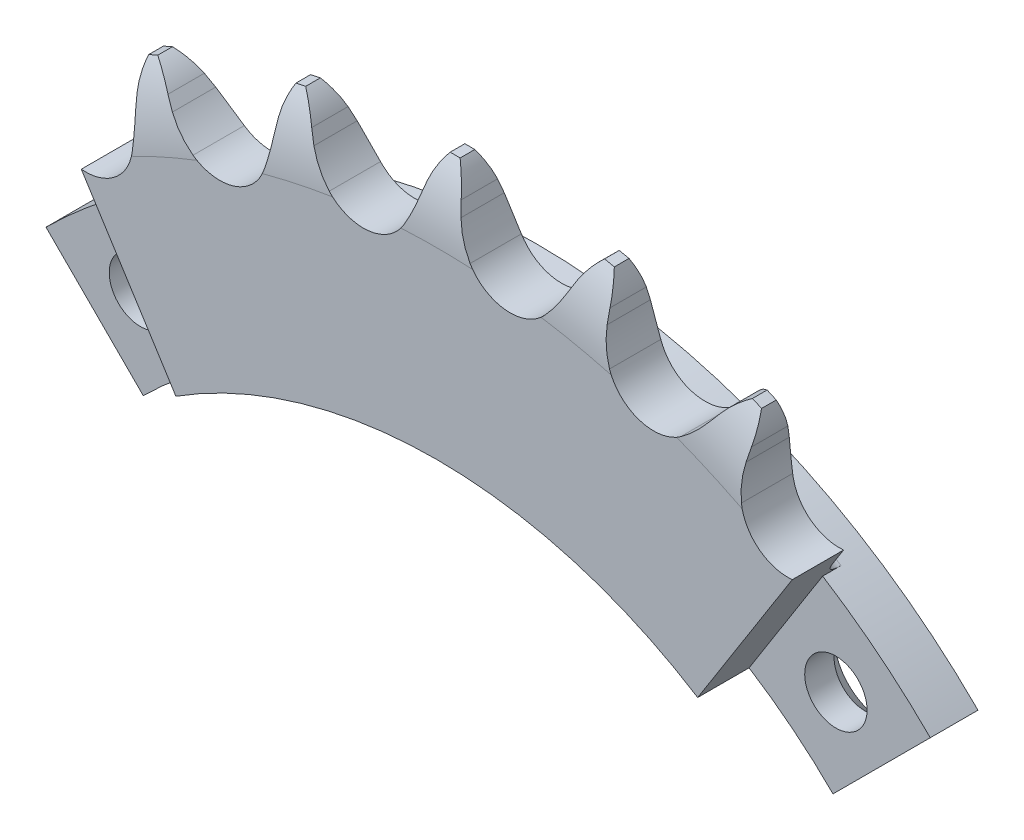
ISO-10303-21;
HEADER;
FILE_DESCRIPTION(('STEP AP214'),'2;1');
FILE_NAME('part.step','',(''),(''),'','','');
FILE_SCHEMA(('AUTOMOTIVE_DESIGN { 1 0 10303 214 1 1 1 1 }'));
ENDSEC;
DATA;
#1=APPLICATION_CONTEXT('core data for automotive mechanical design processes');
#2=APPLICATION_PROTOCOL_DEFINITION('international standard','automotive_design',2000,#1);
#3=PRODUCT_CONTEXT('',#1,'mechanical');
#4=PRODUCT('Part','Part','',(#3));
#5=PRODUCT_RELATED_PRODUCT_CATEGORY('part','',(#4));
#6=PRODUCT_DEFINITION_FORMATION('','',#4);
#7=PRODUCT_DEFINITION_CONTEXT('part definition',#1,'design');
#8=PRODUCT_DEFINITION('design','',#6,#7);
#9=PRODUCT_DEFINITION_SHAPE('','',#8);
#10=(LENGTH_UNIT() NAMED_UNIT(*) SI_UNIT(.MILLI.,.METRE.));
#11=(NAMED_UNIT(*) PLANE_ANGLE_UNIT() SI_UNIT($,.RADIAN.));
#12=(NAMED_UNIT(*) SI_UNIT($,.STERADIAN.) SOLID_ANGLE_UNIT());
#13=UNCERTAINTY_MEASURE_WITH_UNIT(LENGTH_MEASURE(1.E-05),#10,'distance_accuracy_value','');
#14=(GEOMETRIC_REPRESENTATION_CONTEXT(3) GLOBAL_UNCERTAINTY_ASSIGNED_CONTEXT((#13)) GLOBAL_UNIT_ASSIGNED_CONTEXT((#10,
#11,#12)) REPRESENTATION_CONTEXT('',''));
#15=CARTESIAN_POINT('',(0.,0.,0.));
#16=DIRECTION('',(0.,0.,1.));
#17=DIRECTION('',(1.,0.,0.));
#18=AXIS2_PLACEMENT_3D('',#15,#16,#17);
#19=CARTESIAN_POINT('',(-2.55468019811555E-13,-36.5844744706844,-1.40000000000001));
#20=DIRECTION('',(0.,0.,-1.));
#21=DIRECTION('',(0.,1.,0.));
#22=AXIS2_PLACEMENT_3D('',#19,#20,#21);
#23=PLANE('',#22);
#24=DIRECTION('',(0.534985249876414,0.844861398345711,0.));
#25=VECTOR('',#24,1.);
#26=CARTESIAN_POINT('',(-16.5357575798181,-26.1136606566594,-1.4));
#27=LINE('',#26,#25);
#28=CARTESIAN_POINT('',(18.7696763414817,29.6415181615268,-1.4));
#29=VERTEX_POINT('',#28);
#30=CARTESIAN_POINT('',(19.3774709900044,30.6013618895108,-1.40000000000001));
#31=VERTEX_POINT('',#30);
#32=EDGE_CURVE('E523',#29,#31,#27,.T.);
#33=ORIENTED_EDGE('',*,*,#32,.F.);
#34=CARTESIAN_POINT('',(0.,0.,-1.4));
#35=DIRECTION('',(0.,0.,-1.));
#36=DIRECTION('',(0.,1.,0.));
#37=AXIS2_PLACEMENT_3D('',#34,#35,#36);
#38=CIRCLE('',#37,35.0844744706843);
#39=CARTESIAN_POINT('',(-18.7696763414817,29.6415181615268,-1.4));
#40=VERTEX_POINT('',#39);
#41=EDGE_CURVE('E124',#29,#40,#38,.F.);
#42=ORIENTED_EDGE('',*,*,#41,.T.);
#43=DIRECTION('',(0.534985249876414,-0.844861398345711,0.));
#44=VECTOR('',#43,1.);
#45=CARTESIAN_POINT('',(16.535757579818,-26.1136606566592,-1.4));
#46=LINE('',#45,#44);
#47=CARTESIAN_POINT('',(-19.3774709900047,30.6013618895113,-1.4));
#48=VERTEX_POINT('',#47);
#49=EDGE_CURVE('E530',#48,#40,#46,.T.);
#50=ORIENTED_EDGE('',*,*,#49,.F.);
#51=CARTESIAN_POINT('',(-19.1335444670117,33.1402711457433,-1.4));
#52=DIRECTION('',(0.,0.,1.));
#53=DIRECTION('',(-0.913545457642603,-0.406736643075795,0.));
#54=AXIS2_PLACEMENT_3D('',#51,#52,#53);
#55=CIRCLE('',#54,2.55059999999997);
#56=CARTESIAN_POINT('',(-16.6456186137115,32.5783233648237,-1.4));
#57=VERTEX_POINT('',#56);
#58=EDGE_CURVE('E616',#48,#57,#55,.T.);
#59=ORIENTED_EDGE('',*,*,#58,.T.);
#60=CARTESIAN_POINT('',(0.,0.,-1.4));
#61=DIRECTION('',(0.,0.,-1.));
#62=DIRECTION('',(0.,1.,0.));
#63=AXIS2_PLACEMENT_3D('',#60,#61,#62);
#64=CIRCLE('',#63,36.5844744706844);
#65=CARTESIAN_POINT('',(-13.0723195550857,34.1692586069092,-1.4));
#66=VERTEX_POINT('',#65);
#67=EDGE_CURVE('E1056',#57,#66,#64,.T.);
#68=ORIENTED_EDGE('',*,*,#67,.T.);
#69=CARTESIAN_POINT('',(-11.8251808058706,36.3941642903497,-1.4));
#70=DIRECTION('',(0.,0.,1.));
#71=DIRECTION('',(-0.978147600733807,-0.207911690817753,0.));
#72=AXIS2_PLACEMENT_3D('',#69,#70,#71);
#73=CIRCLE('',#72,2.55059999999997);
#74=CARTESIAN_POINT('',(-9.50845761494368,35.3272275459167,-1.4));
#75=VERTEX_POINT('',#74);
#76=EDGE_CURVE('E595',#66,#75,#73,.T.);
#77=ORIENTED_EDGE('',*,*,#76,.T.);
#78=CARTESIAN_POINT('',(-5.68246967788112,36.1404663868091,-1.4));
#79=VERTEX_POINT('',#78);
#80=EDGE_CURVE('E1061',#75,#79,#64,.T.);
#81=ORIENTED_EDGE('',*,*,#80,.T.);
#82=CARTESIAN_POINT('',(-4.00000000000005,38.0574578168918,-1.4));
#83=DIRECTION('',(0.,0.,1.));
#84=DIRECTION('',(-1.,0.,0.));
#85=AXIS2_PLACEMENT_3D('',#82,#83,#84);
#86=CIRCLE('',#85,2.55059999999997);
#87=CARTESIAN_POINT('',(-1.95573139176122,36.5321623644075,-1.4));
#88=VERTEX_POINT('',#87);
#89=EDGE_CURVE('E574',#79,#88,#86,.T.);
#90=ORIENTED_EDGE('',*,*,#89,.T.);
#91=CARTESIAN_POINT('',(1.95573139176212,36.5321623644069,-1.4));
#92=VERTEX_POINT('',#91);
#93=EDGE_CURVE('E1577',#88,#92,#64,.T.);
#94=ORIENTED_EDGE('',*,*,#93,.T.);
#95=CARTESIAN_POINT('',(4.00000000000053,38.0574578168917,-1.4));
#96=DIRECTION('',(0.,0.,1.));
#97=DIRECTION('',(-0.978147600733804,0.207911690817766,0.));
#98=AXIS2_PLACEMENT_3D('',#95,#96,#97);
#99=CIRCLE('',#98,2.55059999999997);
#100=CARTESIAN_POINT('',(5.68246967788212,36.1404663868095,-1.4));
#101=VERTEX_POINT('',#100);
#102=EDGE_CURVE('E553',#92,#101,#99,.T.);
#103=ORIENTED_EDGE('',*,*,#102,.T.);
#104=CARTESIAN_POINT('',(9.50845761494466,35.3272275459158,-1.4));
#105=VERTEX_POINT('',#104);
#106=EDGE_CURVE('E1385',#101,#105,#64,.T.);
#107=ORIENTED_EDGE('',*,*,#106,.T.);
#108=CARTESIAN_POINT('',(11.8251808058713,36.3941642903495,-1.4));
#109=DIRECTION('',(0.,0.,1.));
#110=DIRECTION('',(-0.913545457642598,0.406736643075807,0.));
#111=AXIS2_PLACEMENT_3D('',#108,#109,#110);
#112=CIRCLE('',#111,2.55059999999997);
#113=CARTESIAN_POINT('',(13.072319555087,34.1692586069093,-1.4));
#114=VERTEX_POINT('',#113);
#115=EDGE_CURVE('E541',#105,#114,#112,.T.);
#116=ORIENTED_EDGE('',*,*,#115,.T.);
#117=CARTESIAN_POINT('',(16.6456186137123,32.5783233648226,-1.4));
#118=VERTEX_POINT('',#117);
#119=EDGE_CURVE('E1063',#114,#118,#64,.T.);
#120=ORIENTED_EDGE('',*,*,#119,.T.);
#121=CARTESIAN_POINT('',(19.1335444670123,33.1402711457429,-1.4));
#122=DIRECTION('',(0.,0.,1.));
#123=DIRECTION('',(-0.809016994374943,0.58778525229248,0.));
#124=AXIS2_PLACEMENT_3D('',#121,#122,#123);
#125=CIRCLE('',#124,2.55059999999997);
#126=EDGE_CURVE('E534',#118,#31,#125,.T.);
#127=ORIENTED_EDGE('',*,*,#126,.T.);
#128=EDGE_LOOP('',(#33,#42,#50,#59,#68,#77,#81,#90,#94,#103,#107,#116,#120,#127));
#129=FACE_BOUND('',#128,.T.);
#130=ADVANCED_FACE('F102',(#129),#23,.T.);
#131=CARTESIAN_POINT('',(0.,0.,1.39999999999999));
#132=DIRECTION('',(0.,0.,1.));
#133=DIRECTION('',(0.,-1.,0.));
#134=AXIS2_PLACEMENT_3D('',#131,#132,#133);
#135=PLANE('',#134);
#136=DIRECTION('',(-0.534985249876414,0.844861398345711,0.));
#137=VECTOR('',#136,1.);
#138=CARTESIAN_POINT('',(0.,0.,1.39999999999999));
#139=LINE('',#138,#137);
#140=CARTESIAN_POINT('',(-14.2223017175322,22.4601962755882,1.39999999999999));
#141=VERTEX_POINT('',#140);
#142=CARTESIAN_POINT('',(-19.3774709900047,30.6013618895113,1.4));
#143=VERTEX_POINT('',#142);
#144=EDGE_CURVE('E528',#141,#143,#139,.T.);
#145=ORIENTED_EDGE('',*,*,#144,.F.);
#146=CARTESIAN_POINT('',(0.,0.,1.39999999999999));
#147=DIRECTION('',(0.,0.,1.));
#148=DIRECTION('',(1.,0.,0.));
#149=AXIS2_PLACEMENT_3D('',#146,#147,#148);
#150=CIRCLE('',#149,26.5844744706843);
#151=CARTESIAN_POINT('',(14.2223017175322,22.4601962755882,1.39999999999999));
#152=VERTEX_POINT('',#151);
#153=EDGE_CURVE('E532',#152,#141,#150,.T.);
#154=ORIENTED_EDGE('',*,*,#153,.F.);
#155=DIRECTION('',(-0.534985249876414,-0.844861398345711,0.));
#156=VECTOR('',#155,1.);
#157=CARTESIAN_POINT('',(0.,0.,1.39999999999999));
#158=LINE('',#157,#156);
#159=CARTESIAN_POINT('',(19.3774709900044,30.6013618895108,1.4));
#160=VERTEX_POINT('',#159);
#161=EDGE_CURVE('E515',#160,#152,#158,.T.);
#162=ORIENTED_EDGE('',*,*,#161,.F.);
#163=CARTESIAN_POINT('',(19.1335444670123,33.1402711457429,1.4));
#164=DIRECTION('',(0.,0.,1.));
#165=DIRECTION('',(0.,-1.,0.));
#166=AXIS2_PLACEMENT_3D('',#163,#164,#165);
#167=CIRCLE('',#166,2.55059999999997);
#168=CARTESIAN_POINT('',(16.6456186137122,32.5783233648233,1.4));
#169=VERTEX_POINT('',#168);
#170=EDGE_CURVE('E1052',#169,#160,#167,.T.);
#171=ORIENTED_EDGE('',*,*,#170,.F.);
#172=CARTESIAN_POINT('',(0.,0.,1.39999999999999));
#173=DIRECTION('',(0.,0.,-1.));
#174=DIRECTION('',(0.,1.,0.));
#175=AXIS2_PLACEMENT_3D('',#172,#173,#174);
#176=CIRCLE('',#175,36.5844744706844);
#177=CARTESIAN_POINT('',(13.072319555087,34.1692586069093,1.40000000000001));
#178=VERTEX_POINT('',#177);
#179=EDGE_CURVE('E1370',#178,#169,#176,.T.);
#180=ORIENTED_EDGE('',*,*,#179,.F.);
#181=CARTESIAN_POINT('',(11.8251808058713,36.3941642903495,1.4));
#182=DIRECTION('',(0.,0.,1.));
#183=DIRECTION('',(0.,-1.,0.));
#184=AXIS2_PLACEMENT_3D('',#181,#182,#183);
#185=CIRCLE('',#184,2.55059999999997);
#186=CARTESIAN_POINT('',(9.50845761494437,35.3272275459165,1.4));
#187=VERTEX_POINT('',#186);
#188=EDGE_CURVE('E1055',#187,#178,#185,.T.);
#189=ORIENTED_EDGE('',*,*,#188,.F.);
#190=CARTESIAN_POINT('',(5.68246967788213,36.1404663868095,1.40000000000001));
#191=VERTEX_POINT('',#190);
#192=EDGE_CURVE('E1467',#191,#187,#176,.T.);
#193=ORIENTED_EDGE('',*,*,#192,.F.);
#194=CARTESIAN_POINT('',(4.00000000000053,38.0574578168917,1.4));
#195=DIRECTION('',(0.,0.,1.));
#196=DIRECTION('',(0.,-1.,0.));
#197=AXIS2_PLACEMENT_3D('',#194,#195,#196);
#198=CIRCLE('',#197,2.55059999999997);
#199=CARTESIAN_POINT('',(1.95573139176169,36.5321623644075,1.4));
#200=VERTEX_POINT('',#199);
#201=EDGE_CURVE('E1058',#200,#191,#198,.T.);
#202=ORIENTED_EDGE('',*,*,#201,.F.);
#203=CARTESIAN_POINT('',(-1.95573139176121,36.5321623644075,1.40000000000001));
#204=VERTEX_POINT('',#203);
#205=EDGE_CURVE('E1470',#204,#200,#176,.T.);
#206=ORIENTED_EDGE('',*,*,#205,.F.);
#207=CARTESIAN_POINT('',(-4.00000000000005,38.0574578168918,1.4));
#208=DIRECTION('',(0.,0.,1.));
#209=DIRECTION('',(0.,-1.,0.));
#210=AXIS2_PLACEMENT_3D('',#207,#208,#209);
#211=CIRCLE('',#210,2.55059999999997);
#212=CARTESIAN_POINT('',(-5.68246967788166,36.1404663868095,1.4));
#213=VERTEX_POINT('',#212);
#214=EDGE_CURVE('E1067',#213,#204,#211,.T.);
#215=ORIENTED_EDGE('',*,*,#214,.F.);
#216=CARTESIAN_POINT('',(-9.50845761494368,35.3272275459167,1.40000000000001));
#217=VERTEX_POINT('',#216);
#218=EDGE_CURVE('E1472',#217,#213,#176,.T.);
#219=ORIENTED_EDGE('',*,*,#218,.F.);
#220=CARTESIAN_POINT('',(-11.8251808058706,36.3941642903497,1.4));
#221=DIRECTION('',(0.,0.,1.));
#222=DIRECTION('',(0.,-1.,0.));
#223=AXIS2_PLACEMENT_3D('',#220,#221,#222);
#224=CIRCLE('',#223,2.55059999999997);
#225=CARTESIAN_POINT('',(-13.0723195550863,34.1692586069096,1.4));
#226=VERTEX_POINT('',#225);
#227=EDGE_CURVE('E1069',#226,#217,#224,.T.);
#228=ORIENTED_EDGE('',*,*,#227,.F.);
#229=CARTESIAN_POINT('',(-16.6456186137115,32.5783233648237,1.40000000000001));
#230=VERTEX_POINT('',#229);
#231=EDGE_CURVE('E1368',#230,#226,#176,.T.);
#232=ORIENTED_EDGE('',*,*,#231,.F.);
#233=CARTESIAN_POINT('',(-19.1335444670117,33.1402711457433,1.4));
#234=DIRECTION('',(0.,0.,1.));
#235=DIRECTION('',(0.,-1.,0.));
#236=AXIS2_PLACEMENT_3D('',#233,#234,#235);
#237=CIRCLE('',#236,2.55059999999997);
#238=EDGE_CURVE('E1041',#143,#230,#237,.T.);
#239=ORIENTED_EDGE('',*,*,#238,.F.);
#240=EDGE_LOOP('',(#145,#154,#162,#171,#180,#189,#193,#202,#206,#215,#219,#228,#232,#239));
#241=FACE_BOUND('',#240,.T.);
#242=ADVANCED_FACE('F707',(#241),#135,.T.);
#243=CARTESIAN_POINT('',(0.,0.,6.6));
#244=DIRECTION('',(0.,0.,-1.));
#245=DIRECTION('',(0.,1.,0.));
#246=AXIS2_PLACEMENT_3D('',#243,#244,#245);
#247=TOROIDAL_SURFACE('',#246,36.5844744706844,8.);
#248=CARTESIAN_POINT('',(-16.7038425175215,36.8485655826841,-0.399799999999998));
#249=CARTESIAN_POINT('',(-16.7302377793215,36.7270131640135,-0.455042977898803));
#250=CARTESIAN_POINT('',(-16.7511373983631,36.6038390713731,-0.509431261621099));
#251=CARTESIAN_POINT('',(-16.7814125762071,36.3560176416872,-0.615164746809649));
#252=CARTESIAN_POINT('',(-16.7908815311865,36.2313907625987,-0.666531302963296));
#253=CARTESIAN_POINT('',(-16.7982100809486,35.9803889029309,-0.765833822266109));
#254=CARTESIAN_POINT('',(-16.7960677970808,35.8540136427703,-0.813769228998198));
#255=CARTESIAN_POINT('',(-16.779716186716,35.5994484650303,-0.90574963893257));
#256=CARTESIAN_POINT('',(-16.7654069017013,35.471252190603,-0.949759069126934));
#257=CARTESIAN_POINT('',(-16.744800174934,35.3431627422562,-0.991172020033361));
#258=B_SPLINE_CURVE_WITH_KNOTS('',3,(#248,#249,#250,#251,#252,#253,#254,#255,#256,#257),
.UNSPECIFIED.,.F.,.F.,(4,2,2,2,4),(0.,0.408231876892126,0.81310514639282,1.2180439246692,
1.6263420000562),.UNSPECIFIED.);
#259=CARTESIAN_POINT('',(-16.7039380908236,36.8481253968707,-0.399999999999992));
#260=VERTEX_POINT('',#259);
#261=CARTESIAN_POINT('',(-16.7448323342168,35.3433627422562,-0.991107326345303));
#262=VERTEX_POINT('',#261);
#263=EDGE_CURVE('E715',#260,#262,#258,.T.);
#264=ORIENTED_EDGE('',*,*,#263,.F.);
#265=CARTESIAN_POINT('',(0.,0.,-0.399999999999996));
#266=DIRECTION('',(0.,0.,-1.));
#267=DIRECTION('',(0.,1.,0.));
#268=AXIS2_PLACEMENT_3D('',#265,#266,#267);
#269=CIRCLE('',#268,40.4574578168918);
#270=CARTESIAN_POINT('',(-16.2063774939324,37.0696536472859,-0.399999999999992));
#271=VERTEX_POINT('',#270);
#272=EDGE_CURVE('E1374',#260,#271,#269,.T.);
#273=ORIENTED_EDGE('',*,*,#272,.T.);
#274=CARTESIAN_POINT('',(-15.0605961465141,36.0929612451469,-0.991189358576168));
#275=CARTESIAN_POINT('',(-15.1419982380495,36.1939884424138,-0.949775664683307));
#276=CARTESIAN_POINT('',(-15.2276939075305,36.2904069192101,-0.905765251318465));
#277=CARTESIAN_POINT('',(-15.4059360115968,36.472904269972,-0.813782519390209));
#278=CARTESIAN_POINT('',(-15.4984202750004,36.5590616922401,-0.765845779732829));
#279=CARTESIAN_POINT('',(-15.6898604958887,36.7215755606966,-0.666540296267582));
#280=CARTESIAN_POINT('',(-15.7888154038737,36.7979335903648,-0.615172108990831));
#281=CARTESIAN_POINT('',(-15.9932474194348,36.9412653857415,-0.509435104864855));
#282=CARTESIAN_POINT('',(-16.098771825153,37.0081560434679,-0.455044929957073));
#283=CARTESIAN_POINT('',(-16.2067685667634,37.0698771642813,-0.399800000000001));
#284=B_SPLINE_CURVE_WITH_KNOTS('',3,(#274,#275,#276,#277,#278,#279,#280,#281,#282,#283),
.UNSPECIFIED.,.F.,.F.,(4,2,2,2,4),(0.,0.408312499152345,0.813265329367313,1.21815264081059,
1.62639893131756),.UNSPECIFIED.);
#285=CARTESIAN_POINT('',(-15.0607573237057,36.0931612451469,-0.991107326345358));
#286=VERTEX_POINT('',#285);
#287=EDGE_CURVE('E930',#286,#271,#284,.T.);
#288=ORIENTED_EDGE('',*,*,#287,.F.);
#289=CARTESIAN_POINT('',(-14.6310657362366,35.5600042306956,-1.178888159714));
#290=CARTESIAN_POINT('',(-14.7035221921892,35.6499074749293,-1.15230970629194));
#291=CARTESIAN_POINT('',(-14.7755714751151,35.7393055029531,-1.12336524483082));
#292=CARTESIAN_POINT('',(-14.9188557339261,35.9170911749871,-1.06074428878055));
#293=CARTESIAN_POINT('',(-14.9900907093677,36.005478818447,-1.02706779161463));
#294=CARTESIAN_POINT('',(-15.0609185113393,36.0933612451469,-0.991025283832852));
#295=B_SPLINE_CURVE_WITH_KNOTS('',3,(#289,#290,#291,#292,#293,#294),.UNSPECIFIED.,.F.,.F.,(4,2,
4),(0.,0.355229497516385,0.710459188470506),.UNSPECIFIED.);
#296=CARTESIAN_POINT('',(-14.6312269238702,35.5602042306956,-1.1788290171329));
#297=VERTEX_POINT('',#296);
#298=EDGE_CURVE('E938',#297,#286,#295,.T.);
#299=ORIENTED_EDGE('',*,*,#298,.F.);
#300=CARTESIAN_POINT('',(-13.2879448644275,34.3046950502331,-1.39740213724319));
#301=CARTESIAN_POINT('',(-13.4154439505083,34.393928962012,-1.39413262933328));
#302=CARTESIAN_POINT('',(-13.5396999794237,34.4877322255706,-1.38758904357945));
#303=CARTESIAN_POINT('',(-13.7799711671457,34.682864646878,-1.36724874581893));
#304=CARTESIAN_POINT('',(-13.8960411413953,34.784132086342,-1.35350679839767));
#305=CARTESIAN_POINT('',(-14.12013467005,34.9939562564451,-1.31803679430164));
#306=CARTESIAN_POINT('',(-14.2281573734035,35.1025137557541,-1.29630789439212));
#307=CARTESIAN_POINT('',(-14.4362278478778,35.3266328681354,-1.244196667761));
#308=CARTESIAN_POINT('',(-14.5362091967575,35.4422412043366,-1.21375019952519));
#309=CARTESIAN_POINT('',(-14.6313881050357,35.5604042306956,-1.17876986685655));
#310=B_SPLINE_CURVE_WITH_KNOTS('',3,(#300,#301,#302,#303,#304,#305,#306,#307,#308,#309),
.UNSPECIFIED.,.F.,.F.,(4,2,2,2,4),(0.,0.466888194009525,0.930274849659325,1.39371044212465,
1.8606475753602),.UNSPECIFIED.);
#311=CARTESIAN_POINT('',(-13.2881448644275,34.3048350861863,-1.39739696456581));
#312=VERTEX_POINT('',#311);
#313=EDGE_CURVE('E946',#312,#297,#310,.T.);
#314=ORIENTED_EDGE('',*,*,#313,.F.);
#315=CARTESIAN_POINT('',(-9.4134722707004,35.5639701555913,-1.39739247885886));
#316=CARTESIAN_POINT('',(-9.43667699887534,35.4965366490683,-1.39890902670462));
#317=CARTESIAN_POINT('',(-9.4627267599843,35.4300748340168,-1.39971567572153));
#318=CARTESIAN_POINT('',(-9.52029376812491,35.2995724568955,-1.40015705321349));
#319=CARTESIAN_POINT('',(-9.55181001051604,35.2355314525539,-1.39979199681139));
#320=CARTESIAN_POINT('',(-9.6200614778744,35.1103869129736,-1.39813905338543));
#321=CARTESIAN_POINT('',(-9.65679138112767,35.0492804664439,-1.39685210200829));
#322=CARTESIAN_POINT('',(-9.73521173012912,34.9303786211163,-1.39361859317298));
#323=CARTESIAN_POINT('',(-9.77690229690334,34.8725833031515,-1.39167201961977));
#324=CARTESIAN_POINT('',(-9.90899753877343,34.7047796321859,-1.38523802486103));
#325=CARTESIAN_POINT('',(-10.0064892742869,34.6002373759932,-1.38015385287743));
#326=CARTESIAN_POINT('',(-10.2174836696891,34.408924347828,-1.37036309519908));
#327=CARTESIAN_POINT('',(-10.3309848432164,34.3221519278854,-1.36565647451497));
#328=CARTESIAN_POINT('',(-10.5718296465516,34.1681274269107,-1.35811497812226));
#329=CARTESIAN_POINT('',(-10.6992703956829,34.10102608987,-1.3552943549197));
#330=CARTESIAN_POINT('',(-10.963648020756,33.9891846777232,-1.35244535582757));
#331=CARTESIAN_POINT('',(-11.100585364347,33.9444457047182,-1.3524171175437));
#332=CARTESIAN_POINT('',(-11.3790949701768,33.8788302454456,-1.35515190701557));
#333=CARTESIAN_POINT('',(-11.52063158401,33.8578015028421,-1.35789690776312));
#334=CARTESIAN_POINT('',(-11.8052078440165,33.839660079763,-1.36532291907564));
#335=CARTESIAN_POINT('',(-11.9482478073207,33.8425525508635,-1.3700043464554));
#336=CARTESIAN_POINT('',(-12.2323193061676,33.8722049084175,-1.37980556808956));
#337=CARTESIAN_POINT('',(-12.3733417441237,33.8990507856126,-1.38492688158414));
#338=CARTESIAN_POINT('',(-12.64886621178,33.9760019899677,-1.3936058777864));
#339=CARTESIAN_POINT('',(-12.7833750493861,34.0260824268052,-1.39716522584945));
#340=CARTESIAN_POINT('',(-12.9782830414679,34.1179396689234,-1.39975522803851));
#341=CARTESIAN_POINT('',(-13.0425665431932,34.1516666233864,-1.40015272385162));
#342=CARTESIAN_POINT('',(-13.1679294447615,34.2244115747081,-1.39973985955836));
#343=CARTESIAN_POINT('',(-13.2290136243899,34.2634213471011,-1.39893135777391));
#344=CARTESIAN_POINT('',(-13.2883448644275,34.3049751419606,-1.3973917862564));
#345=B_SPLINE_CURVE_WITH_KNOTS('',3,(#315,#316,#317,#318,#319,#320,#321,#322,#323,#324,#325,
#326,#327,#328,#329,#330,#331,#332,#333,#334,#335,#336,#337,#338,#339,#340,#341,#342,#343,#344),
.UNSPECIFIED.,.F.,.F.,(4,2,2,2,2,2,2,2,2,2,2,2,2,2,4),(0.,0.213912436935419,0.427785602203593,
0.64144201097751,0.855103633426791,1.28203452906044,1.70892581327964,2.13900772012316,
2.56911082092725,2.99643597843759,3.42385316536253,3.85281094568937,4.28131025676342,
4.49885654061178,4.71606795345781),.UNSPECIFIED.);
#346=EDGE_CURVE('E755',#66,#312,#345,.T.);
#347=ORIENTED_EDGE('',*,*,#346,.F.);
#348=ORIENTED_EDGE('',*,*,#67,.F.);
#349=CARTESIAN_POINT('',(-16.6019317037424,32.8296311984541,-1.39739269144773));
#350=CARTESIAN_POINT('',(-16.6106094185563,32.7588467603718,-1.39890917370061));
#351=CARTESIAN_POINT('',(-16.6222720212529,32.6884212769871,-1.39971576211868));
#352=CARTESIAN_POINT('',(-16.6514486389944,32.5488019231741,-1.40015702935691));
#353=CARTESIAN_POINT('',(-16.6689615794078,32.4796078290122,-1.39979192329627));
#354=CARTESIAN_POINT('',(-16.7097031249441,32.343007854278,-1.39813889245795));
#355=CARTESIAN_POINT('',(-16.7329259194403,32.2756002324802,-1.39685190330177));
#356=CARTESIAN_POINT('',(-16.784912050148,32.1429923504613,-1.39361833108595));
#357=CARTESIAN_POINT('',(-16.8136755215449,32.0777921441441,-1.39167173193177));
#358=CARTESIAN_POINT('',(-16.9079966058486,31.8861915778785,-1.38523767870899));
#359=CARTESIAN_POINT('',(-16.9816228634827,31.7636644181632,-1.3801534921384));
#360=CARTESIAN_POINT('',(-17.1482312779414,31.5326644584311,-1.37036274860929));
#361=CARTESIAN_POINT('',(-17.241211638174,31.4241903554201,-1.36565615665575));
#362=CARTESIAN_POINT('',(-17.4447707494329,31.2234580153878,-1.35811474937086));
#363=CARTESIAN_POINT('',(-17.5554758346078,31.1313270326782,-1.35529418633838));
#364=CARTESIAN_POINT('',(-17.7908237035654,30.9669633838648,-1.35244531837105));
#365=CARTESIAN_POINT('',(-17.9154671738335,30.8947316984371,-1.35241715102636));
#366=CARTESIAN_POINT('',(-18.1742489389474,30.7726457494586,-1.35515207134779));
#367=CARTESIAN_POINT('',(-18.308320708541,30.7226499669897,-1.3578971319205));
#368=CARTESIAN_POINT('',(-18.5829067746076,30.64573936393,-1.36532323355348));
#369=CARTESIAN_POINT('',(-18.7234224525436,30.6188295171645,-1.37000469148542));
#370=CARTESIAN_POINT('',(-19.0074515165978,30.5887732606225,-1.37980593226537));
#371=CARTESIAN_POINT('',(-19.1509738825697,30.5857128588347,-1.38492723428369));
#372=CARTESIAN_POINT('',(-19.4364764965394,30.6036989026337,-1.39360615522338));
#373=CARTESIAN_POINT('',(-19.5784582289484,30.6247195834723,-1.39716543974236));
#374=CARTESIAN_POINT('',(-19.78819895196,30.6740453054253,-1.39975523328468));
#375=CARTESIAN_POINT('',(-19.8580839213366,30.6936682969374,-1.40015268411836));
#376=CARTESIAN_POINT('',(-19.9958201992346,30.7387548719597,-1.39973994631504));
#377=CARTESIAN_POINT('',(-20.0636744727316,30.7642094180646,-1.39893161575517));
#378=CARTESIAN_POINT('',(-20.1303432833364,30.7925163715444,-1.39739235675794));
#379=B_SPLINE_CURVE_WITH_KNOTS('',3,(#349,#350,#351,#352,#353,#354,#355,#356,#357,#358,#359,
#360,#361,#362,#363,#364,#365,#366,#367,#368,#369,#370,#371,#372,#373,#374,#375,#376,#377,#378),
.UNSPECIFIED.,.F.,.F.,(4,2,2,2,2,2,2,2,2,2,2,2,2,2,4),(0.,0.213912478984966,0.427785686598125,
0.64144214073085,0.855103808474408,1.28203479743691,1.70892617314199,2.13900807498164,
2.56911116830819,2.99643629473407,3.4238534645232,3.8528113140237,4.28131064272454,
4.49883828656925,4.71603107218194),.UNSPECIFIED.);
#380=CARTESIAN_POINT('',(-16.6019562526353,32.8294311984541,-1.39739696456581));
#381=VERTEX_POINT('',#380);
#382=EDGE_CURVE('E764',#381,#57,#379,.T.);
#383=ORIENTED_EDGE('',*,*,#382,.F.);
#384=CARTESIAN_POINT('',(-16.6362121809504,34.6677415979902,-1.17878237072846));
#385=CARTESIAN_POINT('',(-16.6120895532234,34.5179509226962,-1.21375977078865));
#386=CARTESIAN_POINT('',(-16.5930783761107,34.3663010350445,-1.24420380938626));
#387=CARTESIAN_POINT('',(-16.5657545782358,34.0617253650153,-1.29631115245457));
#388=CARTESIAN_POINT('',(-16.5573628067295,33.9088176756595,-1.31803858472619));
#389=CARTESIAN_POINT('',(-16.5513815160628,33.6019000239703,-1.35350650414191));
#390=CARTESIAN_POINT('',(-16.5537908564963,33.4478901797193,-1.36724783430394));
#391=CARTESIAN_POINT('',(-16.5695503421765,33.1387811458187,-1.38758761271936));
#392=CARTESIAN_POINT('',(-16.58298301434,32.9836825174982,-1.39413130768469));
#393=CARTESIAN_POINT('',(-16.60198081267,32.8292311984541,-1.39740123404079));
#394=B_SPLINE_CURVE_WITH_KNOTS('',3,(#384,#385,#386,#387,#388,#389,#390,#391,#392,#393),
.UNSPECIFIED.,.F.,.F.,(4,2,2,2,4),(0.,0.466912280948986,0.930323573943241,1.39368594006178,
1.8605492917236),.UNSPECIFIED.);
#395=CARTESIAN_POINT('',(-16.6361800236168,34.6675415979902,-1.17882901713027));
#396=VERTEX_POINT('',#395);
#397=EDGE_CURVE('E977',#396,#381,#394,.T.);
#398=ORIENTED_EDGE('',*,*,#397,.F.);
#399=CARTESIAN_POINT('',(-16.7448644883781,35.3435627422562,-0.991042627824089));
#400=CARTESIAN_POINT('',(-16.7269509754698,35.2321400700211,-1.02707866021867));
#401=CARTESIAN_POINT('',(-16.7089344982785,35.1200769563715,-1.06074943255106));
#402=CARTESIAN_POINT('',(-16.6726956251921,34.8946699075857,-1.12336044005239));
#403=CARTESIAN_POINT('',(-16.6544732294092,34.7813259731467,-1.15230067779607));
#404=CARTESIAN_POINT('',(-16.6361478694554,34.6673415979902,-1.1788756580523));
#405=B_SPLINE_CURVE_WITH_KNOTS('',3,(#399,#400,#401,#402,#403,#404),.UNSPECIFIED.,.F.,.F.,(4,2,
4),(0.,0.355173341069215,0.710346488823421),.UNSPECIFIED.);
#406=EDGE_CURVE('E983',#262,#396,#405,.T.);
#407=ORIENTED_EDGE('',*,*,#406,.F.);
#408=EDGE_LOOP('',(#264,#273,#288,#299,#314,#347,#348,#383,#398,#407));
#409=FACE_BOUND('',#408,.T.);
#410=ADVANCED_FACE('F702',(#409),#247,.T.);
#411=CARTESIAN_POINT('',(-8.67757590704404,39.5162601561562,-0.399799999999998));
#412=CARTESIAN_POINT('',(-8.72866646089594,39.4028520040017,-0.455042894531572));
#413=CARTESIAN_POINT('',(-8.77471864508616,39.2867150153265,-0.509431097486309));
#414=CARTESIAN_POINT('',(-8.85585712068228,39.0506040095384,-0.615164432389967));
#415=CARTESIAN_POINT('',(-8.89103051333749,38.9306694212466,-0.666530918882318));
#416=CARTESIAN_POINT('',(-8.95038511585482,38.6866766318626,-0.765833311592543));
#417=CARTESIAN_POINT('',(-8.97456454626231,38.5626177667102,-0.813768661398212));
#418=CARTESIAN_POINT('',(-9.01149738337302,38.3102161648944,-0.905748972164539));
#419=CARTESIAN_POINT('',(-9.02415433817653,38.1818464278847,-0.949758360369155));
#420=CARTESIAN_POINT('',(-9.03062927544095,38.0522718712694,-0.991171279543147));
#421=B_SPLINE_CURVE_WITH_KNOTS('',3,(#411,#412,#413,#414,#415,#416,#417,#418,#419,#420),
.UNSPECIFIED.,.F.,.F.,(4,2,2,2,4),(0.,0.408231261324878,0.813103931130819,1.21804210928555,
1.62633956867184),.UNSPECIFIED.);
#422=CARTESIAN_POINT('',(-8.67776091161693,39.5158494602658,-0.399999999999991));
#423=VERTEX_POINT('',#422);
#424=CARTESIAN_POINT('',(-9.0306192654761,38.0524718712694,-0.991107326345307));
#425=VERTEX_POINT('',#424);
#426=EDGE_CURVE('E970',#423,#425,#421,.T.);
#427=ORIENTED_EDGE('',*,*,#426,.F.);
#428=CARTESIAN_POINT('',(-8.14501489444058,39.6290881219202,-0.399999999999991));
#429=VERTEX_POINT('',#428);
#430=EDGE_CURVE('E1381',#423,#429,#269,.T.);
#431=ORIENTED_EDGE('',*,*,#430,.T.);
#432=CARTESIAN_POINT('',(-7.2273521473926,38.4355465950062,-0.991178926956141));
#433=CARTESIAN_POINT('',(-7.2859702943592,38.5512874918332,-0.949765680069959));
#434=CARTESIAN_POINT('',(-7.34974614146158,38.6634131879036,-0.905755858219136));
#435=CARTESIAN_POINT('',(-7.48614819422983,38.8789756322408,-0.813774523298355));
#436=CARTESIAN_POINT('',(-7.55869726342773,38.9824762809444,-0.765838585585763));
#437=CARTESIAN_POINT('',(-7.71216302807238,39.1812366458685,-0.666534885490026));
#438=CARTESIAN_POINT('',(-7.79307836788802,39.2764976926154,-0.615167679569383));
#439=CARTESIAN_POINT('',(-7.96323943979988,39.4591969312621,-0.509432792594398));
#440=CARTESIAN_POINT('',(-8.05254870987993,39.5465636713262,-0.455043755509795));
#441=CARTESIAN_POINT('',(-8.14535094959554,39.6293880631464,-0.399800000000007));
#442=B_SPLINE_CURVE_WITH_KNOTS('',3,(#432,#433,#434,#435,#436,#437,#438,#439,#440,#441),
.UNSPECIFIED.,.F.,.F.,(4,2,2,2,4),(0.,0.408303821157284,0.813248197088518,1.21812706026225,
1.62636467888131),.UNSPECIFIED.);
#443=CARTESIAN_POINT('',(-7.22745345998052,38.4357465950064,-0.991107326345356));
#444=VERTEX_POINT('',#443);
#445=EDGE_CURVE('E880',#444,#429,#442,.T.);
#446=ORIENTED_EDGE('',*,*,#445,.F.);
#447=CARTESIAN_POINT('',(-6.91801600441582,37.8249315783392,-1.17888063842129));
#448=CARTESIAN_POINT('',(-6.97019214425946,37.9279248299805,-1.15230427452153));
#449=CARTESIAN_POINT('',(-7.02207510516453,38.0303393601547,-1.12336235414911));
#450=CARTESIAN_POINT('',(-7.12525469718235,38.2340110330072,-1.06074738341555));
#451=CARTESIAN_POINT('',(-7.1765513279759,38.3352681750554,-1.02707433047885));
#452=CARTESIAN_POINT('',(-7.22755477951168,38.4359465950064,-0.991035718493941));
#453=B_SPLINE_CURVE_WITH_KNOTS('',3,(#447,#448,#449,#450,#451,#452),.UNSPECIFIED.,.F.,.F.,(4,2,
4),(0.,0.355195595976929,0.710391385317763),.UNSPECIFIED.);
#454=CARTESIAN_POINT('',(-6.91811732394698,37.8251315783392,-1.17882901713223));
#455=VERTEX_POINT('',#454);
#456=EDGE_CURVE('E888',#455,#444,#453,.T.);
#457=ORIENTED_EDGE('',*,*,#456,.F.);
#458=CARTESIAN_POINT('',(-5.86520424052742,36.3177527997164,-1.39740275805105));
#459=CARTESIAN_POINT('',(-5.97136466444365,36.431544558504,-1.3941336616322));
#460=CARTESIAN_POINT('',(-6.07340292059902,36.5491315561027,-1.38759053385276));
#461=CARTESIAN_POINT('',(-6.26785401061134,36.7899536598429,-1.36725123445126));
#462=CARTESIAN_POINT('',(-6.36033329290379,36.913139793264,-1.35350982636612));
#463=CARTESIAN_POINT('',(-6.5359058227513,37.1649691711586,-1.31804097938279));
#464=CARTESIAN_POINT('',(-6.61899807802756,37.2936129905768,-1.29631269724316));
#465=CARTESIAN_POINT('',(-6.77592576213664,37.5560936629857,-1.24420277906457));
#466=CARTESIAN_POINT('',(-6.84968650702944,37.6899624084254,-1.21375700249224));
#467=CARTESIAN_POINT('',(-6.91821863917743,37.8253315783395,-1.17877738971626));
#468=B_SPLINE_CURVE_WITH_KNOTS('',3,(#458,#459,#460,#461,#462,#463,#464,#465,#466,#467),
.UNSPECIFIED.,.F.,.F.,(4,2,2,2,4),(0.,0.466887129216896,0.930272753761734,1.39370731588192,
1.86064338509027),.UNSPECIFIED.);
#469=CARTESIAN_POINT('',(-5.86539075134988,36.3179527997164,-1.39739696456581));
#470=VERTEX_POINT('',#469);
#471=EDGE_CURVE('E896',#470,#455,#468,.T.);
#472=ORIENTED_EDGE('',*,*,#471,.F.);
#473=CARTESIAN_POINT('',(-1.81358892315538,36.7440017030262,-1.39739201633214));
#474=CARTESIAN_POINT('',(-1.8503062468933,36.6828660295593,-1.39890870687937));
#475=CARTESIAN_POINT('',(-1.88960441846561,36.6232723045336,-1.39971548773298));
#476=CARTESIAN_POINT('',(-1.97304538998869,36.5075899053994,-1.40015710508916));
#477=CARTESIAN_POINT('',(-2.01718729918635,36.451500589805,-1.39979215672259));
#478=CARTESIAN_POINT('',(-2.10996534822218,36.3432802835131,-1.3981394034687));
#479=CARTESIAN_POINT('',(-2.15859688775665,36.2911453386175,-1.39685253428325));
#480=CARTESIAN_POINT('',(-2.26002373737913,36.1911454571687,-1.39361916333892));
#481=CARTESIAN_POINT('',(-2.3128191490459,36.1432806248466,-1.3916726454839));
#482=CARTESIAN_POINT('',(-2.4769148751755,36.0066066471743,-1.38523877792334));
#483=CARTESIAN_POINT('',(-2.59401096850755,35.9246175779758,-1.38015463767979));
#484=CARTESIAN_POINT('',(-2.84016947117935,35.7813513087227,-1.37036384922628));
#485=CARTESIAN_POINT('',(-2.96923076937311,35.7200721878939,-1.36565716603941));
#486=CARTESIAN_POINT('',(-3.23683507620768,35.6194855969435,-1.35811547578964));
#487=CARTESIAN_POINT('',(-3.37544174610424,35.5803457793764,-1.35529472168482));
#488=CARTESIAN_POINT('',(-3.65729474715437,35.5259130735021,-1.35244543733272));
#489=CARTESIAN_POINT('',(-3.80054130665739,35.5106213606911,-1.35241704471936));
#490=CARTESIAN_POINT('',(-4.0866070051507,35.5043426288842,-1.35515154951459));
#491=CARTESIAN_POINT('',(-4.22942292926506,35.5131992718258,-1.35789642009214));
#492=CARTESIAN_POINT('',(-4.51155273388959,35.5546185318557,-1.36532223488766));
#493=CARTESIAN_POINT('',(-4.6508658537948,35.5871862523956,-1.37000359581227));
#494=CARTESIAN_POINT('',(-4.92256538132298,35.6752500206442,-1.37980477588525));
#495=CARTESIAN_POINT('',(-5.05492501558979,35.7308282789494,-1.38492611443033));
#496=CARTESIAN_POINT('',(-5.30843066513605,35.8633803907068,-1.39360527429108));
#497=CARTESIAN_POINT('',(-5.42958851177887,35.9403313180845,-1.39716476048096));
#498=CARTESIAN_POINT('',(-5.60114978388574,36.0707106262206,-1.39975519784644));
#499=CARTESIAN_POINT('',(-5.65702562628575,36.1170734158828,-1.40015279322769));
#500=CARTESIAN_POINT('',(-5.76454175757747,36.2143097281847,-1.39973971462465));
#501=CARTESIAN_POINT('',(-5.81618843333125,36.2651761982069,-1.39893089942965));
#502=CARTESIAN_POINT('',(-5.86559075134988,36.3181672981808,-1.39739074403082));
#503=B_SPLINE_CURVE_WITH_KNOTS('',3,(#473,#474,#475,#476,#477,#478,#479,#480,#481,#482,#483,
#484,#485,#486,#487,#488,#489,#490,#491,#492,#493,#494,#495,#496,#497,#498,#499,#500,#501,#502),
.UNSPECIFIED.,.F.,.F.,(4,2,2,2,2,2,2,2,2,2,2,2,2,2,4),(0.,0.213912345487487,0.427785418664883,
0.641441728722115,0.855103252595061,1.28203394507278,1.70892503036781,2.13900694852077,
2.56911006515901,2.99643528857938,3.42385251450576,3.85281015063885,4.28130941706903,
4.49889156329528,4.71613881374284),.UNSPECIFIED.);
#504=EDGE_CURVE('E746',#79,#470,#503,.T.);
#505=ORIENTED_EDGE('',*,*,#504,.F.);
#506=ORIENTED_EDGE('',*,*,#80,.F.);
#507=CARTESIAN_POINT('',(-9.41354112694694,35.5637701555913,-1.39739696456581));
#508=VERTEX_POINT('',#507);
#509=EDGE_CURVE('E1537',#508,#75,#345,.T.);
#510=ORIENTED_EDGE('',*,*,#509,.F.);
#511=CARTESIAN_POINT('',(-9.06484237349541,37.3690289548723,-1.17878290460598));
#512=CARTESIAN_POINT('',(-9.07239020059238,37.2174955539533,-1.21376040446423));
#513=CARTESIAN_POINT('',(-9.08532437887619,37.0652062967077,-1.24420450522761));
#514=CARTESIAN_POINT('',(-9.12192286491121,36.7616041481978,-1.29631190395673));
#515=CARTESIAN_POINT('',(-9.14550598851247,36.6102924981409,-1.31803933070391));
#516=CARTESIAN_POINT('',(-9.20346769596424,36.3088369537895,-1.35350718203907));
#517=CARTESIAN_POINT('',(-9.23784513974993,36.1586929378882,-1.36724844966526));
#518=CARTESIAN_POINT('',(-9.31752832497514,35.8596141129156,-1.38758805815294));
#519=CARTESIAN_POINT('',(-9.36291467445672,35.710697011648,-1.39413164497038));
#520=CARTESIAN_POINT('',(-9.41360999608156,35.5635701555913,-1.3974014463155));
#521=B_SPLINE_CURVE_WITH_KNOTS('',3,(#511,#512,#513,#514,#515,#516,#517,#518,#519,#520),
.UNSPECIFIED.,.F.,.F.,(4,2,2,2,4),(0.,0.466914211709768,0.930327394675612,1.39369164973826,
1.86055693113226),.UNSPECIFIED.);
#522=CARTESIAN_POINT('',(-9.06485238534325,37.3688289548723,-1.17882901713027));
#523=VERTEX_POINT('',#522);
#524=EDGE_CURVE('E954',#523,#508,#521,.T.);
#525=ORIENTED_EDGE('',*,*,#524,.F.);
#526=CARTESIAN_POINT('',(-9.03060925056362,38.0526718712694,-0.991043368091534));
#527=CARTESIAN_POINT('',(-9.03625322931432,37.939960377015,-1.02707912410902));
#528=CARTESIAN_POINT('',(-9.04192964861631,37.8266010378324,-1.06074965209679));
#529=CARTESIAN_POINT('',(-9.05334736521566,37.5985867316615,-1.12336023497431));
#530=CARTESIAN_POINT('',(-9.05908866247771,37.4839317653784,-1.15230029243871));
#531=CARTESIAN_POINT('',(-9.06486240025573,37.3686289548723,-1.17887512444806));
#532=B_SPLINE_CURVE_WITH_KNOTS('',3,(#526,#527,#528,#529,#530,#531),.UNSPECIFIED.,.F.,.F.,(4,2,
4),(0.,0.355170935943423,0.710341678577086),.UNSPECIFIED.);
#533=EDGE_CURVE('E962',#425,#523,#532,.T.);
#534=ORIENTED_EDGE('',*,*,#533,.F.);
#535=EDGE_LOOP('',(#427,#431,#446,#457,#472,#505,#506,#510,#525,#534));
#536=FACE_BOUND('',#535,.T.);
#537=ADVANCED_FACE('F706',(#536),#247,.T.);
#538=CARTESIAN_POINT('',(-0.272057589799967,40.4569045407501,-0.399799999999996));
#539=CARTESIAN_POINT('',(-0.345610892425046,40.3565965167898,-0.455043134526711));
#540=CARTESIAN_POINT('',(-0.414803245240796,40.2525717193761,-0.509431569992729));
#541=CARTESIAN_POINT('',(-0.543259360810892,40.0384889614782,-0.615165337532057));
#542=CARTESIAN_POINT('',(-0.602600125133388,39.928487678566,-0.666532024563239));
#543=CARTESIAN_POINT('',(-0.711386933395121,39.7021661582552,-0.765834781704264));
#544=CARTESIAN_POINT('',(-0.760831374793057,39.5858449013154,-0.813770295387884));
#545=CARTESIAN_POINT('',(-0.849434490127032,39.3466364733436,-0.90575089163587));
#546=CARTESIAN_POINT('',(-0.888504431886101,39.2237028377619,-0.949760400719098));
#547=CARTESIAN_POINT('',(-0.921777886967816,39.0983053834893,-0.991173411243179));
#548=B_SPLINE_CURVE_WITH_KNOTS('',3,(#538,#539,#540,#541,#542,#543,#544,#545,#546,#547),
.UNSPECIFIED.,.F.,.F.,(4,2,2,2,4),(0.,0.408233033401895,0.813107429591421,1.21804733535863,
1.62634656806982),.UNSPECIFIED.);
#549=CARTESIAN_POINT('',(-0.272323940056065,40.4565412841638,-0.399999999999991));
#550=VERTEX_POINT('',#549);
#551=CARTESIAN_POINT('',(-0.921724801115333,39.0985053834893,-0.991107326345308));
#552=VERTEX_POINT('',#551);
#553=EDGE_CURVE('E921',#550,#552,#548,.T.);
#554=ORIENTED_EDGE('',*,*,#553,.F.);
#555=CARTESIAN_POINT('',(0.272323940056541,40.4565412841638,-0.399999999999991));
#556=VERTEX_POINT('',#555);
#557=EDGE_CURVE('E1378',#550,#556,#269,.T.);
#558=ORIENTED_EDGE('',*,*,#557,.T.);
#559=CARTESIAN_POINT('',(0.921777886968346,39.0983053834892,-0.991173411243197));
#560=CARTESIAN_POINT('',(0.888504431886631,39.2237028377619,-0.949760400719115));
#561=CARTESIAN_POINT('',(0.849434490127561,39.3466364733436,-0.905750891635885));
#562=CARTESIAN_POINT('',(0.760831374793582,39.5858449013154,-0.813770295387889));
#563=CARTESIAN_POINT('',(0.711386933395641,39.7021661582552,-0.765834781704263));
#564=CARTESIAN_POINT('',(0.602600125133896,39.9284876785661,-0.666532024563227));
#565=CARTESIAN_POINT('',(0.543259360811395,40.0384889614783,-0.615165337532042));
#566=CARTESIAN_POINT('',(0.414803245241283,40.2525717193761,-0.509431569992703));
#567=CARTESIAN_POINT('',(0.345610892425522,40.3565965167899,-0.455043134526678));
#568=CARTESIAN_POINT('',(0.272057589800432,40.4569045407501,-0.399799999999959));
#569=B_SPLINE_CURVE_WITH_KNOTS('',3,(#559,#560,#561,#562,#563,#564,#565,#566,#567,#568),
.UNSPECIFIED.,.F.,.F.,(4,2,2,2,4),(0.,0.408299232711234,0.813239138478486,1.21811353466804,
1.62634656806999),.UNSPECIFIED.);
#570=CARTESIAN_POINT('',(0.921724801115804,39.0985053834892,-0.991107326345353));
#571=VERTEX_POINT('',#570);
#572=EDGE_CURVE('E830',#571,#556,#569,.T.);
#573=ORIENTED_EDGE('',*,*,#572,.F.);
#574=CARTESIAN_POINT('',(1.09740029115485,38.4367191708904,-1.1788766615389));
#575=CARTESIAN_POINT('',(1.06777933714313,38.5483041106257,-1.15230140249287));
#576=CARTESIAN_POINT('',(1.0383248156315,38.6592620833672,-1.12336082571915));
#577=CARTESIAN_POINT('',(0.979748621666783,38.879924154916,-1.06074901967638));
#578=CARTESIAN_POINT('',(0.950626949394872,38.9896282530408,-1.02707778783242));
#579=CARTESIAN_POINT('',(0.921671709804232,39.0987053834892,-0.991041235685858));
#580=B_SPLINE_CURVE_WITH_KNOTS('',3,(#574,#575,#576,#577,#578,#579),.UNSPECIFIED.,.F.,.F.,(4,2,
4),(0.,0.355177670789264,0.710355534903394),.UNSPECIFIED.);
#581=CARTESIAN_POINT('',(1.09734719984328,38.4369191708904,-1.17882901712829));
#582=VERTEX_POINT('',#581);
#583=EDGE_CURVE('E838',#582,#571,#580,.T.);
#584=ORIENTED_EDGE('',*,*,#583,.F.);
#585=CARTESIAN_POINT('',(1.81382925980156,36.7436017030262,-1.39740190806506));
#586=CARTESIAN_POINT('',(1.73365066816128,36.8769751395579,-1.39413235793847));
#587=CARTESIAN_POINT('',(1.65829295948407,37.0132036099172,-1.38758894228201));
#588=CARTESIAN_POINT('',(1.51816627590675,37.2891837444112,-1.36724947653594));
#589=CARTESIAN_POINT('',(1.45332213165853,37.428901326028,-1.35350818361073));
#590=CARTESIAN_POINT('',(1.33394873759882,37.7117226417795,-1.31804004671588));
#591=CARTESIAN_POINT('',(1.27942057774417,37.8548267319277,-1.29631235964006));
#592=CARTESIAN_POINT('',(1.18049787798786,38.1441896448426,-1.24420417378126));
#593=CARTESIAN_POINT('',(1.13618301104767,38.2904641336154,-1.21375954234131));
#594=CARTESIAN_POINT('',(1.09729411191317,38.4371191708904,-1.17878136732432));
#595=B_SPLINE_CURVE_WITH_KNOTS('',3,(#585,#586,#587,#588,#589,#590,#591,#592,#593,#594),
.UNSPECIFIED.,.F.,.F.,(4,2,2,2,4),(0.,0.46687251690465,0.930243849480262,1.39366411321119,
1.86058556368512),.UNSPECIFIED.);
#596=CARTESIAN_POINT('',(1.81370908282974,36.7438017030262,-1.39739696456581));
#597=VERTEX_POINT('',#596);
#598=EDGE_CURVE('E846',#597,#582,#595,.T.);
#599=ORIENTED_EDGE('',*,*,#598,.F.);
#600=CARTESIAN_POINT('',(5.8655907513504,36.3181672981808,-1.39739074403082));
#601=CARTESIAN_POINT('',(5.81696625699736,36.2660004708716,-1.39890782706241));
#602=CARTESIAN_POINT('',(5.7661378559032,36.215878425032,-1.39971497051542));
#603=CARTESIAN_POINT('',(5.66047093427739,36.1200699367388,-1.40015724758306));
#604=CARTESIAN_POINT('',(5.60563315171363,36.0743826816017,-1.39979259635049));
#605=CARTESIAN_POINT('',(5.4923844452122,35.9878143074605,-1.39814036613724));
#606=CARTESIAN_POINT('',(5.43397719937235,35.9469283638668,-1.39685372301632));
#607=CARTESIAN_POINT('',(5.31397759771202,35.8701987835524,-1.39362073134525));
#608=CARTESIAN_POINT('',(5.25238516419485,35.8343552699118,-1.39167436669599));
#609=CARTESIAN_POINT('',(5.06346182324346,35.7347809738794,-1.385240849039));
#610=CARTESIAN_POINT('',(4.93187958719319,35.6789261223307,-1.38015679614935));
#611=CARTESIAN_POINT('',(4.66131600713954,35.5899633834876,-1.37036592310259));
#612=CARTESIAN_POINT('',(4.52233535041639,35.5568533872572,-1.3656590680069));
#613=CARTESIAN_POINT('',(4.23966693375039,35.5140960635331,-1.35811684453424));
#614=CARTESIAN_POINT('',(4.09595175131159,35.5046259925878,-1.35529573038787));
#615=CARTESIAN_POINT('',(3.80894057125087,35.509976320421,-1.35244566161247));
#616=CARTESIAN_POINT('',(3.66564459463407,35.5247979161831,-1.35241684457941));
#617=CARTESIAN_POINT('',(3.38452333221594,35.578125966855,-1.35515056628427));
#618=CARTESIAN_POINT('',(3.24666869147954,35.6164788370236,-1.35789507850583));
#619=CARTESIAN_POINT('',(2.97931313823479,35.7156446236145,-1.36532035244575));
#620=CARTESIAN_POINT('',(2.84981403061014,35.7764623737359,-1.37000153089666));
#621=CARTESIAN_POINT('',(2.60235785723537,35.919085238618,-1.37980259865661));
#622=CARTESIAN_POINT('',(2.4844440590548,36.0009651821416,-1.3849240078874));
#623=CARTESIAN_POINT('',(2.26403296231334,36.1833220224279,-1.39360361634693));
#624=CARTESIAN_POINT('',(2.16151932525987,36.2837789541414,-1.39716348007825));
#625=CARTESIAN_POINT('',(2.02081028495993,36.44697554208,-1.39975472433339));
#626=CARTESIAN_POINT('',(1.97579321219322,36.5039416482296,-1.40015262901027));
#627=CARTESIAN_POINT('',(1.89083986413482,36.6214055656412,-1.39974022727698));
#628=CARTESIAN_POINT('',(1.85089587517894,36.6818978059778,-1.39893177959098));
#629=CARTESIAN_POINT('',(1.81358892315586,36.7440017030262,-1.39739201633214));
#630=B_SPLINE_CURVE_WITH_KNOTS('',3,(#600,#601,#602,#603,#604,#605,#606,#607,#608,#609,#610,
#611,#612,#613,#614,#615,#616,#617,#618,#619,#620,#621,#622,#623,#624,#625,#626,#627,#628,#629),
.UNSPECIFIED.,.F.,.F.,(4,2,2,2,2,2,2,2,2,2,2,2,2,2,4),(0.,0.213912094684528,0.427784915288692,
0.641440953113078,0.855102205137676,1.28203233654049,1.70892287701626,2.13900483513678,
2.56910798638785,2.99643335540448,3.4238507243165,3.85280809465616,4.28130710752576,
4.4988904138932,4.71613881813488),.UNSPECIFIED.);
#631=EDGE_CURVE('E737',#92,#597,#630,.T.);
#632=ORIENTED_EDGE('',*,*,#631,.F.);
#633=ORIENTED_EDGE('',*,*,#93,.F.);
#634=CARTESIAN_POINT('',(-1.81370908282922,36.7438017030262,-1.39739696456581));
#635=VERTEX_POINT('',#634);
#636=EDGE_CURVE('E1529',#635,#88,#503,.T.);
#637=ORIENTED_EDGE('',*,*,#636,.F.);
#638=CARTESIAN_POINT('',(-1.09729411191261,38.4371191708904,-1.17878136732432));
#639=CARTESIAN_POINT('',(-1.1361830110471,38.2904641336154,-1.21375954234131));
#640=CARTESIAN_POINT('',(-1.1804978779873,38.1441896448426,-1.24420417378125));
#641=CARTESIAN_POINT('',(-1.27942057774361,37.8548267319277,-1.29631235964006));
#642=CARTESIAN_POINT('',(-1.33394873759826,37.7117226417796,-1.31804004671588));
#643=CARTESIAN_POINT('',(-1.45332213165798,37.4289013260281,-1.35350818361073));
#644=CARTESIAN_POINT('',(-1.51816627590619,37.2891837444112,-1.36724947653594));
#645=CARTESIAN_POINT('',(-1.65829295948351,37.0132036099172,-1.387588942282));
#646=CARTESIAN_POINT('',(-1.73365066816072,36.876975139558,-1.39413235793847));
#647=CARTESIAN_POINT('',(-1.813829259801,36.7436017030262,-1.39740190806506));
#648=B_SPLINE_CURVE_WITH_KNOTS('',3,(#638,#639,#640,#641,#642,#643,#644,#645,#646,#647),
.UNSPECIFIED.,.F.,.F.,(4,2,2,2,4),(0.,0.466921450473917,0.93034171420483,1.39371304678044,
1.86058556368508),.UNSPECIFIED.);
#649=CARTESIAN_POINT('',(-1.09734719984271,38.4369191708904,-1.17882901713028));
#650=VERTEX_POINT('',#649);
#651=EDGE_CURVE('E904',#650,#635,#648,.T.);
#652=ORIENTED_EDGE('',*,*,#651,.F.);
#653=CARTESIAN_POINT('',(-0.92167170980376,39.0987053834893,-0.991041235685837));
#654=CARTESIAN_POINT('',(-0.950626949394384,38.9896282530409,-1.02707778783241));
#655=CARTESIAN_POINT('',(-0.97974862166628,38.879924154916,-1.06074901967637));
#656=CARTESIAN_POINT('',(-1.03832481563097,38.6592620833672,-1.12336082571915));
#657=CARTESIAN_POINT('',(-1.06777933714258,38.5483041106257,-1.15230140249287));
#658=CARTESIAN_POINT('',(-1.09740029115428,38.4367191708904,-1.1788766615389));
#659=B_SPLINE_CURVE_WITH_KNOTS('',3,(#653,#654,#655,#656,#657,#658),.UNSPECIFIED.,.F.,.F.,(4,2,
4),(0.,0.355177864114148,0.710355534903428),.UNSPECIFIED.);
#660=EDGE_CURVE('E912',#552,#650,#659,.T.);
#661=ORIENTED_EDGE('',*,*,#660,.F.);
#662=EDGE_LOOP('',(#554,#558,#573,#584,#599,#632,#633,#637,#652,#661));
#663=FACE_BOUND('',#662,.T.);
#664=ADVANCED_FACE('F1389',(#663),#247,.T.);
#665=CARTESIAN_POINT('',(8.14535094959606,39.6293880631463,-0.399799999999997));
#666=CARTESIAN_POINT('',(8.05254870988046,39.5465636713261,-0.455043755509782));
#667=CARTESIAN_POINT('',(7.96323943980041,39.459196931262,-0.509432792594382));
#668=CARTESIAN_POINT('',(7.79307836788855,39.2764976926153,-0.615167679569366));
#669=CARTESIAN_POINT('',(7.71216302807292,39.1812366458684,-0.666534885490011));
#670=CARTESIAN_POINT('',(7.55869726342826,38.9824762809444,-0.765838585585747));
#671=CARTESIAN_POINT('',(7.48614819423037,38.8789756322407,-0.813774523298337));
#672=CARTESIAN_POINT('',(7.34974614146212,38.6634131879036,-0.905755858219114));
#673=CARTESIAN_POINT('',(7.28597029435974,38.5512874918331,-0.949765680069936));
#674=CARTESIAN_POINT('',(7.22735214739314,38.4355465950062,-0.991178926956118));
#675=B_SPLINE_CURVE_WITH_KNOTS('',3,(#665,#666,#667,#668,#669,#670,#671,#672,#673,#674),
.UNSPECIFIED.,.F.,.F.,(4,2,2,2,4),(0.,0.408237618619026,0.813116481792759,1.21806085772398,
1.62636467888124),.UNSPECIFIED.);
#676=CARTESIAN_POINT('',(8.14501489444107,39.6290881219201,-0.399999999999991));
#677=VERTEX_POINT('',#676);
#678=CARTESIAN_POINT('',(7.227453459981,38.4357465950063,-0.991107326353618));
#679=VERTEX_POINT('',#678);
#680=EDGE_CURVE('E871',#677,#679,#675,.T.);
#681=ORIENTED_EDGE('',*,*,#680,.F.);
#682=CARTESIAN_POINT('',(8.67776091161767,39.5158494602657,-0.399999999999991));
#683=VERTEX_POINT('',#682);
#684=EDGE_CURVE('E1373',#677,#683,#269,.T.);
#685=ORIENTED_EDGE('',*,*,#684,.T.);
#686=CARTESIAN_POINT('',(9.0306292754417,38.0522718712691,-0.991171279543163));
#687=CARTESIAN_POINT('',(9.02415433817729,38.1818464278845,-0.949758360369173));
#688=CARTESIAN_POINT('',(9.01149738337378,38.3102161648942,-0.905748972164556));
#689=CARTESIAN_POINT('',(8.97456454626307,38.56261776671,-0.813768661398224));
#690=CARTESIAN_POINT('',(8.95038511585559,38.6866766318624,-0.765833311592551));
#691=CARTESIAN_POINT('',(8.89103051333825,38.9306694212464,-0.666530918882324));
#692=CARTESIAN_POINT('',(8.85585712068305,39.0506040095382,-0.615164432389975));
#693=CARTESIAN_POINT('',(8.77471864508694,39.2867150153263,-0.509431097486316));
#694=CARTESIAN_POINT('',(8.72866646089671,39.4028520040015,-0.455042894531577));
#695=CARTESIAN_POINT('',(8.67757590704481,39.516260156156,-0.399799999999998));
#696=B_SPLINE_CURVE_WITH_KNOTS('',3,(#686,#687,#688,#689,#690,#691,#692,#693,#694,#695),
.UNSPECIFIED.,.F.,.F.,(4,2,2,2,4),(0.,0.408297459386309,0.813235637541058,1.218108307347,
1.62633956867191),.UNSPECIFIED.);
#697=CARTESIAN_POINT('',(9.03061926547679,38.0524718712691,-0.991107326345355));
#698=VERTEX_POINT('',#697);
#699=EDGE_CURVE('E780',#698,#683,#696,.T.);
#700=ORIENTED_EDGE('',*,*,#699,.F.);
#701=CARTESIAN_POINT('',(9.06486240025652,37.3686289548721,-1.17887512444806));
#702=CARTESIAN_POINT('',(9.05908866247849,37.4839317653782,-1.15230029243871));
#703=CARTESIAN_POINT('',(9.05334736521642,37.5985867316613,-1.12336023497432));
#704=CARTESIAN_POINT('',(9.04192964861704,37.8266010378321,-1.06074965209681));
#705=CARTESIAN_POINT('',(9.03625322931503,37.9399603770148,-1.02707912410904));
#706=CARTESIAN_POINT('',(9.03060925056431,38.0526718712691,-0.991043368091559));
#707=B_SPLINE_CURVE_WITH_KNOTS('',3,(#701,#702,#703,#704,#705,#706),.UNSPECIFIED.,.F.,.F.,(4,2,
4),(0.,0.355170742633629,0.710341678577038),.UNSPECIFIED.);
#708=CARTESIAN_POINT('',(9.06485238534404,37.3688289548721,-1.17882901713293));
#709=VERTEX_POINT('',#708);
#710=EDGE_CURVE('E788',#709,#698,#707,.T.);
#711=ORIENTED_EDGE('',*,*,#710,.F.);
#712=CARTESIAN_POINT('',(9.41360999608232,35.5635701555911,-1.3974014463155));
#713=CARTESIAN_POINT('',(9.36291467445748,35.7106970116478,-1.39413164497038));
#714=CARTESIAN_POINT('',(9.3175283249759,35.8596141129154,-1.38758805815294));
#715=CARTESIAN_POINT('',(9.2378451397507,36.158692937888,-1.36724844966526));
#716=CARTESIAN_POINT('',(9.20346769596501,36.3088369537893,-1.35350718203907));
#717=CARTESIAN_POINT('',(9.14550598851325,36.6102924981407,-1.31803933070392));
#718=CARTESIAN_POINT('',(9.12192286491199,36.7616041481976,-1.29631190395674));
#719=CARTESIAN_POINT('',(9.08532437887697,37.0652062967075,-1.24420450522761));
#720=CARTESIAN_POINT('',(9.07239020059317,37.2174955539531,-1.21376040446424));
#721=CARTESIAN_POINT('',(9.06484237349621,37.3690289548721,-1.17878290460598));
#722=B_SPLINE_CURVE_WITH_KNOTS('',3,(#712,#713,#714,#715,#716,#717,#718,#719,#720,#721),
.UNSPECIFIED.,.F.,.F.,(4,2,2,2,4),(0.,0.466865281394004,0.930229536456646,1.39364271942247,
1.86055693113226),.UNSPECIFIED.);
#723=CARTESIAN_POINT('',(9.41354112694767,35.5637701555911,-1.39739696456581));
#724=VERTEX_POINT('',#723);
#725=EDGE_CURVE('E796',#724,#709,#722,.T.);
#726=ORIENTED_EDGE('',*,*,#725,.F.);
#727=CARTESIAN_POINT('',(13.2883448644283,34.3049751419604,-1.3973917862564));
#728=CARTESIAN_POINT('',(13.2299359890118,34.2640589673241,-1.39890854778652));
#729=CARTESIAN_POINT('',(13.1697965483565,34.2256011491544,-1.39971539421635));
#730=CARTESIAN_POINT('',(13.0465174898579,34.1538580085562,-1.40015713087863));
#731=CARTESIAN_POINT('',(12.9833784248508,34.1205717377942,-1.3997922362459));
#732=CARTESIAN_POINT('',(12.8546045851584,34.0594432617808,-1.39813957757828));
#733=CARTESIAN_POINT('',(12.7889724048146,34.0315955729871,-1.39685274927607));
#734=CARTESIAN_POINT('',(12.6556409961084,33.9814945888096,-1.39361944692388));
#735=CARTESIAN_POINT('',(12.5879417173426,33.9592414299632,-1.39167295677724));
#736=CARTESIAN_POINT('',(12.3824427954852,33.9011264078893,-1.38523915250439));
#737=CARTESIAN_POINT('',(12.2421223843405,33.8738523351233,-1.38015502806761));
#738=CARTESIAN_POINT('',(11.9589739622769,33.8430925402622,-1.37036422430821));
#739=CARTESIAN_POINT('',(11.8161461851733,33.8396046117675,-1.3656575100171));
#740=CARTESIAN_POINT('',(11.5307651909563,33.8565574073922,-1.35811572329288));
#741=CARTESIAN_POINT('',(11.3882220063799,33.8771771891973,-1.35529490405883));
#742=CARTESIAN_POINT('',(11.1085964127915,33.942089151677,-1.35244547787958));
#743=CARTESIAN_POINT('',(10.9715142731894,33.9863824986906,-1.35241700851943));
#744=CARTESIAN_POINT('',(10.7076259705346,34.0969988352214,-1.35515137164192));
#745=CARTESIAN_POINT('',(10.580759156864,34.1631776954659,-1.35789617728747));
#746=CARTESIAN_POINT('',(10.3398667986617,34.3157675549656,-1.36532189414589));
#747=CARTESIAN_POINT('',(10.2258440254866,34.4021829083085,-1.37000322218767));
#748=CARTESIAN_POINT('',(10.0134520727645,34.5931423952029,-1.37980438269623));
#749=CARTESIAN_POINT('',(9.91514078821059,34.6977507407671,-1.38492573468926));
#750=CARTESIAN_POINT('',(9.73746469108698,34.9219523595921,-1.39360497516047));
#751=CARTESIAN_POINT('',(9.65807974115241,35.0415294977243,-1.39716452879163));
#752=CARTESIAN_POINT('',(9.55438560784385,35.2304063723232,-1.39975497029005));
#753=CARTESIAN_POINT('',(9.52220241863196,35.2954767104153,-1.40015263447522));
#754=CARTESIAN_POINT('',(9.46353821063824,35.4280146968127,-1.39974013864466));
#755=CARTESIAN_POINT('',(9.4370484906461,35.4954785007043,-1.39893183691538));
#756=CARTESIAN_POINT('',(9.4134722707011,35.5639701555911,-1.39739247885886));
#757=B_SPLINE_CURVE_WITH_KNOTS('',3,(#727,#728,#729,#730,#731,#732,#733,#734,#735,#736,#737,
#738,#739,#740,#741,#742,#743,#744,#745,#746,#747,#748,#749,#750,#751,#752,#753,#754,#755,#756),
.UNSPECIFIED.,.F.,.F.,(4,2,2,2,2,2,2,2,2,2,2,2,2,2,4),(0.,0.213912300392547,0.427785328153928,
0.641441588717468,0.855103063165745,1.28203365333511,1.70892464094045,2.13900656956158,
2.56910968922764,2.99643492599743,3.42385219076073,3.85280982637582,4.28130899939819,
4.49885591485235,4.71606795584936),.UNSPECIFIED.);
#758=EDGE_CURVE('E728',#105,#724,#757,.T.);
#759=ORIENTED_EDGE('',*,*,#758,.F.);
#760=ORIENTED_EDGE('',*,*,#106,.F.);
#761=CARTESIAN_POINT('',(5.8653907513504,36.3179527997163,-1.39739696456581));
#762=VERTEX_POINT('',#761);
#763=EDGE_CURVE('E1499',#762,#101,#630,.T.);
#764=ORIENTED_EDGE('',*,*,#763,.F.);
#765=CARTESIAN_POINT('',(6.91821863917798,37.8253315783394,-1.17877738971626));
#766=CARTESIAN_POINT('',(6.84968650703,37.6899624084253,-1.21375700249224));
#767=CARTESIAN_POINT('',(6.77592576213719,37.5560936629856,-1.24420277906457));
#768=CARTESIAN_POINT('',(6.61899807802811,37.2936129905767,-1.29631269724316));
#769=CARTESIAN_POINT('',(6.53590582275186,37.1649691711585,-1.31804097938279));
#770=CARTESIAN_POINT('',(6.36033329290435,36.9131397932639,-1.35350982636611));
#771=CARTESIAN_POINT('',(6.2678540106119,36.7899536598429,-1.36725123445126));
#772=CARTESIAN_POINT('',(6.07340292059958,36.5491315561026,-1.38759053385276));
#773=CARTESIAN_POINT('',(5.97136466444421,36.4315445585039,-1.3941336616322));
#774=CARTESIAN_POINT('',(5.86520424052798,36.3177527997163,-1.39740275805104));
#775=B_SPLINE_CURVE_WITH_KNOTS('',3,(#765,#766,#767,#768,#769,#770,#771,#772,#773,#774),
.UNSPECIFIED.,.F.,.F.,(4,2,2,2,4),(0.,0.466936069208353,0.930370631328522,1.39375625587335,
1.86064338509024),.UNSPECIFIED.);
#776=CARTESIAN_POINT('',(6.91811732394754,37.825131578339,-1.17882901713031));
#777=VERTEX_POINT('',#776);
#778=EDGE_CURVE('E854',#777,#762,#775,.T.);
#779=ORIENTED_EDGE('',*,*,#778,.F.);
#780=CARTESIAN_POINT('',(7.22755477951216,38.4359465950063,-0.991035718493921));
#781=CARTESIAN_POINT('',(7.17655132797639,38.3352681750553,-1.02707433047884));
#782=CARTESIAN_POINT('',(7.12525469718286,38.2340110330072,-1.06074738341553));
#783=CARTESIAN_POINT('',(7.02207510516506,38.0303393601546,-1.1233623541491));
#784=CARTESIAN_POINT('',(6.97019214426,37.9279248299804,-1.15230427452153));
#785=CARTESIAN_POINT('',(6.91801600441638,37.8249315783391,-1.17888063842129));
#786=B_SPLINE_CURVE_WITH_KNOTS('',3,(#780,#781,#782,#783,#784,#785),.UNSPECIFIED.,.F.,.F.,(4,2,
4),(0.,0.355195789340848,0.710391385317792),.UNSPECIFIED.);
#787=EDGE_CURVE('E862',#679,#777,#786,.T.);
#788=ORIENTED_EDGE('',*,*,#787,.F.);
#789=EDGE_LOOP('',(#681,#685,#700,#711,#726,#759,#760,#764,#779,#788));
#790=FACE_BOUND('',#789,.T.);
#791=ADVANCED_FACE('F1559',(#790),#247,.T.);
#792=CARTESIAN_POINT('',(16.2067685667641,37.0698771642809,-0.399800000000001));
#793=CARTESIAN_POINT('',(16.0987718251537,37.0081560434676,-0.45504492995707));
#794=CARTESIAN_POINT('',(15.9932474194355,36.9412653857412,-0.509435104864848));
#795=CARTESIAN_POINT('',(15.7888154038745,36.7979335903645,-0.615172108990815));
#796=CARTESIAN_POINT('',(15.6898604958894,36.7215755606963,-0.666540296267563));
#797=CARTESIAN_POINT('',(15.4984202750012,36.5590616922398,-0.765845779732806));
#798=CARTESIAN_POINT('',(15.4059360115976,36.4729042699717,-0.813782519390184));
#799=CARTESIAN_POINT('',(15.2276939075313,36.2904069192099,-0.905765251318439));
#800=CARTESIAN_POINT('',(15.1419982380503,36.1939884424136,-0.94977566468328));
#801=CARTESIAN_POINT('',(15.0605961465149,36.0929612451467,-0.991189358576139));
#802=B_SPLINE_CURVE_WITH_KNOTS('',3,(#792,#793,#794,#795,#796,#797,#798,#799,#800,#801),
.UNSPECIFIED.,.F.,.F.,(4,2,2,2,4),(0.,0.408246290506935,0.813133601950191,1.21808643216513,
1.62639893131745),.UNSPECIFIED.);
#803=CARTESIAN_POINT('',(16.206377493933,37.0696536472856,-0.399999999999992));
#804=VERTEX_POINT('',#803);
#805=CARTESIAN_POINT('',(15.0607573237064,36.0931612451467,-0.991107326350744));
#806=VERTEX_POINT('',#805);
#807=EDGE_CURVE('E821',#804,#806,#802,.T.);
#808=ORIENTED_EDGE('',*,*,#807,.F.);
#809=CARTESIAN_POINT('',(16.7039380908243,36.8481253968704,-0.399999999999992));
#810=VERTEX_POINT('',#809);
#811=EDGE_CURVE('E1371',#804,#810,#269,.T.);
#812=ORIENTED_EDGE('',*,*,#811,.T.);
#813=CARTESIAN_POINT('',(16.7448001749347,35.3431627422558,-0.991172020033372));
#814=CARTESIAN_POINT('',(16.765406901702,35.4712521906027,-0.949759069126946));
#815=CARTESIAN_POINT('',(16.7797161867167,35.5994484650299,-0.90574963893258));
#816=CARTESIAN_POINT('',(16.7960677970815,35.8540136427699,-0.813769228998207));
#817=CARTESIAN_POINT('',(16.7982100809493,35.9803889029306,-0.765833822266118));
#818=CARTESIAN_POINT('',(16.7908815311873,36.2313907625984,-0.666531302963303));
#819=CARTESIAN_POINT('',(16.7814125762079,36.3560176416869,-0.615164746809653));
#820=CARTESIAN_POINT('',(16.7511373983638,36.6038390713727,-0.509431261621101));
#821=CARTESIAN_POINT('',(16.7302377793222,36.7270131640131,-0.455042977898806));
#822=CARTESIAN_POINT('',(16.7038425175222,36.8485655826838,-0.399800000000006));
#823=B_SPLINE_CURVE_WITH_KNOTS('',3,(#813,#814,#815,#816,#817,#818,#819,#820,#821,#822),
.UNSPECIFIED.,.F.,.F.,(4,2,2,2,4),(0.,0.408298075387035,0.813236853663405,1.21811012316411,
1.62634200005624),.UNSPECIFIED.);
#824=CARTESIAN_POINT('',(16.7448323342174,35.3433627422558,-0.991107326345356));
#825=VERTEX_POINT('',#824);
#826=EDGE_CURVE('E772',#825,#810,#823,.T.);
#827=ORIENTED_EDGE('',*,*,#826,.F.);
#828=CARTESIAN_POINT('',(16.6361478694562,34.6673415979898,-1.1788756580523));
#829=CARTESIAN_POINT('',(16.6544732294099,34.7813259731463,-1.15230067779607));
#830=CARTESIAN_POINT('',(16.6726956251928,34.8946699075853,-1.12336044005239));
#831=CARTESIAN_POINT('',(16.7089344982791,35.1200769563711,-1.06074943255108));
#832=CARTESIAN_POINT('',(16.7269509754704,35.2321400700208,-1.02707866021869));
#833=CARTESIAN_POINT('',(16.7448644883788,35.3435627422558,-0.991042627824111));
#834=B_SPLINE_CURVE_WITH_KNOTS('',3,(#828,#829,#830,#831,#832,#833),.UNSPECIFIED.,.F.,.F.,(4,2,
4),(0.,0.355173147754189,0.710346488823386),.UNSPECIFIED.);
#835=CARTESIAN_POINT('',(16.6361800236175,34.6675415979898,-1.178829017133));
#836=VERTEX_POINT('',#835);
#837=EDGE_CURVE('E695',#836,#825,#834,.T.);
#838=ORIENTED_EDGE('',*,*,#837,.F.);
#839=CARTESIAN_POINT('',(16.6019808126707,32.8292311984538,-1.39740123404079));
#840=CARTESIAN_POINT('',(16.5829830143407,32.9836825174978,-1.39413130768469));
#841=CARTESIAN_POINT('',(16.5695503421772,33.1387811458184,-1.38758761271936));
#842=CARTESIAN_POINT('',(16.553790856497,33.4478901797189,-1.36724783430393));
#843=CARTESIAN_POINT('',(16.5513815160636,33.60190002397,-1.3535065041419));
#844=CARTESIAN_POINT('',(16.5573628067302,33.9088176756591,-1.31803858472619));
#845=CARTESIAN_POINT('',(16.5657545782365,34.0617253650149,-1.29631115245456));
#846=CARTESIAN_POINT('',(16.5930783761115,34.3663010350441,-1.24420380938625));
#847=CARTESIAN_POINT('',(16.6120895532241,34.5179509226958,-1.21375977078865));
#848=CARTESIAN_POINT('',(16.6362121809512,34.6677415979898,-1.17878237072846));
#849=B_SPLINE_CURVE_WITH_KNOTS('',3,(#839,#840,#841,#842,#843,#844,#845,#846,#847,#848),
.UNSPECIFIED.,.F.,.F.,(4,2,2,2,4),(0.,0.466863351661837,0.930225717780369,1.39363701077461,
1.8605492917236),.UNSPECIFIED.);
#850=CARTESIAN_POINT('',(16.601956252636,32.8294311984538,-1.39739696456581));
#851=VERTEX_POINT('',#850);
#852=EDGE_CURVE('E687',#851,#836,#849,.T.);
#853=ORIENTED_EDGE('',*,*,#852,.F.);
#854=CARTESIAN_POINT('',(20.1303432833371,30.7925163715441,-1.39739235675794));
#855=CARTESIAN_POINT('',(20.0647034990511,30.7646388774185,-1.39890894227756));
#856=CARTESIAN_POINT('',(19.9978821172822,30.7395258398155,-1.3997156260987));
#857=CARTESIAN_POINT('',(19.8623802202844,30.6949830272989,-1.40015706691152));
#858=CARTESIAN_POINT('',(19.7937000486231,30.6755522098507,-1.39979203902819));
#859=CARTESIAN_POINT('',(19.6550304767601,30.6425345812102,-1.39813914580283));
#860=CARTESIAN_POINT('',(19.5850424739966,30.6289418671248,-1.39685221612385));
#861=CARTESIAN_POINT('',(19.4442077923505,30.6076583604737,-1.39361874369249));
#862=CARTESIAN_POINT('',(19.373361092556,30.5999677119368,-1.39167218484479));
#863=CARTESIAN_POINT('',(19.160269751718,30.5858505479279,-1.38523822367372));
#864=CARTESIAN_POINT('',(19.0173450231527,30.5883482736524,-1.38015406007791));
#865=CARTESIAN_POINT('',(18.7339888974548,30.6171336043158,-1.37036329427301));
#866=CARTESIAN_POINT('',(18.5935572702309,30.6434190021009,-1.365656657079));
#867=CARTESIAN_POINT('',(18.317937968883,30.7193384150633,-1.35811510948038));
#868=CARTESIAN_POINT('',(18.1827973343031,30.769145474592,-1.35529445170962));
#869=CARTESIAN_POINT('',(17.9227795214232,30.8907792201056,-1.35244537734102));
#870=CARTESIAN_POINT('',(17.7979028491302,30.9626069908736,-1.35241709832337));
#871=CARTESIAN_POINT('',(17.5627813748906,31.1256741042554,-1.35515181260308));
#872=CARTESIAN_POINT('',(17.4524472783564,31.2167850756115,-1.35789677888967));
#873=CARTESIAN_POINT('',(17.2485464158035,31.4161270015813,-1.3653227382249));
#874=CARTESIAN_POINT('',(17.1549832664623,31.5243616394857,-1.37000414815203));
#875=CARTESIAN_POINT('',(16.9869377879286,31.7553088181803,-1.37980535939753));
#876=CARTESIAN_POINT('',(16.9125254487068,31.8780721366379,-1.3849266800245));
#877=CARTESIAN_POINT('',(16.7853488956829,32.1343168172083,-1.39360571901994));
#878=CARTESIAN_POINT('',(16.7325616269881,32.2677865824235,-1.3971651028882));
#879=CARTESIAN_POINT('',(16.6704072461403,32.474089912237,-1.39975510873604));
#880=CARTESIAN_POINT('',(16.6524582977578,32.5444235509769,-1.40015264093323));
#881=CARTESIAN_POINT('',(16.6226353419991,32.6862499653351,-1.3997400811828));
#882=CARTESIAN_POINT('',(16.610752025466,32.7577407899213,-1.39893184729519));
#883=CARTESIAN_POINT('',(16.601931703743,32.8296311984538,-1.39739269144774));
#884=B_SPLINE_CURVE_WITH_KNOTS('',3,(#854,#855,#856,#857,#858,#859,#860,#861,#862,#863,#864,
#865,#866,#867,#868,#869,#870,#871,#872,#873,#874,#875,#876,#877,#878,#879,#880,#881,#882,#883),
.UNSPECIFIED.,.F.,.F.,(4,2,2,2,2,2,2,2,2,2,2,2,2,2,4),(0.,0.21391241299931,0.42778555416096,
0.641441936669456,0.855103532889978,1.28203437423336,1.7089256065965,2.13900751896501,
2.56911062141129,2.99643578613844,3.4238529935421,3.85281077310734,4.28131003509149,
4.49883798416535,4.7160310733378),.UNSPECIFIED.);
#885=EDGE_CURVE('E649',#118,#851,#884,.T.);
#886=ORIENTED_EDGE('',*,*,#885,.F.);
#887=ORIENTED_EDGE('',*,*,#119,.F.);
#888=CARTESIAN_POINT('',(13.2881448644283,34.304835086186,-1.39739696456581));
#889=VERTEX_POINT('',#888);
#890=EDGE_CURVE('E1428',#889,#114,#757,.T.);
#891=ORIENTED_EDGE('',*,*,#890,.F.);
#892=CARTESIAN_POINT('',(14.6313881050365,35.5604042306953,-1.17876986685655));
#893=CARTESIAN_POINT('',(14.5362091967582,35.4422412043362,-1.21375019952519));
#894=CARTESIAN_POINT('',(14.4362278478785,35.3266328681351,-1.244196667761));
#895=CARTESIAN_POINT('',(14.2281573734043,35.1025137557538,-1.29630789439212));
#896=CARTESIAN_POINT('',(14.1201346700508,34.9939562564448,-1.31803679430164));
#897=CARTESIAN_POINT('',(13.896041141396,34.7841320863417,-1.35350679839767));
#898=CARTESIAN_POINT('',(13.7799711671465,34.6828646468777,-1.36724874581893));
#899=CARTESIAN_POINT('',(13.5396999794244,34.4877322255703,-1.38758904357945));
#900=CARTESIAN_POINT('',(13.415443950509,34.3939289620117,-1.39413262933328));
#901=CARTESIAN_POINT('',(13.2879448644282,34.3046950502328,-1.39740213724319));
#902=B_SPLINE_CURVE_WITH_KNOTS('',3,(#892,#893,#894,#895,#896,#897,#898,#899,#900,#901),
.UNSPECIFIED.,.F.,.F.,(4,2,2,2,4),(0.,0.466937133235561,0.930372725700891,1.3937593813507,
1.86064757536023),.UNSPECIFIED.);
#903=CARTESIAN_POINT('',(14.631226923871,35.5602042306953,-1.1788290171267));
#904=VERTEX_POINT('',#903);
#905=EDGE_CURVE('E804',#904,#889,#902,.T.);
#906=ORIENTED_EDGE('',*,*,#905,.F.);
#907=CARTESIAN_POINT('',(15.06091851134,36.0933612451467,-0.991025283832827));
#908=CARTESIAN_POINT('',(14.9900907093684,36.0054788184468,-1.02706779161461));
#909=CARTESIAN_POINT('',(14.9188557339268,35.9170911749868,-1.06074428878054));
#910=CARTESIAN_POINT('',(14.7755714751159,35.7393055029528,-1.12336524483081));
#911=CARTESIAN_POINT('',(14.7035221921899,35.649907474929,-1.15230970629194));
#912=CARTESIAN_POINT('',(14.6310657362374,35.5600042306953,-1.178888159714));
#913=B_SPLINE_CURVE_WITH_KNOTS('',3,(#907,#908,#909,#910,#911,#912),.UNSPECIFIED.,.F.,.F.,(4,2,
4),(0.,0.355229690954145,0.710459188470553),.UNSPECIFIED.);
#914=EDGE_CURVE('E812',#806,#904,#913,.T.);
#915=ORIENTED_EDGE('',*,*,#914,.F.);
#916=EDGE_LOOP('',(#808,#812,#827,#838,#853,#886,#887,#891,#906,#915));
#917=FACE_BOUND('',#916,.T.);
#918=ADVANCED_FACE('F709',(#917),#247,.T.);
#919=CARTESIAN_POINT('',(0.,0.,-1.4));
#920=DIRECTION('',(0.,0.,-1.));
#921=DIRECTION('',(0.,1.,0.));
#922=AXIS2_PLACEMENT_3D('',#919,#920,#921);
#923=CYLINDRICAL_SURFACE('',#922,40.4574578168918);
#924=DIRECTION('',(0.,0.,1.));
#925=VECTOR('',#924,1.);
#926=CARTESIAN_POINT('',(-16.7039380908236,36.8481253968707,0.));
#927=LINE('',#926,#925);
#928=CARTESIAN_POINT('',(-16.7039380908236,36.8481253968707,0.399999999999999));
#929=VERTEX_POINT('',#928);
#930=EDGE_CURVE('E1475',#929,#260,#927,.F.);
#931=ORIENTED_EDGE('',*,*,#930,.F.);
#932=CARTESIAN_POINT('',(0.,0.,0.399999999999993));
#933=DIRECTION('',(0.,0.,-1.));
#934=DIRECTION('',(0.,1.,0.));
#935=AXIS2_PLACEMENT_3D('',#932,#933,#934);
#936=CIRCLE('',#935,40.4574578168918);
#937=CARTESIAN_POINT('',(-16.2063774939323,37.0696536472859,0.399999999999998));
#938=VERTEX_POINT('',#937);
#939=EDGE_CURVE('E1369',#929,#938,#936,.T.);
#940=ORIENTED_EDGE('',*,*,#939,.T.);
#941=DIRECTION('',(0.,0.,1.));
#942=VECTOR('',#941,1.);
#943=CARTESIAN_POINT('',(-16.2063774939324,37.069653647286,0.));
#944=LINE('',#943,#942);
#945=EDGE_CURVE('E1282',#271,#938,#944,.T.);
#946=ORIENTED_EDGE('',*,*,#945,.F.);
#947=ORIENTED_EDGE('',*,*,#272,.F.);
#948=EDGE_LOOP('',(#931,#940,#946,#947));
#949=FACE_BOUND('',#948,.T.);
#950=ADVANCED_FACE('F710',(#949),#923,.T.);
#951=DIRECTION('',(0.,0.,1.));
#952=VECTOR('',#951,1.);
#953=CARTESIAN_POINT('',(-8.67776091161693,39.5158494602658,0.));
#954=LINE('',#953,#952);
#955=CARTESIAN_POINT('',(-8.67776091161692,39.5158494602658,0.399999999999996));
#956=VERTEX_POINT('',#955);
#957=EDGE_CURVE('E1266',#956,#423,#954,.F.);
#958=ORIENTED_EDGE('',*,*,#957,.F.);
#959=CARTESIAN_POINT('',(-8.14501489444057,39.6290881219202,0.399999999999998));
#960=VERTEX_POINT('',#959);
#961=EDGE_CURVE('E1366',#956,#960,#936,.T.);
#962=ORIENTED_EDGE('',*,*,#961,.T.);
#963=DIRECTION('',(0.,0.,1.));
#964=VECTOR('',#963,1.);
#965=CARTESIAN_POINT('',(-8.14501489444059,39.6290881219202,0.));
#966=LINE('',#965,#964);
#967=EDGE_CURVE('E1302',#429,#960,#966,.T.);
#968=ORIENTED_EDGE('',*,*,#967,.F.);
#969=ORIENTED_EDGE('',*,*,#430,.F.);
#970=EDGE_LOOP('',(#958,#962,#968,#969));
#971=FACE_BOUND('',#970,.T.);
#972=ADVANCED_FACE('F1564',(#971),#923,.T.);
#973=DIRECTION('',(0.,0.,1.));
#974=VECTOR('',#973,1.);
#975=CARTESIAN_POINT('',(-0.272323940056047,40.4565412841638,0.));
#976=LINE('',#975,#974);
#977=CARTESIAN_POINT('',(-0.272323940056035,40.4565412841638,0.399999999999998));
#978=VERTEX_POINT('',#977);
#979=EDGE_CURVE('E1286',#978,#550,#976,.F.);
#980=ORIENTED_EDGE('',*,*,#979,.F.);
#981=CARTESIAN_POINT('',(0.272323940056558,40.4565412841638,0.400000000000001));
#982=VERTEX_POINT('',#981);
#983=EDGE_CURVE('E1362',#978,#982,#936,.T.);
#984=ORIENTED_EDGE('',*,*,#983,.T.);
#985=DIRECTION('',(0.,0.,1.));
#986=VECTOR('',#985,1.);
#987=CARTESIAN_POINT('',(0.272323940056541,40.4565412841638,0.));
#988=LINE('',#987,#986);
#989=EDGE_CURVE('E1323',#556,#982,#988,.T.);
#990=ORIENTED_EDGE('',*,*,#989,.F.);
#991=ORIENTED_EDGE('',*,*,#557,.F.);
#992=EDGE_LOOP('',(#980,#984,#990,#991));
#993=FACE_BOUND('',#992,.T.);
#994=ADVANCED_FACE('F1391',(#993),#923,.T.);
#995=DIRECTION('',(0.,0.,1.));
#996=VECTOR('',#995,1.);
#997=CARTESIAN_POINT('',(8.14501489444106,39.6290881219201,0.));
#998=LINE('',#997,#996);
#999=CARTESIAN_POINT('',(8.14501489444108,39.6290881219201,0.399999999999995));
#1000=VERTEX_POINT('',#999);
#1001=EDGE_CURVE('E1307',#1000,#677,#998,.F.);
#1002=ORIENTED_EDGE('',*,*,#1001,.F.);
#1003=CARTESIAN_POINT('',(8.67776091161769,39.5158494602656,0.399999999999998));
#1004=VERTEX_POINT('',#1003);
#1005=EDGE_CURVE('E1358',#1000,#1004,#936,.T.);
#1006=ORIENTED_EDGE('',*,*,#1005,.T.);
#1007=DIRECTION('',(0.,0.,1.));
#1008=VECTOR('',#1007,1.);
#1009=CARTESIAN_POINT('',(8.67776091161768,39.5158494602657,0.));
#1010=LINE('',#1009,#1008);
#1011=EDGE_CURVE('E694',#683,#1004,#1010,.T.);
#1012=ORIENTED_EDGE('',*,*,#1011,.F.);
#1013=ORIENTED_EDGE('',*,*,#684,.F.);
#1014=EDGE_LOOP('',(#1002,#1006,#1012,#1013));
#1015=FACE_BOUND('',#1014,.T.);
#1016=ADVANCED_FACE('F1361',(#1015),#923,.T.);
#1017=DIRECTION('',(0.,0.,1.));
#1018=VECTOR('',#1017,1.);
#1019=CARTESIAN_POINT('',(16.206377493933,37.0696536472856,0.));
#1020=LINE('',#1019,#1018);
#1021=CARTESIAN_POINT('',(16.2063774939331,37.0696536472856,0.399999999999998));
#1022=VERTEX_POINT('',#1021);
#1023=EDGE_CURVE('E1328',#1022,#804,#1020,.F.);
#1024=ORIENTED_EDGE('',*,*,#1023,.F.);
#1025=CARTESIAN_POINT('',(16.7039380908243,36.8481253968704,0.399999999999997));
#1026=VERTEX_POINT('',#1025);
#1027=EDGE_CURVE('E1363',#1022,#1026,#936,.T.);
#1028=ORIENTED_EDGE('',*,*,#1027,.T.);
#1029=DIRECTION('',(0.,0.,1.));
#1030=VECTOR('',#1029,1.);
#1031=CARTESIAN_POINT('',(16.7039380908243,36.8481253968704,0.));
#1032=LINE('',#1031,#1030);
#1033=EDGE_CURVE('E1542',#810,#1026,#1032,.T.);
#1034=ORIENTED_EDGE('',*,*,#1033,.F.);
#1035=ORIENTED_EDGE('',*,*,#811,.F.);
#1036=EDGE_LOOP('',(#1024,#1028,#1034,#1035));
#1037=FACE_BOUND('',#1036,.T.);
#1038=ADVANCED_FACE('F1566',(#1037),#923,.T.);
#1039=CARTESIAN_POINT('',(0.,0.,-6.60000000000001));
#1040=DIRECTION('',(0.,0.,-1.));
#1041=DIRECTION('',(0.,1.,0.));
#1042=AXIS2_PLACEMENT_3D('',#1039,#1040,#1041);
#1043=TOROIDAL_SURFACE('',#1042,36.5844744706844,8.);
#1044=CARTESIAN_POINT('',(-16.744800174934,35.3431627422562,0.991172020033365));
#1045=CARTESIAN_POINT('',(-16.7654069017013,35.471252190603,0.94975906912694));
#1046=CARTESIAN_POINT('',(-16.779716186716,35.5994484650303,0.905749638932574));
#1047=CARTESIAN_POINT('',(-16.7960677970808,35.8540136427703,0.813769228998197));
#1048=CARTESIAN_POINT('',(-16.7982100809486,35.9803889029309,0.765833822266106));
#1049=CARTESIAN_POINT('',(-16.7908815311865,36.2313907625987,0.666531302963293));
#1050=CARTESIAN_POINT('',(-16.7814125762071,36.3560176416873,0.615164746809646));
#1051=CARTESIAN_POINT('',(-16.7511373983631,36.6038390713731,0.509431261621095));
#1052=CARTESIAN_POINT('',(-16.7302377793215,36.7270131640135,0.455042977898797));
#1053=CARTESIAN_POINT('',(-16.7038425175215,36.8485655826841,0.399799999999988));
#1054=B_SPLINE_CURVE_WITH_KNOTS('',3,(#1044,#1045,#1046,#1047,#1048,#1049,#1050,#1051,#1052,
#1053),.UNSPECIFIED.,.F.,.F.,(4,2,2,2,4),(0.,0.408298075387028,0.813236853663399,
1.2181101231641,1.62634200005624),.UNSPECIFIED.);
#1055=CARTESIAN_POINT('',(-16.7448323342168,35.3433627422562,0.991107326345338));
#1056=VERTEX_POINT('',#1055);
#1057=EDGE_CURVE('E1018',#1056,#929,#1054,.T.);
#1058=ORIENTED_EDGE('',*,*,#1057,.F.);
#1059=CARTESIAN_POINT('',(-16.6361478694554,34.6673415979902,1.1788756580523));
#1060=CARTESIAN_POINT('',(-16.6544732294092,34.7813259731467,1.15230067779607));
#1061=CARTESIAN_POINT('',(-16.6726956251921,34.8946699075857,1.12336044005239));
#1062=CARTESIAN_POINT('',(-16.7089344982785,35.1200769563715,1.06074943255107));
#1063=CARTESIAN_POINT('',(-16.7269509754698,35.2321400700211,1.02707866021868));
#1064=CARTESIAN_POINT('',(-16.7448644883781,35.3435627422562,0.991042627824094));
#1065=B_SPLINE_CURVE_WITH_KNOTS('',3,(#1059,#1060,#1061,#1062,#1063,#1064),.UNSPECIFIED.,.F.,
.F.,(4,2,4),(0.,0.355173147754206,0.710346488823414),.UNSPECIFIED.);
#1066=CARTESIAN_POINT('',(-16.6361800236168,34.6675415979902,1.17882901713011));
#1067=VERTEX_POINT('',#1066);
#1068=EDGE_CURVE('E1006',#1067,#1056,#1065,.T.);
#1069=ORIENTED_EDGE('',*,*,#1068,.F.);
#1070=CARTESIAN_POINT('',(-16.60198081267,32.8292311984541,1.39740123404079));
#1071=CARTESIAN_POINT('',(-16.58298301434,32.9836825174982,1.3941313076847));
#1072=CARTESIAN_POINT('',(-16.5695503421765,33.1387811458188,1.38758761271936));
#1073=CARTESIAN_POINT('',(-16.5537908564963,33.4478901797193,1.36724783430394));
#1074=CARTESIAN_POINT('',(-16.5513815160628,33.6019000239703,1.35350650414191));
#1075=CARTESIAN_POINT('',(-16.5573628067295,33.9088176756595,1.31803858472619));
#1076=CARTESIAN_POINT('',(-16.5657545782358,34.0617253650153,1.29631115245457));
#1077=CARTESIAN_POINT('',(-16.5930783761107,34.3663010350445,1.24420380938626));
#1078=CARTESIAN_POINT('',(-16.6120895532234,34.5179509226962,1.21375977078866));
#1079=CARTESIAN_POINT('',(-16.6362121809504,34.6677415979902,1.17878237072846));
#1080=B_SPLINE_CURVE_WITH_KNOTS('',3,(#1070,#1071,#1072,#1073,#1074,#1075,#1076,#1077,#1078,
#1079),.UNSPECIFIED.,.F.,.F.,(4,2,2,2,4),(0.,0.466863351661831,0.930225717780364,
1.3936370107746,1.8605492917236),.UNSPECIFIED.);
#1081=CARTESIAN_POINT('',(-16.6019562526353,32.8294311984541,1.39739696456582));
#1082=VERTEX_POINT('',#1081);
#1083=EDGE_CURVE('E999',#1082,#1067,#1080,.T.);
#1084=ORIENTED_EDGE('',*,*,#1083,.F.);
#1085=CARTESIAN_POINT('',(-20.1303432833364,30.7925163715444,1.39739235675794));
#1086=CARTESIAN_POINT('',(-20.0647034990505,30.7646388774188,1.39890894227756));
#1087=CARTESIAN_POINT('',(-19.9978821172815,30.7395258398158,1.3997156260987));
#1088=CARTESIAN_POINT('',(-19.8623802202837,30.6949830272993,1.40015706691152));
#1089=CARTESIAN_POINT('',(-19.7937000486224,30.675552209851,1.39979203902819));
#1090=CARTESIAN_POINT('',(-19.6550304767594,30.6425345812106,1.39813914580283));
#1091=CARTESIAN_POINT('',(-19.5850424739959,30.6289418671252,1.39685221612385));
#1092=CARTESIAN_POINT('',(-19.4442077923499,30.6076583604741,1.39361874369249));
#1093=CARTESIAN_POINT('',(-19.3733610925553,30.5999677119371,1.39167218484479));
#1094=CARTESIAN_POINT('',(-19.1602697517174,30.5858505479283,1.38523822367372));
#1095=CARTESIAN_POINT('',(-19.017345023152,30.5883482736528,1.38015406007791));
#1096=CARTESIAN_POINT('',(-18.7339888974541,30.6171336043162,1.37036329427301));
#1097=CARTESIAN_POINT('',(-18.5935572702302,30.6434190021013,1.365656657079));
#1098=CARTESIAN_POINT('',(-18.3179379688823,30.7193384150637,1.35811510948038));
#1099=CARTESIAN_POINT('',(-18.1827973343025,30.7691454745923,1.35529445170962));
#1100=CARTESIAN_POINT('',(-17.9227795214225,30.890779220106,1.35244537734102));
#1101=CARTESIAN_POINT('',(-17.7979028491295,30.962606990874,1.35241709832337));
#1102=CARTESIAN_POINT('',(-17.5627813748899,31.1256741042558,1.35515181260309));
#1103=CARTESIAN_POINT('',(-17.4524472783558,31.2167850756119,1.35789677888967));
#1104=CARTESIAN_POINT('',(-17.2485464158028,31.4161270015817,1.36532273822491));
#1105=CARTESIAN_POINT('',(-17.1549832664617,31.5243616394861,1.37000414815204));
#1106=CARTESIAN_POINT('',(-16.9869377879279,31.7553088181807,1.37980535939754));
#1107=CARTESIAN_POINT('',(-16.9125254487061,31.8780721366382,1.38492668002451));
#1108=CARTESIAN_POINT('',(-16.7853488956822,32.1343168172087,1.39360571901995));
#1109=CARTESIAN_POINT('',(-16.7325616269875,32.2677865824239,1.3971651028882));
#1110=CARTESIAN_POINT('',(-16.6704072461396,32.4740899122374,1.39975510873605));
#1111=CARTESIAN_POINT('',(-16.6524582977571,32.5444235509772,1.40015264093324));
#1112=CARTESIAN_POINT('',(-16.6226353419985,32.6862499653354,1.39974008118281));
#1113=CARTESIAN_POINT('',(-16.6107520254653,32.7577407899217,1.39893184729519));
#1114=CARTESIAN_POINT('',(-16.6019317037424,32.8296311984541,1.39739269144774));
#1115=B_SPLINE_CURVE_WITH_KNOTS('',3,(#1085,#1086,#1087,#1088,#1089,#1090,#1091,#1092,#1093,
#1094,#1095,#1096,#1097,#1098,#1099,#1100,#1101,#1102,#1103,#1104,#1105,#1106,#1107,#1108,#1109,
#1110,#1111,#1112,#1113,#1114),.UNSPECIFIED.,.F.,.F.,(4,2,2,2,2,2,2,2,2,2,2,2,2,2,4),(0.,
0.21391241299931,0.42778555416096,0.641441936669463,0.855103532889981,1.28203437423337,
1.70892560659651,2.13900751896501,2.5691106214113,2.99643578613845,3.42385299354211,
3.85281077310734,4.28131003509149,4.49883798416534,4.71603107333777),.UNSPECIFIED.);
#1116=EDGE_CURVE('E1539',#230,#1082,#1115,.T.);
#1117=ORIENTED_EDGE('',*,*,#1116,.F.);
#1118=ORIENTED_EDGE('',*,*,#231,.T.);
#1119=CARTESIAN_POINT('',(-13.2883448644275,34.3049751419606,1.39739178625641));
#1120=CARTESIAN_POINT('',(-13.2299359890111,34.2640589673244,1.39890854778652));
#1121=CARTESIAN_POINT('',(-13.1697965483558,34.2256011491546,1.39971539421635));
#1122=CARTESIAN_POINT('',(-13.0465174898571,34.1538580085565,1.40015713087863));
#1123=CARTESIAN_POINT('',(-12.98337842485,34.1205717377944,1.3997922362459));
#1124=CARTESIAN_POINT('',(-12.8546045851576,34.059443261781,1.39813957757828));
#1125=CARTESIAN_POINT('',(-12.7889724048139,34.0315955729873,1.39685274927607));
#1126=CARTESIAN_POINT('',(-12.6556409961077,33.9814945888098,1.39361944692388));
#1127=CARTESIAN_POINT('',(-12.5879417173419,33.9592414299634,1.39167295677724));
#1128=CARTESIAN_POINT('',(-12.3824427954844,33.9011264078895,1.38523915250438));
#1129=CARTESIAN_POINT('',(-12.2421223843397,33.8738523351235,1.38015502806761));
#1130=CARTESIAN_POINT('',(-11.9589739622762,33.8430925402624,1.37036422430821));
#1131=CARTESIAN_POINT('',(-11.8161461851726,33.8396046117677,1.3656575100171));
#1132=CARTESIAN_POINT('',(-11.5307651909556,33.8565574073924,1.35811572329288));
#1133=CARTESIAN_POINT('',(-11.3882220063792,33.8771771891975,1.35529490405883));
#1134=CARTESIAN_POINT('',(-11.1085964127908,33.9420891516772,1.35244547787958));
#1135=CARTESIAN_POINT('',(-10.9715142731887,33.9863824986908,1.35241700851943));
#1136=CARTESIAN_POINT('',(-10.7076259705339,34.0969988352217,1.35515137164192));
#1137=CARTESIAN_POINT('',(-10.5807591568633,34.1631776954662,1.35789617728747));
#1138=CARTESIAN_POINT('',(-10.339866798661,34.3157675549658,1.3653218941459));
#1139=CARTESIAN_POINT('',(-10.2258440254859,34.4021829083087,1.37000322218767));
#1140=CARTESIAN_POINT('',(-10.0134520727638,34.5931423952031,1.37980438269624));
#1141=CARTESIAN_POINT('',(-9.91514078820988,34.6977507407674,1.38492573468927));
#1142=CARTESIAN_POINT('',(-9.73746469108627,34.9219523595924,1.39360497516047));
#1143=CARTESIAN_POINT('',(-9.6580797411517,35.0415294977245,1.39716452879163));
#1144=CARTESIAN_POINT('',(-9.55438560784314,35.2304063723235,1.39975497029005));
#1145=CARTESIAN_POINT('',(-9.52220241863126,35.2954767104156,1.40015263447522));
#1146=CARTESIAN_POINT('',(-9.46353821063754,35.428014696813,1.39974013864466));
#1147=CARTESIAN_POINT('',(-9.4370484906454,35.4954785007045,1.39893183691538));
#1148=CARTESIAN_POINT('',(-9.4134722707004,35.5639701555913,1.39739247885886));
#1149=B_SPLINE_CURVE_WITH_KNOTS('',3,(#1119,#1120,#1121,#1122,#1123,#1124,#1125,#1126,#1127,
#1128,#1129,#1130,#1131,#1132,#1133,#1134,#1135,#1136,#1137,#1138,#1139,#1140,#1141,#1142,#1143,
#1144,#1145,#1146,#1147,#1148),.UNSPECIFIED.,.F.,.F.,(4,2,2,2,2,2,2,2,2,2,2,2,2,2,4),(0.,
0.213912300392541,0.427785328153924,0.641441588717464,0.855103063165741,1.28203365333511,
1.70892464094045,2.13900656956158,2.56910968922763,2.99643492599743,3.42385219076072,
3.85280982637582,4.28130899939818,4.49885591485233,4.71606795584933),.UNSPECIFIED.);
#1150=CARTESIAN_POINT('',(-13.2881448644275,34.3048350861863,1.39739696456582));
#1151=VERTEX_POINT('',#1150);
#1152=EDGE_CURVE('E1531',#1151,#226,#1149,.T.);
#1153=ORIENTED_EDGE('',*,*,#1152,.F.);
#1154=CARTESIAN_POINT('',(-14.6313881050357,35.5604042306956,1.17876986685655));
#1155=CARTESIAN_POINT('',(-14.5362091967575,35.4422412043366,1.2137501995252));
#1156=CARTESIAN_POINT('',(-14.4362278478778,35.3266328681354,1.24419666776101));
#1157=CARTESIAN_POINT('',(-14.2281573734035,35.1025137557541,1.29630789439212));
#1158=CARTESIAN_POINT('',(-14.12013467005,34.9939562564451,1.31803679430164));
#1159=CARTESIAN_POINT('',(-13.8960411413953,34.784132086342,1.35350679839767));
#1160=CARTESIAN_POINT('',(-13.7799711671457,34.682864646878,1.36724874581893));
#1161=CARTESIAN_POINT('',(-13.5396999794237,34.4877322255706,1.38758904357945));
#1162=CARTESIAN_POINT('',(-13.4154439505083,34.393928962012,1.39413262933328));
#1163=CARTESIAN_POINT('',(-13.2879448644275,34.3046950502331,1.39740213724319));
#1164=B_SPLINE_CURVE_WITH_KNOTS('',3,(#1154,#1155,#1156,#1157,#1158,#1159,#1160,#1161,#1162,
#1163),.UNSPECIFIED.,.F.,.F.,(4,2,2,2,4),(0.,0.466937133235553,0.930372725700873,
1.39375938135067,1.8606475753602),.UNSPECIFIED.);
#1165=CARTESIAN_POINT('',(-14.6312269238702,35.5602042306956,1.17882901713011));
#1166=VERTEX_POINT('',#1165);
#1167=EDGE_CURVE('E1228',#1166,#1151,#1164,.T.);
#1168=ORIENTED_EDGE('',*,*,#1167,.F.);
#1169=CARTESIAN_POINT('',(-15.0609185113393,36.0933612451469,0.991025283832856));
#1170=CARTESIAN_POINT('',(-14.9900907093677,36.005478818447,1.02706779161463));
#1171=CARTESIAN_POINT('',(-14.9188557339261,35.9170911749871,1.06074428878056));
#1172=CARTESIAN_POINT('',(-14.7755714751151,35.7393055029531,1.12336524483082));
#1173=CARTESIAN_POINT('',(-14.7035221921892,35.6499074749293,1.15230970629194));
#1174=CARTESIAN_POINT('',(-14.6310657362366,35.5600042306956,1.17888815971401));
#1175=B_SPLINE_CURVE_WITH_KNOTS('',3,(#1169,#1170,#1171,#1172,#1173,#1174),.UNSPECIFIED.,.F.,
.F.,(4,2,4),(0.,0.355229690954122,0.710459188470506),.UNSPECIFIED.);
#1176=CARTESIAN_POINT('',(-15.0607573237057,36.0931612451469,0.991107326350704));
#1177=VERTEX_POINT('',#1176);
#1178=EDGE_CURVE('E1233',#1177,#1166,#1175,.T.);
#1179=ORIENTED_EDGE('',*,*,#1178,.F.);
#1180=CARTESIAN_POINT('',(-16.2067685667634,37.0698771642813,0.399799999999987));
#1181=CARTESIAN_POINT('',(-16.098771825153,37.0081560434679,0.455044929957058));
#1182=CARTESIAN_POINT('',(-15.9932474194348,36.9412653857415,0.509435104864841));
#1183=CARTESIAN_POINT('',(-15.7888154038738,36.7979335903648,0.615172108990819));
#1184=CARTESIAN_POINT('',(-15.6898604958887,36.7215755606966,0.666540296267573));
#1185=CARTESIAN_POINT('',(-15.4984202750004,36.5590616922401,0.765845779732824));
#1186=CARTESIAN_POINT('',(-15.4059360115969,36.472904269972,0.813782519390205));
#1187=CARTESIAN_POINT('',(-15.2276939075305,36.2904069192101,0.905765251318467));
#1188=CARTESIAN_POINT('',(-15.1419982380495,36.1939884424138,0.949775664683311));
#1189=CARTESIAN_POINT('',(-15.0605961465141,36.0929612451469,0.991189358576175));
#1190=B_SPLINE_CURVE_WITH_KNOTS('',3,(#1180,#1181,#1182,#1183,#1184,#1185,#1186,#1187,#1188,
#1189),.UNSPECIFIED.,.F.,.F.,(4,2,2,2,4),(0.,0.408246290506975,0.813133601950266,
1.21808643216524,1.6263989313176),.UNSPECIFIED.);
#1191=EDGE_CURVE('E1196',#938,#1177,#1190,.T.);
#1192=ORIENTED_EDGE('',*,*,#1191,.F.);
#1193=ORIENTED_EDGE('',*,*,#939,.F.);
#1194=EDGE_LOOP('',(#1058,#1069,#1084,#1117,#1118,#1153,#1168,#1179,#1192,#1193));
#1195=FACE_BOUND('',#1194,.T.);
#1196=ADVANCED_FACE('F656',(#1195),#1043,.T.);
#1197=CARTESIAN_POINT('',(-9.03062927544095,38.0522718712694,0.99117127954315));
#1198=CARTESIAN_POINT('',(-9.02415433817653,38.1818464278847,0.949758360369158));
#1199=CARTESIAN_POINT('',(-9.01149738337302,38.3102161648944,0.90574897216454));
#1200=CARTESIAN_POINT('',(-8.9745645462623,38.5626177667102,0.813768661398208));
#1201=CARTESIAN_POINT('',(-8.95038511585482,38.6866766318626,0.765833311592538));
#1202=CARTESIAN_POINT('',(-8.89103051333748,38.9306694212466,0.666530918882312));
#1203=CARTESIAN_POINT('',(-8.85585712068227,39.0506040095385,0.615164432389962));
#1204=CARTESIAN_POINT('',(-8.77471864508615,39.2867150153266,0.509431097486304));
#1205=CARTESIAN_POINT('',(-8.72866646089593,39.4028520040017,0.455042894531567));
#1206=CARTESIAN_POINT('',(-8.67757590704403,39.5162601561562,0.399799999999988));
#1207=B_SPLINE_CURVE_WITH_KNOTS('',3,(#1197,#1198,#1199,#1200,#1201,#1202,#1203,#1204,#1205,
#1206),.UNSPECIFIED.,.F.,.F.,(4,2,2,2,4),(0.,0.408297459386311,0.813235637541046,
1.21810830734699,1.62633956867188),.UNSPECIFIED.);
#1208=CARTESIAN_POINT('',(-9.0306192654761,38.0524718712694,0.991107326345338));
#1209=VERTEX_POINT('',#1208);
#1210=EDGE_CURVE('E1007',#1209,#956,#1207,.T.);
#1211=ORIENTED_EDGE('',*,*,#1210,.F.);
#1212=CARTESIAN_POINT('',(-9.06486240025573,37.3686289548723,1.17887512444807));
#1213=CARTESIAN_POINT('',(-9.05908866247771,37.4839317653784,1.15230029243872));
#1214=CARTESIAN_POINT('',(-9.05334736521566,37.5985867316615,1.12336023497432));
#1215=CARTESIAN_POINT('',(-9.04192964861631,37.8266010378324,1.0607496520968));
#1216=CARTESIAN_POINT('',(-9.03625322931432,37.939960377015,1.02707912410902));
#1217=CARTESIAN_POINT('',(-9.03060925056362,38.0526718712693,0.991043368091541));
#1218=B_SPLINE_CURVE_WITH_KNOTS('',3,(#1212,#1213,#1214,#1215,#1216,#1217),.UNSPECIFIED.,.F.,
.F.,(4,2,4),(0.,0.355170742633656,0.71034167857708),.UNSPECIFIED.);
#1219=CARTESIAN_POINT('',(-9.06485238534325,37.3688289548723,1.17882901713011));
#1220=VERTEX_POINT('',#1219);
#1221=EDGE_CURVE('E1216',#1220,#1209,#1218,.T.);
#1222=ORIENTED_EDGE('',*,*,#1221,.F.);
#1223=CARTESIAN_POINT('',(-9.41360999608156,35.5635701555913,1.3974014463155));
#1224=CARTESIAN_POINT('',(-9.36291467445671,35.710697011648,1.39413164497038));
#1225=CARTESIAN_POINT('',(-9.31752832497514,35.8596141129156,1.38758805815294));
#1226=CARTESIAN_POINT('',(-9.23784513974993,36.1586929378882,1.36724844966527));
#1227=CARTESIAN_POINT('',(-9.20346769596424,36.3088369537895,1.35350718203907));
#1228=CARTESIAN_POINT('',(-9.14550598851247,36.6102924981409,1.31803933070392));
#1229=CARTESIAN_POINT('',(-9.12192286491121,36.7616041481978,1.29631190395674));
#1230=CARTESIAN_POINT('',(-9.08532437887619,37.0652062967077,1.24420450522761));
#1231=CARTESIAN_POINT('',(-9.07239020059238,37.2174955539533,1.21376040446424));
#1232=CARTESIAN_POINT('',(-9.06484237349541,37.3690289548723,1.17878290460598));
#1233=B_SPLINE_CURVE_WITH_KNOTS('',3,(#1223,#1224,#1225,#1226,#1227,#1228,#1229,#1230,#1231,
#1232),.UNSPECIFIED.,.F.,.F.,(4,2,2,2,4),(0.,0.466865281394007,0.930229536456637,
1.39364271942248,1.86055693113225),.UNSPECIFIED.);
#1234=CARTESIAN_POINT('',(-9.41354112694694,35.5637701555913,1.39739696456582));
#1235=VERTEX_POINT('',#1234);
#1236=EDGE_CURVE('E1222',#1235,#1220,#1233,.T.);
#1237=ORIENTED_EDGE('',*,*,#1236,.F.);
#1238=EDGE_CURVE('E1489',#217,#1235,#1149,.T.);
#1239=ORIENTED_EDGE('',*,*,#1238,.F.);
#1240=ORIENTED_EDGE('',*,*,#218,.T.);
#1241=CARTESIAN_POINT('',(-5.86559075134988,36.3181672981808,1.39739074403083));
#1242=CARTESIAN_POINT('',(-5.81696625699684,36.2660004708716,1.39890782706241));
#1243=CARTESIAN_POINT('',(-5.76613785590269,36.215878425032,1.39971497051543));
#1244=CARTESIAN_POINT('',(-5.66047093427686,36.1200699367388,1.40015724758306));
#1245=CARTESIAN_POINT('',(-5.6056331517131,36.0743826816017,1.3997925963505));
#1246=CARTESIAN_POINT('',(-5.49238444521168,35.9878143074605,1.39814036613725));
#1247=CARTESIAN_POINT('',(-5.43397719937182,35.9469283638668,1.39685372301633));
#1248=CARTESIAN_POINT('',(-5.31397759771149,35.8701987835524,1.39362073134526));
#1249=CARTESIAN_POINT('',(-5.25238516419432,35.8343552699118,1.39167436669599));
#1250=CARTESIAN_POINT('',(-5.06346182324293,35.7347809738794,1.385240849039));
#1251=CARTESIAN_POINT('',(-4.93187958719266,35.6789261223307,1.38015679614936));
#1252=CARTESIAN_POINT('',(-4.66131600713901,35.5899633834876,1.37036592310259));
#1253=CARTESIAN_POINT('',(-4.52233535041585,35.5568533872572,1.3656590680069));
#1254=CARTESIAN_POINT('',(-4.23966693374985,35.5140960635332,1.35811684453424));
#1255=CARTESIAN_POINT('',(-4.09595175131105,35.5046259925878,1.35529573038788));
#1256=CARTESIAN_POINT('',(-3.80894057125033,35.5099763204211,1.35244566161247));
#1257=CARTESIAN_POINT('',(-3.66564459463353,35.5247979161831,1.35241684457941));
#1258=CARTESIAN_POINT('',(-3.3845233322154,35.578125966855,1.35515056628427));
#1259=CARTESIAN_POINT('',(-3.246668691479,35.6164788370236,1.35789507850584));
#1260=CARTESIAN_POINT('',(-2.97931313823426,35.7156446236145,1.36532035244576));
#1261=CARTESIAN_POINT('',(-2.84981403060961,35.7764623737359,1.37000153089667));
#1262=CARTESIAN_POINT('',(-2.60235785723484,35.9190852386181,1.37980259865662));
#1263=CARTESIAN_POINT('',(-2.48444405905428,36.0009651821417,1.38492400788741));
#1264=CARTESIAN_POINT('',(-2.26403296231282,36.183322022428,1.39360361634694));
#1265=CARTESIAN_POINT('',(-2.16151932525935,36.2837789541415,1.39716348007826));
#1266=CARTESIAN_POINT('',(-2.02081028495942,36.4469755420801,1.39975472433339));
#1267=CARTESIAN_POINT('',(-1.97579321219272,36.5039416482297,1.40015262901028));
#1268=CARTESIAN_POINT('',(-1.89083986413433,36.6214055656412,1.39974022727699));
#1269=CARTESIAN_POINT('',(-1.85089587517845,36.6818978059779,1.39893177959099));
#1270=CARTESIAN_POINT('',(-1.81358892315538,36.7440017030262,1.39739201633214));
#1271=B_SPLINE_CURVE_WITH_KNOTS('',3,(#1241,#1242,#1243,#1244,#1245,#1246,#1247,#1248,#1249,
#1250,#1251,#1252,#1253,#1254,#1255,#1256,#1257,#1258,#1259,#1260,#1261,#1262,#1263,#1264,#1265,
#1266,#1267,#1268,#1269,#1270),.UNSPECIFIED.,.F.,.F.,(4,2,2,2,2,2,2,2,2,2,2,2,2,2,4),(0.,
0.213912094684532,0.427784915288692,0.64144095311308,0.855102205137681,1.2820323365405,
1.70892287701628,2.13900483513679,2.56910798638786,2.99643335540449,3.42385072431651,
3.85280809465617,4.28130710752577,4.49889041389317,4.71613881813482),.UNSPECIFIED.);
#1272=CARTESIAN_POINT('',(-5.86539075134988,36.3179527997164,1.39739696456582));
#1273=VERTEX_POINT('',#1272);
#1274=EDGE_CURVE('E1487',#1273,#213,#1271,.T.);
#1275=ORIENTED_EDGE('',*,*,#1274,.F.);
#1276=CARTESIAN_POINT('',(-6.91821863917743,37.8253315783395,1.17877738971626));
#1277=CARTESIAN_POINT('',(-6.84968650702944,37.6899624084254,1.21375700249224));
#1278=CARTESIAN_POINT('',(-6.77592576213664,37.5560936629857,1.24420277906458));
#1279=CARTESIAN_POINT('',(-6.61899807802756,37.2936129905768,1.29631269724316));
#1280=CARTESIAN_POINT('',(-6.5359058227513,37.1649691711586,1.3180409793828));
#1281=CARTESIAN_POINT('',(-6.36033329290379,36.913139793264,1.35350982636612));
#1282=CARTESIAN_POINT('',(-6.26785401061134,36.7899536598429,1.36725123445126));
#1283=CARTESIAN_POINT('',(-6.07340292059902,36.5491315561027,1.38759053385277));
#1284=CARTESIAN_POINT('',(-5.97136466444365,36.431544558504,1.3941336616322));
#1285=CARTESIAN_POINT('',(-5.86520424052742,36.3177527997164,1.39740275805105));
#1286=B_SPLINE_CURVE_WITH_KNOTS('',3,(#1276,#1277,#1278,#1279,#1280,#1281,#1282,#1283,#1284,
#1285),.UNSPECIFIED.,.F.,.F.,(4,2,2,2,4),(0.,0.466936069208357,0.930370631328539,
1.39375625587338,1.86064338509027),.UNSPECIFIED.);
#1287=CARTESIAN_POINT('',(-6.91811732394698,37.8251315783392,1.17882901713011));
#1288=VERTEX_POINT('',#1287);
#1289=EDGE_CURVE('E1513',#1288,#1273,#1286,.T.);
#1290=ORIENTED_EDGE('',*,*,#1289,.F.);
#1291=CARTESIAN_POINT('',(-7.22755477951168,38.4359465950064,0.991035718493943));
#1292=CARTESIAN_POINT('',(-7.1765513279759,38.3352681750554,1.02707433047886));
#1293=CARTESIAN_POINT('',(-7.12525469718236,38.2340110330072,1.06074738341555));
#1294=CARTESIAN_POINT('',(-7.02207510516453,38.0303393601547,1.12336235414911));
#1295=CARTESIAN_POINT('',(-6.97019214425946,37.9279248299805,1.15230427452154));
#1296=CARTESIAN_POINT('',(-6.91801600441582,37.8249315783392,1.1788806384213));
#1297=B_SPLINE_CURVE_WITH_KNOTS('',3,(#1291,#1292,#1293,#1294,#1295,#1296),.UNSPECIFIED.,.F.,
.F.,(4,2,4),(0.,0.355195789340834,0.710391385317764),.UNSPECIFIED.);
#1298=CARTESIAN_POINT('',(-7.22745345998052,38.4357465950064,0.991107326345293));
#1299=VERTEX_POINT('',#1298);
#1300=EDGE_CURVE('E1518',#1299,#1288,#1297,.T.);
#1301=ORIENTED_EDGE('',*,*,#1300,.F.);
#1302=CARTESIAN_POINT('',(-8.14535094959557,39.6293880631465,0.399799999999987));
#1303=CARTESIAN_POINT('',(-8.05254870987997,39.5465636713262,0.455043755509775));
#1304=CARTESIAN_POINT('',(-7.96323943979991,39.4591969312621,0.50943279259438));
#1305=CARTESIAN_POINT('',(-7.79307836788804,39.2764976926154,0.615167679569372));
#1306=CARTESIAN_POINT('',(-7.71216302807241,39.1812366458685,0.666534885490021));
#1307=CARTESIAN_POINT('',(-7.55869726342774,38.9824762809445,0.765838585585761));
#1308=CARTESIAN_POINT('',(-7.48614819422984,38.8789756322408,0.813774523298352));
#1309=CARTESIAN_POINT('',(-7.34974614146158,38.6634131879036,0.905755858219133));
#1310=CARTESIAN_POINT('',(-7.2859702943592,38.5512874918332,0.949765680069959));
#1311=CARTESIAN_POINT('',(-7.22735214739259,38.4355465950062,0.991178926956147));
#1312=B_SPLINE_CURVE_WITH_KNOTS('',3,(#1302,#1303,#1304,#1305,#1306,#1307,#1308,#1309,#1310,
#1311),.UNSPECIFIED.,.F.,.F.,(4,2,2,2,4),(0.,0.408237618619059,0.81311648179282,
1.21806085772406,1.62636467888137),.UNSPECIFIED.);
#1313=EDGE_CURVE('E1156',#960,#1299,#1312,.T.);
#1314=ORIENTED_EDGE('',*,*,#1313,.F.);
#1315=ORIENTED_EDGE('',*,*,#961,.F.);
#1316=EDGE_LOOP('',(#1211,#1222,#1237,#1239,#1240,#1275,#1290,#1301,#1314,#1315));
#1317=FACE_BOUND('',#1316,.T.);
#1318=ADVANCED_FACE('F1485',(#1317),#1043,.T.);
#1319=CARTESIAN_POINT('',(-0.921777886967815,39.0983053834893,0.991173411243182));
#1320=CARTESIAN_POINT('',(-0.888504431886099,39.2237028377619,0.949760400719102));
#1321=CARTESIAN_POINT('',(-0.84943449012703,39.3466364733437,0.905750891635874));
#1322=CARTESIAN_POINT('',(-0.760831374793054,39.5858449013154,0.813770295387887));
#1323=CARTESIAN_POINT('',(-0.711386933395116,39.7021661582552,0.765834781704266));
#1324=CARTESIAN_POINT('',(-0.602600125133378,39.9284876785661,0.666532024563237));
#1325=CARTESIAN_POINT('',(-0.543259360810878,40.0384889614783,0.615165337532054));
#1326=CARTESIAN_POINT('',(-0.414803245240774,40.2525717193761,0.509431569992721));
#1327=CARTESIAN_POINT('',(-0.34561089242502,40.3565965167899,0.4550431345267));
#1328=CARTESIAN_POINT('',(-0.272057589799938,40.4569045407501,0.399799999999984));
#1329=B_SPLINE_CURVE_WITH_KNOTS('',3,(#1319,#1320,#1321,#1322,#1323,#1324,#1325,#1326,#1327,
#1328),.UNSPECIFIED.,.F.,.F.,(4,2,2,2,4),(0.,0.408299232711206,0.813239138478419,
1.21811353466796,1.62634656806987),.UNSPECIFIED.);
#1330=CARTESIAN_POINT('',(-0.921724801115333,39.0985053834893,0.991107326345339));
#1331=VERTEX_POINT('',#1330);
#1332=EDGE_CURVE('E1184',#1331,#978,#1329,.T.);
#1333=ORIENTED_EDGE('',*,*,#1332,.F.);
#1334=CARTESIAN_POINT('',(-1.09740029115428,38.4367191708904,1.1788766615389));
#1335=CARTESIAN_POINT('',(-1.06777933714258,38.5483041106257,1.15230140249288));
#1336=CARTESIAN_POINT('',(-1.03832481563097,38.6592620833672,1.12336082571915));
#1337=CARTESIAN_POINT('',(-0.979748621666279,38.879924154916,1.06074901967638));
#1338=CARTESIAN_POINT('',(-0.950626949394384,38.9896282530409,1.02707778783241));
#1339=CARTESIAN_POINT('',(-0.92167170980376,39.0987053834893,0.991041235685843));
#1340=B_SPLINE_CURVE_WITH_KNOTS('',3,(#1334,#1335,#1336,#1337,#1338,#1339),.UNSPECIFIED.,.F.,
.F.,(4,2,4),(0.,0.35517767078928,0.710355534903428),.UNSPECIFIED.);
#1341=CARTESIAN_POINT('',(-1.09734719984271,38.4369191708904,1.17882901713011));
#1342=VERTEX_POINT('',#1341);
#1343=EDGE_CURVE('E1177',#1342,#1331,#1340,.T.);
#1344=ORIENTED_EDGE('',*,*,#1343,.F.);
#1345=CARTESIAN_POINT('',(-1.813829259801,36.7436017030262,1.39740190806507));
#1346=CARTESIAN_POINT('',(-1.73365066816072,36.876975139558,1.39413235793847));
#1347=CARTESIAN_POINT('',(-1.65829295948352,37.0132036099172,1.38758894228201));
#1348=CARTESIAN_POINT('',(-1.51816627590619,37.2891837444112,1.36724947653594));
#1349=CARTESIAN_POINT('',(-1.45332213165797,37.4289013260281,1.35350818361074));
#1350=CARTESIAN_POINT('',(-1.33394873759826,37.7117226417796,1.31804004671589));
#1351=CARTESIAN_POINT('',(-1.27942057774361,37.8548267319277,1.29631235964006));
#1352=CARTESIAN_POINT('',(-1.18049787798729,38.1441896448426,1.24420417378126));
#1353=CARTESIAN_POINT('',(-1.1361830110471,38.2904641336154,1.21375954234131));
#1354=CARTESIAN_POINT('',(-1.09729411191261,38.4371191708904,1.17878136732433));
#1355=B_SPLINE_CURVE_WITH_KNOTS('',3,(#1345,#1346,#1347,#1348,#1349,#1350,#1351,#1352,#1353,
#1354),.UNSPECIFIED.,.F.,.F.,(4,2,2,2,4),(0.,0.466872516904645,0.930243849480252,
1.39366411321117,1.86058556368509),.UNSPECIFIED.);
#1356=CARTESIAN_POINT('',(-1.81370908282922,36.7438017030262,1.39739696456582));
#1357=VERTEX_POINT('',#1356);
#1358=EDGE_CURVE('E1185',#1357,#1342,#1355,.T.);
#1359=ORIENTED_EDGE('',*,*,#1358,.F.);
#1360=EDGE_CURVE('E1496',#204,#1357,#1271,.T.);
#1361=ORIENTED_EDGE('',*,*,#1360,.F.);
#1362=ORIENTED_EDGE('',*,*,#205,.T.);
#1363=CARTESIAN_POINT('',(1.81358892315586,36.7440017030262,1.39739201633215));
#1364=CARTESIAN_POINT('',(1.85030624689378,36.6828660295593,1.39890870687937));
#1365=CARTESIAN_POINT('',(1.88960441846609,36.6232723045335,1.39971548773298));
#1366=CARTESIAN_POINT('',(1.97304538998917,36.5075899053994,1.40015710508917));
#1367=CARTESIAN_POINT('',(2.01718729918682,36.451500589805,1.39979215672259));
#1368=CARTESIAN_POINT('',(2.10996534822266,36.3432802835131,1.3981394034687));
#1369=CARTESIAN_POINT('',(2.15859688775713,36.2911453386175,1.39685253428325));
#1370=CARTESIAN_POINT('',(2.26002373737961,36.1911454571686,1.39361916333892));
#1371=CARTESIAN_POINT('',(2.31281914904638,36.1432806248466,1.3916726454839));
#1372=CARTESIAN_POINT('',(2.47691487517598,36.0066066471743,1.38523877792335));
#1373=CARTESIAN_POINT('',(2.59401096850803,35.9246175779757,1.38015463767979));
#1374=CARTESIAN_POINT('',(2.84016947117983,35.7813513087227,1.37036384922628));
#1375=CARTESIAN_POINT('',(2.96923076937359,35.7200721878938,1.36565716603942));
#1376=CARTESIAN_POINT('',(3.23683507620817,35.6194855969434,1.35811547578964));
#1377=CARTESIAN_POINT('',(3.37544174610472,35.5803457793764,1.35529472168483));
#1378=CARTESIAN_POINT('',(3.65729474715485,35.5259130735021,1.35244543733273));
#1379=CARTESIAN_POINT('',(3.80054130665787,35.510621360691,1.35241704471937));
#1380=CARTESIAN_POINT('',(4.08660700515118,35.5043426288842,1.3551515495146));
#1381=CARTESIAN_POINT('',(4.22942292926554,35.5131992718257,1.35789642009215));
#1382=CARTESIAN_POINT('',(4.51155273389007,35.5546185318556,1.36532223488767));
#1383=CARTESIAN_POINT('',(4.65086585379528,35.5871862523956,1.37000359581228));
#1384=CARTESIAN_POINT('',(4.92256538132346,35.6752500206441,1.37980477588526));
#1385=CARTESIAN_POINT('',(5.05492501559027,35.7308282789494,1.38492611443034));
#1386=CARTESIAN_POINT('',(5.30843066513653,35.8633803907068,1.39360527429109));
#1387=CARTESIAN_POINT('',(5.42958851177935,35.9403313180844,1.39716476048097));
#1388=CARTESIAN_POINT('',(5.60114978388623,36.0707106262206,1.39975519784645));
#1389=CARTESIAN_POINT('',(5.65702562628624,36.1170734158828,1.4001527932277));
#1390=CARTESIAN_POINT('',(5.76454175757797,36.2143097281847,1.39973971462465));
#1391=CARTESIAN_POINT('',(5.81618843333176,36.2651761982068,1.39893089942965));
#1392=CARTESIAN_POINT('',(5.86559075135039,36.3181672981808,1.39739074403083));
#1393=B_SPLINE_CURVE_WITH_KNOTS('',3,(#1363,#1364,#1365,#1366,#1367,#1368,#1369,#1370,#1371,
#1372,#1373,#1374,#1375,#1376,#1377,#1378,#1379,#1380,#1381,#1382,#1383,#1384,#1385,#1386,#1387,
#1388,#1389,#1390,#1391,#1392),.UNSPECIFIED.,.F.,.F.,(4,2,2,2,2,2,2,2,2,2,2,2,2,2,4),(0.,
0.21391234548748,0.427785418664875,0.641441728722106,0.855103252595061,1.28203394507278,
1.70892503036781,2.13900694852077,2.569110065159,2.99643528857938,3.42385251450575,
3.85281015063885,4.28130941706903,4.4988915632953,4.71613881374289),.UNSPECIFIED.);
#1394=CARTESIAN_POINT('',(1.81370908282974,36.7438017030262,1.39739696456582));
#1395=VERTEX_POINT('',#1394);
#1396=EDGE_CURVE('E1427',#1395,#200,#1393,.T.);
#1397=ORIENTED_EDGE('',*,*,#1396,.F.);
#1398=CARTESIAN_POINT('',(1.09729411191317,38.4371191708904,1.17878136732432));
#1399=CARTESIAN_POINT('',(1.13618301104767,38.2904641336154,1.21375954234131));
#1400=CARTESIAN_POINT('',(1.18049787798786,38.1441896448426,1.24420417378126));
#1401=CARTESIAN_POINT('',(1.27942057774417,37.8548267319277,1.29631235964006));
#1402=CARTESIAN_POINT('',(1.33394873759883,37.7117226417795,1.31804004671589));
#1403=CARTESIAN_POINT('',(1.45332213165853,37.428901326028,1.35350818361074));
#1404=CARTESIAN_POINT('',(1.51816627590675,37.2891837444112,1.36724947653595));
#1405=CARTESIAN_POINT('',(1.65829295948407,37.0132036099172,1.38758894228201));
#1406=CARTESIAN_POINT('',(1.73365066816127,36.8769751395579,1.39413235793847));
#1407=CARTESIAN_POINT('',(1.81382925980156,36.7436017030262,1.39740190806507));
#1408=B_SPLINE_CURVE_WITH_KNOTS('',3,(#1398,#1399,#1400,#1401,#1402,#1403,#1404,#1405,#1406,
#1407),.UNSPECIFIED.,.F.,.F.,(4,2,2,2,4),(0.,0.46692145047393,0.930341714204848,
1.39371304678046,1.8605855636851),.UNSPECIFIED.);
#1409=CARTESIAN_POINT('',(1.09734719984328,38.4369191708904,1.17882901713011));
#1410=VERTEX_POINT('',#1409);
#1411=EDGE_CURVE('E1400',#1410,#1395,#1408,.T.);
#1412=ORIENTED_EDGE('',*,*,#1411,.F.);
#1413=CARTESIAN_POINT('',(0.921671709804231,39.0987053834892,0.991041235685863));
#1414=CARTESIAN_POINT('',(0.950626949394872,38.9896282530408,1.02707778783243));
#1415=CARTESIAN_POINT('',(0.979748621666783,38.879924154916,1.06074901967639));
#1416=CARTESIAN_POINT('',(1.0383248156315,38.6592620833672,1.12336082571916));
#1417=CARTESIAN_POINT('',(1.06777933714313,38.5483041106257,1.15230140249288));
#1418=CARTESIAN_POINT('',(1.09740029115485,38.4367191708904,1.1788766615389));
#1419=B_SPLINE_CURVE_WITH_KNOTS('',3,(#1413,#1414,#1415,#1416,#1417,#1418),.UNSPECIFIED.,.F.,
.F.,(4,2,4),(0.,0.35517786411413,0.710355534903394),.UNSPECIFIED.);
#1420=CARTESIAN_POINT('',(0.921724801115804,39.0985053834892,0.991107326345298));
#1421=VERTEX_POINT('',#1420);
#1422=EDGE_CURVE('E1399',#1421,#1410,#1419,.T.);
#1423=ORIENTED_EDGE('',*,*,#1422,.F.);
#1424=CARTESIAN_POINT('',(0.272057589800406,40.4569045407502,0.399799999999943));
#1425=CARTESIAN_POINT('',(0.345610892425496,40.3565965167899,0.455043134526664));
#1426=CARTESIAN_POINT('',(0.414803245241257,40.2525717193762,0.509431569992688));
#1427=CARTESIAN_POINT('',(0.543259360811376,40.0384889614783,0.61516533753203));
#1428=CARTESIAN_POINT('',(0.602600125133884,39.9284876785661,0.666532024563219));
#1429=CARTESIAN_POINT('',(0.711386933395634,39.7021661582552,0.765834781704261));
#1430=CARTESIAN_POINT('',(0.760831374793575,39.5858449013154,0.813770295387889));
#1431=CARTESIAN_POINT('',(0.849434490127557,39.3466364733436,0.905750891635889));
#1432=CARTESIAN_POINT('',(0.888504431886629,39.2237028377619,0.949760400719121));
#1433=CARTESIAN_POINT('',(0.921777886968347,39.0983053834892,0.991173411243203));
#1434=B_SPLINE_CURVE_WITH_KNOTS('',3,(#1424,#1425,#1426,#1427,#1428,#1429,#1430,#1431,#1432,
#1433),.UNSPECIFIED.,.F.,.F.,(4,2,2,2,4),(0.,0.408233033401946,0.813107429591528,
1.21804733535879,1.62634656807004),.UNSPECIFIED.);
#1435=EDGE_CURVE('E1116',#982,#1421,#1434,.T.);
#1436=ORIENTED_EDGE('',*,*,#1435,.F.);
#1437=ORIENTED_EDGE('',*,*,#983,.F.);
#1438=EDGE_LOOP('',(#1333,#1344,#1359,#1361,#1362,#1397,#1412,#1423,#1436,#1437));
#1439=FACE_BOUND('',#1438,.T.);
#1440=ADVANCED_FACE('F1395',(#1439),#1043,.T.);
#1441=CARTESIAN_POINT('',(7.22735214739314,38.4355465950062,0.99117892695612));
#1442=CARTESIAN_POINT('',(7.28597029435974,38.5512874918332,0.949765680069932));
#1443=CARTESIAN_POINT('',(7.34974614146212,38.6634131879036,0.905755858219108));
#1444=CARTESIAN_POINT('',(7.48614819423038,38.8789756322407,0.813774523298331));
#1445=CARTESIAN_POINT('',(7.55869726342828,38.9824762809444,0.765838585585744));
#1446=CARTESIAN_POINT('',(7.71216302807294,39.1812366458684,0.66653488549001));
#1447=CARTESIAN_POINT('',(7.79307836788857,39.2764976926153,0.615167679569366));
#1448=CARTESIAN_POINT('',(7.96323943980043,39.459196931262,0.509432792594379));
#1449=CARTESIAN_POINT('',(8.05254870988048,39.5465636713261,0.455043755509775));
#1450=CARTESIAN_POINT('',(8.14535094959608,39.6293880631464,0.399799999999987));
#1451=B_SPLINE_CURVE_WITH_KNOTS('',3,(#1441,#1442,#1443,#1444,#1445,#1446,#1447,#1448,#1449,
#1450),.UNSPECIFIED.,.F.,.F.,(4,2,2,2,4),(0.,0.408303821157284,0.813248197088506,
1.21812706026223,1.62636467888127),.UNSPECIFIED.);
#1452=CARTESIAN_POINT('',(7.227453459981,38.4357465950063,0.991107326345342));
#1453=VERTEX_POINT('',#1452);
#1454=EDGE_CURVE('E1144',#1453,#1000,#1451,.T.);
#1455=ORIENTED_EDGE('',*,*,#1454,.F.);
#1456=CARTESIAN_POINT('',(6.91801600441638,37.824931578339,1.1788806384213));
#1457=CARTESIAN_POINT('',(6.97019214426,37.9279248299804,1.15230427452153));
#1458=CARTESIAN_POINT('',(7.02207510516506,38.0303393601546,1.1233623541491));
#1459=CARTESIAN_POINT('',(7.12525469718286,38.2340110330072,1.06074738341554));
#1460=CARTESIAN_POINT('',(7.17655132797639,38.3352681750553,1.02707433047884));
#1461=CARTESIAN_POINT('',(7.22755477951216,38.4359465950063,0.991035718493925));
#1462=B_SPLINE_CURVE_WITH_KNOTS('',3,(#1456,#1457,#1458,#1459,#1460,#1461),.UNSPECIFIED.,.F.,
.F.,(4,2,4),(0.,0.355195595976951,0.710391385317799),.UNSPECIFIED.);
#1463=CARTESIAN_POINT('',(6.91811732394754,37.825131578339,1.17882901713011));
#1464=VERTEX_POINT('',#1463);
#1465=EDGE_CURVE('E1137',#1464,#1453,#1462,.T.);
#1466=ORIENTED_EDGE('',*,*,#1465,.F.);
#1467=CARTESIAN_POINT('',(5.86520424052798,36.3177527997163,1.39740275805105));
#1468=CARTESIAN_POINT('',(5.97136466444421,36.4315445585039,1.3941336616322));
#1469=CARTESIAN_POINT('',(6.07340292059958,36.5491315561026,1.38759053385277));
#1470=CARTESIAN_POINT('',(6.2678540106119,36.7899536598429,1.36725123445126));
#1471=CARTESIAN_POINT('',(6.36033329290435,36.9131397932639,1.35350982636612));
#1472=CARTESIAN_POINT('',(6.53590582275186,37.1649691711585,1.31804097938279));
#1473=CARTESIAN_POINT('',(6.61899807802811,37.2936129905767,1.29631269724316));
#1474=CARTESIAN_POINT('',(6.77592576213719,37.5560936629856,1.24420277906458));
#1475=CARTESIAN_POINT('',(6.84968650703,37.6899624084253,1.21375700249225));
#1476=CARTESIAN_POINT('',(6.91821863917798,37.8253315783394,1.17877738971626));
#1477=B_SPLINE_CURVE_WITH_KNOTS('',3,(#1467,#1468,#1469,#1470,#1471,#1472,#1473,#1474,#1475,
#1476),.UNSPECIFIED.,.F.,.F.,(4,2,2,2,4),(0.,0.46688712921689,0.930272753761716,
1.39370731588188,1.86064338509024),.UNSPECIFIED.);
#1478=CARTESIAN_POINT('',(5.8653907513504,36.3179527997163,1.39739696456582));
#1479=VERTEX_POINT('',#1478);
#1480=EDGE_CURVE('E1145',#1479,#1464,#1477,.T.);
#1481=ORIENTED_EDGE('',*,*,#1480,.F.);
#1482=EDGE_CURVE('E1422',#191,#1479,#1393,.T.);
#1483=ORIENTED_EDGE('',*,*,#1482,.F.);
#1484=ORIENTED_EDGE('',*,*,#192,.T.);
#1485=CARTESIAN_POINT('',(9.4134722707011,35.5639701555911,1.39739247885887));
#1486=CARTESIAN_POINT('',(9.43667699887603,35.4965366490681,1.39890902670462));
#1487=CARTESIAN_POINT('',(9.46272675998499,35.4300748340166,1.39971567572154));
#1488=CARTESIAN_POINT('',(9.5202937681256,35.2995724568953,1.40015705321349));
#1489=CARTESIAN_POINT('',(9.55181001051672,35.2355314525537,1.39979199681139));
#1490=CARTESIAN_POINT('',(9.62006147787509,35.1103869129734,1.39813905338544));
#1491=CARTESIAN_POINT('',(9.65679138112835,35.0492804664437,1.39685210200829));
#1492=CARTESIAN_POINT('',(9.7352117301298,34.9303786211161,1.39361859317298));
#1493=CARTESIAN_POINT('',(9.77690229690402,34.8725833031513,1.39167201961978));
#1494=CARTESIAN_POINT('',(9.90899753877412,34.7047796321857,1.38523802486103));
#1495=CARTESIAN_POINT('',(10.0064892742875,34.600237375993,1.38015385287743));
#1496=CARTESIAN_POINT('',(10.2174836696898,34.4089243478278,1.37036309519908));
#1497=CARTESIAN_POINT('',(10.3309848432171,34.3221519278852,1.36565647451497));
#1498=CARTESIAN_POINT('',(10.5718296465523,34.1681274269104,1.35811497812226));
#1499=CARTESIAN_POINT('',(10.6992703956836,34.1010260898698,1.3552943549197));
#1500=CARTESIAN_POINT('',(10.9636480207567,33.989184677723,1.35244535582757));
#1501=CARTESIAN_POINT('',(11.1005853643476,33.944445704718,1.3524171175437));
#1502=CARTESIAN_POINT('',(11.3790949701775,33.8788302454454,1.35515190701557));
#1503=CARTESIAN_POINT('',(11.5206315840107,33.8578015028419,1.35789690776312));
#1504=CARTESIAN_POINT('',(11.8052078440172,33.8396600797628,1.36532291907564));
#1505=CARTESIAN_POINT('',(11.9482478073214,33.8425525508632,1.3700043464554));
#1506=CARTESIAN_POINT('',(12.2323193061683,33.8722049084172,1.37980556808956));
#1507=CARTESIAN_POINT('',(12.3733417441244,33.8990507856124,1.38492688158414));
#1508=CARTESIAN_POINT('',(12.6488662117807,33.9760019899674,1.39360587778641));
#1509=CARTESIAN_POINT('',(12.7833750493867,34.026082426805,1.39716522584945));
#1510=CARTESIAN_POINT('',(12.9782830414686,34.1179396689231,1.39975522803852));
#1511=CARTESIAN_POINT('',(13.0425665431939,34.1516666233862,1.40015272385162));
#1512=CARTESIAN_POINT('',(13.1679294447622,34.2244115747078,1.39973985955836));
#1513=CARTESIAN_POINT('',(13.2290136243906,34.2634213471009,1.39893135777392));
#1514=CARTESIAN_POINT('',(13.2883448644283,34.3049751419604,1.39739178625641));
#1515=B_SPLINE_CURVE_WITH_KNOTS('',3,(#1485,#1486,#1487,#1488,#1489,#1490,#1491,#1492,#1493,
#1494,#1495,#1496,#1497,#1498,#1499,#1500,#1501,#1502,#1503,#1504,#1505,#1506,#1507,#1508,#1509,
#1510,#1511,#1512,#1513,#1514),.UNSPECIFIED.,.F.,.F.,(4,2,2,2,2,2,2,2,2,2,2,2,2,2,4),(0.,
0.213912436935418,0.427785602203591,0.641442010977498,0.855103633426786,1.28203452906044,
1.70892581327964,2.13900772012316,2.56911082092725,2.99643597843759,3.42385316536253,
3.85281094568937,4.28131025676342,4.4988565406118,4.71606795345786),.UNSPECIFIED.);
#1516=CARTESIAN_POINT('',(9.41354112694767,35.5637701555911,1.39739696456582));
#1517=VERTEX_POINT('',#1516);
#1518=EDGE_CURVE('E1432',#1517,#187,#1515,.T.);
#1519=ORIENTED_EDGE('',*,*,#1518,.F.);
#1520=CARTESIAN_POINT('',(9.06484237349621,37.3690289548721,1.17878290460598));
#1521=CARTESIAN_POINT('',(9.07239020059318,37.2174955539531,1.21376040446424));
#1522=CARTESIAN_POINT('',(9.08532437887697,37.0652062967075,1.24420450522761));
#1523=CARTESIAN_POINT('',(9.12192286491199,36.7616041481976,1.29631190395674));
#1524=CARTESIAN_POINT('',(9.14550598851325,36.6102924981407,1.31803933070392));
#1525=CARTESIAN_POINT('',(9.20346769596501,36.3088369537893,1.35350718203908));
#1526=CARTESIAN_POINT('',(9.2378451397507,36.158692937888,1.36724844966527));
#1527=CARTESIAN_POINT('',(9.3175283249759,35.8596141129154,1.38758805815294));
#1528=CARTESIAN_POINT('',(9.36291467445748,35.7106970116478,1.39413164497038));
#1529=CARTESIAN_POINT('',(9.41360999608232,35.5635701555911,1.3974014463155));
#1530=B_SPLINE_CURVE_WITH_KNOTS('',3,(#1520,#1521,#1522,#1523,#1524,#1525,#1526,#1527,#1528,
#1529),.UNSPECIFIED.,.F.,.F.,(4,2,2,2,4),(0.,0.466914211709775,0.930327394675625,
1.39369164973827,1.86055693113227),.UNSPECIFIED.);
#1531=CARTESIAN_POINT('',(9.06485238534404,37.3688289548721,1.17882901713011));
#1532=VERTEX_POINT('',#1531);
#1533=EDGE_CURVE('E1451',#1532,#1517,#1530,.T.);
#1534=ORIENTED_EDGE('',*,*,#1533,.F.);
#1535=CARTESIAN_POINT('',(9.03060925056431,38.0526718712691,0.991043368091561));
#1536=CARTESIAN_POINT('',(9.03625322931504,37.9399603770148,1.02707912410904));
#1537=CARTESIAN_POINT('',(9.04192964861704,37.8266010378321,1.06074965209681));
#1538=CARTESIAN_POINT('',(9.05334736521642,37.5985867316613,1.12336023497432));
#1539=CARTESIAN_POINT('',(9.05908866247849,37.4839317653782,1.15230029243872));
#1540=CARTESIAN_POINT('',(9.06486240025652,37.3686289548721,1.17887512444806));
#1541=B_SPLINE_CURVE_WITH_KNOTS('',3,(#1535,#1536,#1537,#1538,#1539,#1540),.UNSPECIFIED.,.F.,
.F.,(4,2,4),(0.,0.355170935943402,0.710341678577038),.UNSPECIFIED.);
#1542=CARTESIAN_POINT('',(9.03061926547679,38.0524718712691,0.991107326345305));
#1543=VERTEX_POINT('',#1542);
#1544=EDGE_CURVE('E1360',#1543,#1532,#1541,.T.);
#1545=ORIENTED_EDGE('',*,*,#1544,.F.);
#1546=CARTESIAN_POINT('',(8.6775759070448,39.5162601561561,0.399799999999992));
#1547=CARTESIAN_POINT('',(8.7286664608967,39.4028520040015,0.455042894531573));
#1548=CARTESIAN_POINT('',(8.77471864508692,39.2867150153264,0.509431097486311));
#1549=CARTESIAN_POINT('',(8.85585712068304,39.0506040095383,0.61516443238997));
#1550=CARTESIAN_POINT('',(8.89103051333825,38.9306694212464,0.66653091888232));
#1551=CARTESIAN_POINT('',(8.95038511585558,38.6866766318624,0.765833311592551));
#1552=CARTESIAN_POINT('',(8.97456454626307,38.56261776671,0.813768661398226));
#1553=CARTESIAN_POINT('',(9.01149738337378,38.3102161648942,0.905748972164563));
#1554=CARTESIAN_POINT('',(9.02415433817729,38.1818464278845,0.94975836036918));
#1555=CARTESIAN_POINT('',(9.0306292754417,38.0522718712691,0.991171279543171));
#1556=B_SPLINE_CURVE_WITH_KNOTS('',3,(#1546,#1547,#1548,#1549,#1550,#1551,#1552,#1553,#1554,
#1555),.UNSPECIFIED.,.F.,.F.,(4,2,2,2,4),(0.,0.408231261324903,0.813103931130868,
1.21804210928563,1.62633956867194),.UNSPECIFIED.);
#1557=EDGE_CURVE('E1348',#1004,#1543,#1556,.T.);
#1558=ORIENTED_EDGE('',*,*,#1557,.F.);
#1559=ORIENTED_EDGE('',*,*,#1005,.F.);
#1560=EDGE_LOOP('',(#1455,#1466,#1481,#1483,#1484,#1519,#1534,#1545,#1558,#1559));
#1561=FACE_BOUND('',#1560,.T.);
#1562=ADVANCED_FACE('F1357',(#1561),#1043,.T.);
#1563=CARTESIAN_POINT('',(15.0605961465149,36.0929612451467,0.991189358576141));
#1564=CARTESIAN_POINT('',(15.1419982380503,36.1939884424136,0.949775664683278));
#1565=CARTESIAN_POINT('',(15.2276939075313,36.2904069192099,0.905765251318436));
#1566=CARTESIAN_POINT('',(15.4059360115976,36.4729042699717,0.813782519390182));
#1567=CARTESIAN_POINT('',(15.4984202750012,36.5590616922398,0.765845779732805));
#1568=CARTESIAN_POINT('',(15.6898604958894,36.7215755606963,0.66654029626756));
#1569=CARTESIAN_POINT('',(15.7888154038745,36.7979335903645,0.615172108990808));
#1570=CARTESIAN_POINT('',(15.9932474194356,36.9412653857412,0.509435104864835));
#1571=CARTESIAN_POINT('',(16.0987718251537,37.0081560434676,0.455044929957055));
#1572=CARTESIAN_POINT('',(16.2067685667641,37.069877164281,0.399799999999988));
#1573=B_SPLINE_CURVE_WITH_KNOTS('',3,(#1563,#1564,#1565,#1566,#1567,#1568,#1569,#1570,#1571,
#1572),.UNSPECIFIED.,.F.,.F.,(4,2,2,2,4),(0.,0.408312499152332,0.813265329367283,
1.21815264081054,1.62639893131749),.UNSPECIFIED.);
#1574=CARTESIAN_POINT('',(15.0607573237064,36.0931612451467,0.991107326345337));
#1575=VERTEX_POINT('',#1574);
#1576=EDGE_CURVE('E1104',#1575,#1022,#1573,.T.);
#1577=ORIENTED_EDGE('',*,*,#1576,.F.);
#1578=CARTESIAN_POINT('',(14.6310657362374,35.5600042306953,1.17888815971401));
#1579=CARTESIAN_POINT('',(14.7035221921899,35.649907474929,1.15230970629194));
#1580=CARTESIAN_POINT('',(14.7755714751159,35.7393055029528,1.12336524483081));
#1581=CARTESIAN_POINT('',(14.9188557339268,35.9170911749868,1.06074428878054));
#1582=CARTESIAN_POINT('',(14.9900907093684,36.0054788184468,1.02706779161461));
#1583=CARTESIAN_POINT('',(15.06091851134,36.0933612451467,0.991025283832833));
#1584=B_SPLINE_CURVE_WITH_KNOTS('',3,(#1578,#1579,#1580,#1581,#1582,#1583),.UNSPECIFIED.,.F.,
.F.,(4,2,4),(0.,0.355229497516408,0.710459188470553),.UNSPECIFIED.);
#1585=CARTESIAN_POINT('',(14.631226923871,35.5602042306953,1.17882901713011));
#1586=VERTEX_POINT('',#1585);
#1587=EDGE_CURVE('E1097',#1586,#1575,#1584,.T.);
#1588=ORIENTED_EDGE('',*,*,#1587,.F.);
#1589=CARTESIAN_POINT('',(13.2879448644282,34.3046950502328,1.39740213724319));
#1590=CARTESIAN_POINT('',(13.415443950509,34.3939289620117,1.39413262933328));
#1591=CARTESIAN_POINT('',(13.5396999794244,34.4877322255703,1.38758904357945));
#1592=CARTESIAN_POINT('',(13.7799711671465,34.6828646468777,1.36724874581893));
#1593=CARTESIAN_POINT('',(13.896041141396,34.7841320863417,1.35350679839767));
#1594=CARTESIAN_POINT('',(14.1201346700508,34.9939562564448,1.31803679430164));
#1595=CARTESIAN_POINT('',(14.2281573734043,35.1025137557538,1.29630789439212));
#1596=CARTESIAN_POINT('',(14.4362278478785,35.3266328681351,1.24419666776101));
#1597=CARTESIAN_POINT('',(14.5362091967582,35.4422412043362,1.2137501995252));
#1598=CARTESIAN_POINT('',(14.6313881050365,35.5604042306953,1.17876986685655));
#1599=B_SPLINE_CURVE_WITH_KNOTS('',3,(#1589,#1590,#1591,#1592,#1593,#1594,#1595,#1596,#1597,
#1598),.UNSPECIFIED.,.F.,.F.,(4,2,2,2,4),(0.,0.46688819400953,0.930274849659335,
1.39371044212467,1.86064757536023),.UNSPECIFIED.);
#1600=CARTESIAN_POINT('',(13.2881448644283,34.304835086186,1.39739696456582));
#1601=VERTEX_POINT('',#1600);
#1602=EDGE_CURVE('E1105',#1601,#1586,#1599,.T.);
#1603=ORIENTED_EDGE('',*,*,#1602,.F.);
#1604=EDGE_CURVE('E1434',#178,#1601,#1515,.T.);
#1605=ORIENTED_EDGE('',*,*,#1604,.F.);
#1606=ORIENTED_EDGE('',*,*,#179,.T.);
#1607=CARTESIAN_POINT('',(16.601931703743,32.8296311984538,1.39739269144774));
#1608=CARTESIAN_POINT('',(16.6106094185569,32.7588467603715,1.39890917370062));
#1609=CARTESIAN_POINT('',(16.6222720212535,32.6884212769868,1.39971576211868));
#1610=CARTESIAN_POINT('',(16.651448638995,32.5488019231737,1.40015702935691));
#1611=CARTESIAN_POINT('',(16.6689615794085,32.4796078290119,1.39979192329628));
#1612=CARTESIAN_POINT('',(16.7097031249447,32.3430078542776,1.39813889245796));
#1613=CARTESIAN_POINT('',(16.732925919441,32.2756002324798,1.39685190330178));
#1614=CARTESIAN_POINT('',(16.7849120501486,32.1429923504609,1.39361833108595));
#1615=CARTESIAN_POINT('',(16.8136755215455,32.0777921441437,1.39167173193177));
#1616=CARTESIAN_POINT('',(16.9079966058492,31.8861915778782,1.38523767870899));
#1617=CARTESIAN_POINT('',(16.9816228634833,31.7636644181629,1.3801534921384));
#1618=CARTESIAN_POINT('',(17.148231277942,31.5326644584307,1.37036274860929));
#1619=CARTESIAN_POINT('',(17.2412116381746,31.4241903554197,1.36565615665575));
#1620=CARTESIAN_POINT('',(17.4447707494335,31.2234580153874,1.35811474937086));
#1621=CARTESIAN_POINT('',(17.5554758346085,31.1313270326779,1.35529418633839));
#1622=CARTESIAN_POINT('',(17.7908237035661,30.9669633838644,1.35244531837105));
#1623=CARTESIAN_POINT('',(17.9154671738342,30.8947316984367,1.35241715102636));
#1624=CARTESIAN_POINT('',(18.174248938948,30.7726457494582,1.3551520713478));
#1625=CARTESIAN_POINT('',(18.3083207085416,30.7226499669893,1.3578971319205));
#1626=CARTESIAN_POINT('',(18.5829067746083,30.6457393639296,1.36532323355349));
#1627=CARTESIAN_POINT('',(18.7234224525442,30.6188295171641,1.37000469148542));
#1628=CARTESIAN_POINT('',(19.0074515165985,30.5887732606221,1.37980593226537));
#1629=CARTESIAN_POINT('',(19.1509738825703,30.5857128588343,1.38492723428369));
#1630=CARTESIAN_POINT('',(19.4364764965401,30.6036989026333,1.39360615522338));
#1631=CARTESIAN_POINT('',(19.5784582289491,30.6247195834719,1.39716543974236));
#1632=CARTESIAN_POINT('',(19.7881989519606,30.6740453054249,1.39975523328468));
#1633=CARTESIAN_POINT('',(19.8580839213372,30.693668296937,1.40015268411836));
#1634=CARTESIAN_POINT('',(19.9958201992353,30.7387548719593,1.39973994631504));
#1635=CARTESIAN_POINT('',(20.0636744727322,30.7642094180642,1.39893161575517));
#1636=CARTESIAN_POINT('',(20.1303432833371,30.7925163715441,1.39739235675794));
#1637=B_SPLINE_CURVE_WITH_KNOTS('',3,(#1607,#1608,#1609,#1610,#1611,#1612,#1613,#1614,#1615,
#1616,#1617,#1618,#1619,#1620,#1621,#1622,#1623,#1624,#1625,#1626,#1627,#1628,#1629,#1630,#1631,
#1632,#1633,#1634,#1635,#1636),.UNSPECIFIED.,.F.,.F.,(4,2,2,2,2,2,2,2,2,2,2,2,2,2,4),(0.,
0.213912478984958,0.427785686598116,0.641442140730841,0.855103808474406,1.2820347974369,
1.70892617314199,2.13900807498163,2.56911116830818,2.99643629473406,3.4238534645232,
3.8528113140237,4.28131064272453,4.49883828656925,4.71603107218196),.UNSPECIFIED.);
#1638=CARTESIAN_POINT('',(16.601956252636,32.8294311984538,1.39739696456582));
#1639=VERTEX_POINT('',#1638);
#1640=EDGE_CURVE('E636',#1639,#169,#1637,.T.);
#1641=ORIENTED_EDGE('',*,*,#1640,.F.);
#1642=CARTESIAN_POINT('',(16.6362121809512,34.6677415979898,1.17878237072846));
#1643=CARTESIAN_POINT('',(16.6120895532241,34.5179509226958,1.21375977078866));
#1644=CARTESIAN_POINT('',(16.5930783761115,34.3663010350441,1.24420380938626));
#1645=CARTESIAN_POINT('',(16.5657545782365,34.0617253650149,1.29631115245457));
#1646=CARTESIAN_POINT('',(16.5573628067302,33.9088176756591,1.31803858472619));
#1647=CARTESIAN_POINT('',(16.5513815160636,33.60190002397,1.35350650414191));
#1648=CARTESIAN_POINT('',(16.553790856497,33.4478901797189,1.36724783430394));
#1649=CARTESIAN_POINT('',(16.5695503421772,33.1387811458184,1.38758761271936));
#1650=CARTESIAN_POINT('',(16.5829830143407,32.9836825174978,1.3941313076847));
#1651=CARTESIAN_POINT('',(16.6019808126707,32.8292311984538,1.39740123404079));
#1652=B_SPLINE_CURVE_WITH_KNOTS('',3,(#1642,#1643,#1644,#1645,#1646,#1647,#1648,#1649,#1650,
#1651),.UNSPECIFIED.,.F.,.F.,(4,2,2,2,4),(0.,0.466912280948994,0.930323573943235,
1.39368594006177,1.8605492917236),.UNSPECIFIED.);
#1653=CARTESIAN_POINT('',(16.6361800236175,34.6675415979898,1.17882901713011));
#1654=VERTEX_POINT('',#1653);
#1655=EDGE_CURVE('E679',#1654,#1639,#1652,.T.);
#1656=ORIENTED_EDGE('',*,*,#1655,.F.);
#1657=CARTESIAN_POINT('',(16.7448644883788,35.3435627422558,0.991042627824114));
#1658=CARTESIAN_POINT('',(16.7269509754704,35.2321400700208,1.02707866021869));
#1659=CARTESIAN_POINT('',(16.7089344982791,35.1200769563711,1.06074943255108));
#1660=CARTESIAN_POINT('',(16.6726956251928,34.8946699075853,1.1233604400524));
#1661=CARTESIAN_POINT('',(16.6544732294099,34.7813259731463,1.15230067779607));
#1662=CARTESIAN_POINT('',(16.6361478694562,34.6673415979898,1.1788756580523));
#1663=B_SPLINE_CURVE_WITH_KNOTS('',3,(#1657,#1658,#1659,#1660,#1661,#1662),.UNSPECIFIED.,.F.,
.F.,(4,2,4),(0.,0.355173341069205,0.710346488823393),.UNSPECIFIED.);
#1664=CARTESIAN_POINT('',(16.7448323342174,35.3433627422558,0.991107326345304));
#1665=VERTEX_POINT('',#1664);
#1666=EDGE_CURVE('E1077',#1665,#1654,#1663,.T.);
#1667=ORIENTED_EDGE('',*,*,#1666,.F.);
#1668=CARTESIAN_POINT('',(16.7038425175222,36.8485655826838,0.399799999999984));
#1669=CARTESIAN_POINT('',(16.7302377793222,36.7270131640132,0.455042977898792));
#1670=CARTESIAN_POINT('',(16.7511373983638,36.6038390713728,0.50943126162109));
#1671=CARTESIAN_POINT('',(16.7814125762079,36.3560176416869,0.615164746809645));
#1672=CARTESIAN_POINT('',(16.7908815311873,36.2313907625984,0.666531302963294));
#1673=CARTESIAN_POINT('',(16.7982100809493,35.9803889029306,0.765833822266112));
#1674=CARTESIAN_POINT('',(16.7960677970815,35.85401364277,0.813769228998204));
#1675=CARTESIAN_POINT('',(16.7797161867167,35.5994484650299,0.905749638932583));
#1676=CARTESIAN_POINT('',(16.765406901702,35.4712521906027,0.94975906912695));
#1677=CARTESIAN_POINT('',(16.7448001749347,35.3431627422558,0.991172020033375));
#1678=B_SPLINE_CURVE_WITH_KNOTS('',3,(#1668,#1669,#1670,#1671,#1672,#1673,#1674,#1675,#1676,
#1677),.UNSPECIFIED.,.F.,.F.,(4,2,2,2,4),(0.,0.408231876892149,0.813105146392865,
1.21804392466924,1.62634200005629),.UNSPECIFIED.);
#1679=EDGE_CURVE('E1072',#1026,#1665,#1678,.T.);
#1680=ORIENTED_EDGE('',*,*,#1679,.F.);
#1681=ORIENTED_EDGE('',*,*,#1027,.F.);
#1682=EDGE_LOOP('',(#1577,#1588,#1603,#1605,#1606,#1641,#1656,#1667,#1680,#1681));
#1683=FACE_BOUND('',#1682,.T.);
#1684=ADVANCED_FACE('F1085',(#1683),#1043,.T.);
#1685=CARTESIAN_POINT('',(12.7387262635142,35.9874276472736,-1.4));
#1686=DIRECTION('',(0.,0.,1.));
#1687=DIRECTION('',(0.,-1.,0.));
#1688=AXIS2_PLACEMENT_3D('',#1685,#1686,#1687);
#1689=CYLINDRICAL_SURFACE('',#1688,4.05754919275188);
#1690=ORIENTED_EDGE('',*,*,#826,.T.);
#1691=ORIENTED_EDGE('',*,*,#1033,.T.);
#1692=ORIENTED_EDGE('',*,*,#1679,.T.);
#1693=DIRECTION('',(0.,0.,1.));
#1694=VECTOR('',#1693,1.);
#1695=CARTESIAN_POINT('',(16.7448323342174,35.3433627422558,-1.4));
#1696=LINE('',#1695,#1694);
#1697=EDGE_CURVE('E537',#825,#1665,#1696,.T.);
#1698=ORIENTED_EDGE('',*,*,#1697,.F.);
#1699=EDGE_LOOP('',(#1690,#1691,#1692,#1698));
#1700=FACE_BOUND('',#1699,.T.);
#1701=ADVANCED_FACE('F1082',(#1700),#1689,.T.);
#1702=CARTESIAN_POINT('',(16.7448323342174,35.3433627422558,-1.4));
#1703=DIRECTION('',(-0.987321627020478,0.15873249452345,0.));
#1704=DIRECTION('',(-0.15873249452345,-0.987321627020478,0.));
#1705=AXIS2_PLACEMENT_3D('',#1702,#1703,#1704);
#1706=PLANE('',#1705);
#1707=ORIENTED_EDGE('',*,*,#837,.T.);
#1708=ORIENTED_EDGE('',*,*,#1697,.T.);
#1709=ORIENTED_EDGE('',*,*,#1666,.T.);
#1710=DIRECTION('',(0.,0.,1.));
#1711=VECTOR('',#1710,1.);
#1712=CARTESIAN_POINT('',(16.6361800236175,34.6675415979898,-1.4));
#1713=LINE('',#1712,#1711);
#1714=EDGE_CURVE('E542',#836,#1654,#1713,.T.);
#1715=ORIENTED_EDGE('',*,*,#1714,.F.);
#1716=EDGE_LOOP('',(#1707,#1708,#1709,#1715));
#1717=FACE_BOUND('',#1716,.T.);
#1718=ADVANCED_FACE('F666',(#1717),#1706,.F.);
#1719=CARTESIAN_POINT('',(19.1335444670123,33.1402711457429,-1.4));
#1720=DIRECTION('',(0.,0.,1.));
#1721=DIRECTION('',(0.,-1.,0.));
#1722=AXIS2_PLACEMENT_3D('',#1719,#1720,#1721);
#1723=CYLINDRICAL_SURFACE('',#1722,2.55059999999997);
#1724=ORIENTED_EDGE('',*,*,#170,.T.);
#1725=DIRECTION('',(0.,0.,1.));
#1726=VECTOR('',#1725,1.);
#1727=CARTESIAN_POINT('',(19.3774709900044,30.6013618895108,-1.40000000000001));
#1728=LINE('',#1727,#1726);
#1729=EDGE_CURVE('E511',#160,#31,#1728,.F.);
#1730=ORIENTED_EDGE('',*,*,#1729,.T.);
#1731=ORIENTED_EDGE('',*,*,#126,.F.);
#1732=ORIENTED_EDGE('',*,*,#885,.T.);
#1733=DIRECTION('',(0.,0.,1.));
#1734=VECTOR('',#1733,1.);
#1735=CARTESIAN_POINT('',(16.601956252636,32.8294311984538,-1.4));
#1736=LINE('',#1735,#1734);
#1737=EDGE_CURVE('E538',#851,#1639,#1736,.T.);
#1738=ORIENTED_EDGE('',*,*,#1737,.T.);
#1739=ORIENTED_EDGE('',*,*,#1640,.T.);
#1740=EDGE_LOOP('',(#1724,#1730,#1731,#1732,#1738,#1739));
#1741=FACE_BOUND('',#1740,.T.);
#1742=ADVANCED_FACE('F660',(#1741),#1723,.F.);
#1743=CARTESIAN_POINT('',(23.1037290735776,33.6277485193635,-1.4));
#1744=DIRECTION('',(0.,0.,1.));
#1745=DIRECTION('',(0.,-1.,0.));
#1746=AXIS2_PLACEMENT_3D('',#1743,#1744,#1745);
#1747=CYLINDRICAL_SURFACE('',#1746,6.55059999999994);
#1748=ORIENTED_EDGE('',*,*,#852,.T.);
#1749=ORIENTED_EDGE('',*,*,#1714,.T.);
#1750=ORIENTED_EDGE('',*,*,#1655,.T.);
#1751=ORIENTED_EDGE('',*,*,#1737,.F.);
#1752=EDGE_LOOP('',(#1748,#1749,#1750,#1751));
#1753=FACE_BOUND('',#1752,.T.);
#1754=ADVANCED_FACE('F665',(#1753),#1747,.F.);
#1755=CARTESIAN_POINT('',(4.97814760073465,37.8495461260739,-1.4));
#1756=DIRECTION('',(0.,0.,1.));
#1757=DIRECTION('',(0.,-1.,0.));
#1758=AXIS2_PLACEMENT_3D('',#1755,#1756,#1757);
#1759=CYLINDRICAL_SURFACE('',#1758,4.05754919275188);
#1760=ORIENTED_EDGE('',*,*,#699,.T.);
#1761=ORIENTED_EDGE('',*,*,#1011,.T.);
#1762=ORIENTED_EDGE('',*,*,#1557,.T.);
#1763=DIRECTION('',(0.,0.,1.));
#1764=VECTOR('',#1763,1.);
#1765=CARTESIAN_POINT('',(9.03061926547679,38.0524718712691,-1.4));
#1766=LINE('',#1765,#1764);
#1767=EDGE_CURVE('E549',#698,#1543,#1766,.T.);
#1768=ORIENTED_EDGE('',*,*,#1767,.F.);
#1769=EDGE_LOOP('',(#1760,#1761,#1762,#1768));
#1770=FACE_BOUND('',#1769,.T.);
#1771=ADVANCED_FACE('F673',(#1770),#1759,.T.);
#1772=CARTESIAN_POINT('',(9.03061926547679,38.0524718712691,-1.4));
#1773=DIRECTION('',(-0.998748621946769,-0.0500119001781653,0.));
#1774=DIRECTION('',(0.0500119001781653,-0.998748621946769,0.));
#1775=AXIS2_PLACEMENT_3D('',#1772,#1773,#1774);
#1776=PLANE('',#1775);
#1777=ORIENTED_EDGE('',*,*,#710,.T.);
#1778=ORIENTED_EDGE('',*,*,#1767,.T.);
#1779=ORIENTED_EDGE('',*,*,#1544,.T.);
#1780=DIRECTION('',(0.,0.,1.));
#1781=VECTOR('',#1780,1.);
#1782=CARTESIAN_POINT('',(9.06485238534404,37.3688289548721,-1.4));
#1783=LINE('',#1782,#1781);
#1784=EDGE_CURVE('E563',#709,#1532,#1783,.T.);
#1785=ORIENTED_EDGE('',*,*,#1784,.F.);
#1786=EDGE_LOOP('',(#1777,#1778,#1779,#1785));
#1787=FACE_BOUND('',#1786,.T.);
#1788=ADVANCED_FACE('F1445',(#1787),#1776,.F.);
#1789=CARTESIAN_POINT('',(11.8251808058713,36.3941642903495,-1.4));
#1790=DIRECTION('',(0.,0.,1.));
#1791=DIRECTION('',(0.,-1.,0.));
#1792=AXIS2_PLACEMENT_3D('',#1789,#1790,#1791);
#1793=CYLINDRICAL_SURFACE('',#1792,2.55059999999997);
#1794=ORIENTED_EDGE('',*,*,#890,.T.);
#1795=ORIENTED_EDGE('',*,*,#115,.F.);
#1796=ORIENTED_EDGE('',*,*,#758,.T.);
#1797=DIRECTION('',(0.,0.,1.));
#1798=VECTOR('',#1797,1.);
#1799=CARTESIAN_POINT('',(9.41354112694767,35.5637701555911,-1.4));
#1800=LINE('',#1799,#1798);
#1801=EDGE_CURVE('E560',#724,#1517,#1800,.T.);
#1802=ORIENTED_EDGE('',*,*,#1801,.T.);
#1803=ORIENTED_EDGE('',*,*,#1518,.T.);
#1804=ORIENTED_EDGE('',*,*,#188,.T.);
#1805=ORIENTED_EDGE('',*,*,#1604,.T.);
#1806=DIRECTION('',(0.,0.,1.));
#1807=VECTOR('',#1806,1.);
#1808=CARTESIAN_POINT('',(13.2881448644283,34.304835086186,-1.4));
#1809=LINE('',#1808,#1807);
#1810=EDGE_CURVE('E557',#889,#1601,#1809,.T.);
#1811=ORIENTED_EDGE('',*,*,#1810,.F.);
#1812=EDGE_LOOP('',(#1794,#1795,#1796,#1802,#1803,#1804,#1805,#1811));
#1813=FACE_BOUND('',#1812,.T.);
#1814=ADVANCED_FACE('F1441',(#1813),#1793,.F.);
#1815=CARTESIAN_POINT('',(15.6072551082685,37.6964369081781,-1.4));
#1816=DIRECTION('',(0.,0.,1.));
#1817=DIRECTION('',(0.,-1.,0.));
#1818=AXIS2_PLACEMENT_3D('',#1815,#1816,#1817);
#1819=CYLINDRICAL_SURFACE('',#1818,6.55059999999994);
#1820=ORIENTED_EDGE('',*,*,#725,.T.);
#1821=ORIENTED_EDGE('',*,*,#1784,.T.);
#1822=ORIENTED_EDGE('',*,*,#1533,.T.);
#1823=ORIENTED_EDGE('',*,*,#1801,.F.);
#1824=EDGE_LOOP('',(#1820,#1821,#1822,#1823));
#1825=FACE_BOUND('',#1824,.T.);
#1826=ADVANCED_FACE('F1444',(#1825),#1819,.F.);
#1827=CARTESIAN_POINT('',(9.5308750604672,39.6707724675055,-1.4));
#1828=DIRECTION('',(0.,0.,1.));
#1829=DIRECTION('',(0.,-1.,0.));
#1830=AXIS2_PLACEMENT_3D('',#1827,#1828,#1829);
#1831=CYLINDRICAL_SURFACE('',#1830,6.55059999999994);
#1832=ORIENTED_EDGE('',*,*,#905,.T.);
#1833=ORIENTED_EDGE('',*,*,#1810,.T.);
#1834=ORIENTED_EDGE('',*,*,#1602,.T.);
#1835=DIRECTION('',(0.,0.,1.));
#1836=VECTOR('',#1835,1.);
#1837=CARTESIAN_POINT('',(14.631226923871,35.5602042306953,-1.4));
#1838=LINE('',#1837,#1836);
#1839=EDGE_CURVE('E554',#904,#1586,#1838,.T.);
#1840=ORIENTED_EDGE('',*,*,#1839,.F.);
#1841=EDGE_LOOP('',(#1832,#1833,#1834,#1840));
#1842=FACE_BOUND('',#1841,.T.);
#1843=ADVANCED_FACE('F1092',(#1842),#1831,.F.);
#1844=CARTESIAN_POINT('',(15.0607573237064,36.0931612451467,-1.4));
#1845=DIRECTION('',(0.77860835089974,-0.627510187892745,0.));
#1846=DIRECTION('',(0.627510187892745,0.77860835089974,0.));
#1847=AXIS2_PLACEMENT_3D('',#1844,#1845,#1846);
#1848=PLANE('',#1847);
#1849=ORIENTED_EDGE('',*,*,#914,.T.);
#1850=ORIENTED_EDGE('',*,*,#1839,.T.);
#1851=ORIENTED_EDGE('',*,*,#1587,.T.);
#1852=DIRECTION('',(0.,0.,1.));
#1853=VECTOR('',#1852,1.);
#1854=CARTESIAN_POINT('',(15.0607573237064,36.0931612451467,-1.4));
#1855=LINE('',#1854,#1853);
#1856=EDGE_CURVE('E550',#806,#1575,#1855,.T.);
#1857=ORIENTED_EDGE('',*,*,#1856,.F.);
#1858=EDGE_LOOP('',(#1849,#1850,#1851,#1857));
#1859=FACE_BOUND('',#1858,.T.);
#1860=ADVANCED_FACE('F1087',(#1859),#1848,.F.);
#1861=CARTESIAN_POINT('',(18.2199990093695,33.5470077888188,-1.4));
#1862=DIRECTION('',(0.,0.,1.));
#1863=DIRECTION('',(0.,-1.,0.));
#1864=AXIS2_PLACEMENT_3D('',#1861,#1862,#1863);
#1865=CYLINDRICAL_SURFACE('',#1864,4.05754919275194);
#1866=ORIENTED_EDGE('',*,*,#807,.T.);
#1867=ORIENTED_EDGE('',*,*,#1856,.T.);
#1868=ORIENTED_EDGE('',*,*,#1576,.T.);
#1869=ORIENTED_EDGE('',*,*,#1023,.T.);
#1870=EDGE_LOOP('',(#1866,#1867,#1868,#1869));
#1871=FACE_BOUND('',#1870,.T.);
#1872=ADVANCED_FACE('F1091',(#1871),#1865,.T.);
#1873=CARTESIAN_POINT('',(-2.99999999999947,38.0574578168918,-1.4));
#1874=DIRECTION('',(0.,0.,1.));
#1875=DIRECTION('',(0.,-1.,0.));
#1876=AXIS2_PLACEMENT_3D('',#1873,#1874,#1875);
#1877=CYLINDRICAL_SURFACE('',#1876,4.05754919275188);
#1878=ORIENTED_EDGE('',*,*,#572,.T.);
#1879=ORIENTED_EDGE('',*,*,#989,.T.);
#1880=ORIENTED_EDGE('',*,*,#1435,.T.);
#1881=DIRECTION('',(0.,0.,1.));
#1882=VECTOR('',#1881,1.);
#1883=CARTESIAN_POINT('',(0.921724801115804,39.0985053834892,-1.4));
#1884=LINE('',#1883,#1882);
#1885=EDGE_CURVE('E570',#571,#1421,#1884,.T.);
#1886=ORIENTED_EDGE('',*,*,#1885,.F.);
#1887=EDGE_LOOP('',(#1878,#1879,#1880,#1886));
#1888=FACE_BOUND('',#1887,.T.);
#1889=ADVANCED_FACE('F1124',(#1888),#1877,.T.);
#1890=CARTESIAN_POINT('',(0.921724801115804,39.0985053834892,-1.4));
#1891=DIRECTION('',(-0.966525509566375,-0.256570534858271,0.));
#1892=DIRECTION('',(0.256570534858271,-0.966525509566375,0.));
#1893=AXIS2_PLACEMENT_3D('',#1890,#1891,#1892);
#1894=PLANE('',#1893);
#1895=ORIENTED_EDGE('',*,*,#583,.T.);
#1896=ORIENTED_EDGE('',*,*,#1885,.T.);
#1897=ORIENTED_EDGE('',*,*,#1422,.T.);
#1898=DIRECTION('',(0.,0.,1.));
#1899=VECTOR('',#1898,1.);
#1900=CARTESIAN_POINT('',(1.09734719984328,38.4369191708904,-1.4));
#1901=LINE('',#1900,#1899);
#1902=EDGE_CURVE('E584',#582,#1410,#1901,.T.);
#1903=ORIENTED_EDGE('',*,*,#1902,.F.);
#1904=EDGE_LOOP('',(#1895,#1896,#1897,#1903));
#1905=FACE_BOUND('',#1904,.T.);
#1906=ADVANCED_FACE('F1409',(#1905),#1894,.F.);
#1907=CARTESIAN_POINT('',(4.00000000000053,38.0574578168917,-1.4));
#1908=DIRECTION('',(0.,0.,1.));
#1909=DIRECTION('',(0.,-1.,0.));
#1910=AXIS2_PLACEMENT_3D('',#1907,#1908,#1909);
#1911=CYLINDRICAL_SURFACE('',#1910,2.55059999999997);
#1912=ORIENTED_EDGE('',*,*,#763,.T.);
#1913=ORIENTED_EDGE('',*,*,#102,.F.);
#1914=ORIENTED_EDGE('',*,*,#631,.T.);
#1915=DIRECTION('',(0.,0.,1.));
#1916=VECTOR('',#1915,1.);
#1917=CARTESIAN_POINT('',(1.81370908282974,36.7438017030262,-1.4));
#1918=LINE('',#1917,#1916);
#1919=EDGE_CURVE('E581',#597,#1395,#1918,.T.);
#1920=ORIENTED_EDGE('',*,*,#1919,.T.);
#1921=ORIENTED_EDGE('',*,*,#1396,.T.);
#1922=ORIENTED_EDGE('',*,*,#201,.T.);
#1923=ORIENTED_EDGE('',*,*,#1482,.T.);
#1924=DIRECTION('',(0.,0.,1.));
#1925=VECTOR('',#1924,1.);
#1926=CARTESIAN_POINT('',(5.8653907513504,36.3179527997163,-1.4));
#1927=LINE('',#1926,#1925);
#1928=EDGE_CURVE('E578',#762,#1479,#1927,.T.);
#1929=ORIENTED_EDGE('',*,*,#1928,.F.);
#1930=EDGE_LOOP('',(#1912,#1913,#1914,#1920,#1921,#1922,#1923,#1929));
#1931=FACE_BOUND('',#1930,.T.);
#1932=ADVANCED_FACE('F1412',(#1931),#1911,.F.);
#1933=CARTESIAN_POINT('',(7.428669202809,40.1176101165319,-1.4));
#1934=DIRECTION('',(0.,0.,1.));
#1935=DIRECTION('',(0.,-1.,0.));
#1936=AXIS2_PLACEMENT_3D('',#1933,#1934,#1935);
#1937=CYLINDRICAL_SURFACE('',#1936,6.55059999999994);
#1938=ORIENTED_EDGE('',*,*,#598,.T.);
#1939=ORIENTED_EDGE('',*,*,#1902,.T.);
#1940=ORIENTED_EDGE('',*,*,#1411,.T.);
#1941=ORIENTED_EDGE('',*,*,#1919,.F.);
#1942=EDGE_LOOP('',(#1938,#1939,#1940,#1941));
#1943=FACE_BOUND('',#1942,.T.);
#1944=ADVANCED_FACE('F1413',(#1943),#1937,.F.);
#1945=CARTESIAN_POINT('',(1.07458519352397,40.7854512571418,-1.4));
#1946=DIRECTION('',(0.,0.,1.));
#1947=DIRECTION('',(0.,-1.,0.));
#1948=AXIS2_PLACEMENT_3D('',#1945,#1946,#1947);
#1949=CYLINDRICAL_SURFACE('',#1948,6.55059999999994);
#1950=ORIENTED_EDGE('',*,*,#778,.T.);
#1951=ORIENTED_EDGE('',*,*,#1928,.T.);
#1952=ORIENTED_EDGE('',*,*,#1480,.T.);
#1953=DIRECTION('',(0.,0.,1.));
#1954=VECTOR('',#1953,1.);
#1955=CARTESIAN_POINT('',(6.91811732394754,37.825131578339,-1.4));
#1956=LINE('',#1955,#1954);
#1957=EDGE_CURVE('E575',#777,#1464,#1956,.T.);
#1958=ORIENTED_EDGE('',*,*,#1957,.F.);
#1959=EDGE_LOOP('',(#1950,#1951,#1952,#1958));
#1960=FACE_BOUND('',#1959,.T.);
#1961=ADVANCED_FACE('F1132',(#1960),#1949,.F.);
#1962=CARTESIAN_POINT('',(7.227453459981,38.4357465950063,-1.4));
#1963=DIRECTION('',(0.892060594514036,-0.451915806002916,0.));
#1964=DIRECTION('',(0.451915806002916,0.892060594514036,0.));
#1965=AXIS2_PLACEMENT_3D('',#1962,#1963,#1964);
#1966=PLANE('',#1965);
#1967=ORIENTED_EDGE('',*,*,#787,.T.);
#1968=ORIENTED_EDGE('',*,*,#1957,.T.);
#1969=ORIENTED_EDGE('',*,*,#1465,.T.);
#1970=DIRECTION('',(0.,0.,1.));
#1971=VECTOR('',#1970,1.);
#1972=CARTESIAN_POINT('',(7.227453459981,38.4357465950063,-1.4));
#1973=LINE('',#1972,#1971);
#1974=EDGE_CURVE('E571',#679,#1453,#1973,.T.);
#1975=ORIENTED_EDGE('',*,*,#1974,.F.);
#1976=EDGE_LOOP('',(#1967,#1968,#1969,#1975));
#1977=FACE_BOUND('',#1976,.T.);
#1978=ADVANCED_FACE('F1127',(#1977),#1966,.F.);
#1979=CARTESIAN_POINT('',(10.8470332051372,36.6020759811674,-1.4));
#1980=DIRECTION('',(0.,0.,1.));
#1981=DIRECTION('',(0.,-1.,0.));
#1982=AXIS2_PLACEMENT_3D('',#1979,#1980,#1981);
#1983=CYLINDRICAL_SURFACE('',#1982,4.05754919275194);
#1984=ORIENTED_EDGE('',*,*,#680,.T.);
#1985=ORIENTED_EDGE('',*,*,#1974,.T.);
#1986=ORIENTED_EDGE('',*,*,#1454,.T.);
#1987=ORIENTED_EDGE('',*,*,#1001,.T.);
#1988=EDGE_LOOP('',(#1984,#1985,#1986,#1987));
#1989=FACE_BOUND('',#1988,.T.);
#1990=ADVANCED_FACE('F1131',(#1989),#1983,.T.);
#1991=CARTESIAN_POINT('',(-10.8470332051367,36.6020759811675,-1.4));
#1992=DIRECTION('',(0.,0.,1.));
#1993=DIRECTION('',(0.,-1.,0.));
#1994=AXIS2_PLACEMENT_3D('',#1991,#1992,#1993);
#1995=CYLINDRICAL_SURFACE('',#1994,4.05754919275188);
#1996=ORIENTED_EDGE('',*,*,#445,.T.);
#1997=ORIENTED_EDGE('',*,*,#967,.T.);
#1998=ORIENTED_EDGE('',*,*,#1313,.T.);
#1999=DIRECTION('',(0.,0.,1.));
#2000=VECTOR('',#1999,1.);
#2001=CARTESIAN_POINT('',(-7.22745345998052,38.4357465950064,-1.4));
#2002=LINE('',#2001,#2000);
#2003=EDGE_CURVE('E591',#444,#1299,#2002,.T.);
#2004=ORIENTED_EDGE('',*,*,#2003,.F.);
#2005=EDGE_LOOP('',(#1996,#1997,#1998,#2004));
#2006=FACE_BOUND('',#2005,.T.);
#2007=ADVANCED_FACE('F1164',(#2006),#1995,.T.);
#2008=CARTESIAN_POINT('',(-7.22745345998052,38.4357465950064,-1.4));
#2009=DIRECTION('',(-0.892060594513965,-0.451915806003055,0.));
#2010=DIRECTION('',(0.451915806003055,-0.892060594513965,0.));
#2011=AXIS2_PLACEMENT_3D('',#2008,#2009,#2010);
#2012=PLANE('',#2011);
#2013=ORIENTED_EDGE('',*,*,#456,.T.);
#2014=ORIENTED_EDGE('',*,*,#2003,.T.);
#2015=ORIENTED_EDGE('',*,*,#1300,.T.);
#2016=DIRECTION('',(0.,0.,1.));
#2017=VECTOR('',#2016,1.);
#2018=CARTESIAN_POINT('',(-6.91811732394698,37.8251315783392,-1.4));
#2019=LINE('',#2018,#2017);
#2020=EDGE_CURVE('E605',#455,#1288,#2019,.T.);
#2021=ORIENTED_EDGE('',*,*,#2020,.F.);
#2022=EDGE_LOOP('',(#2013,#2014,#2015,#2021));
#2023=FACE_BOUND('',#2022,.T.);
#2024=ADVANCED_FACE('F1507',(#2023),#2012,.F.);
#2025=CARTESIAN_POINT('',(-4.00000000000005,38.0574578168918,-1.4));
#2026=DIRECTION('',(0.,0.,1.));
#2027=DIRECTION('',(0.,-1.,0.));
#2028=AXIS2_PLACEMENT_3D('',#2025,#2026,#2027);
#2029=CYLINDRICAL_SURFACE('',#2028,2.55059999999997);
#2030=ORIENTED_EDGE('',*,*,#636,.T.);
#2031=ORIENTED_EDGE('',*,*,#89,.F.);
#2032=ORIENTED_EDGE('',*,*,#504,.T.);
#2033=DIRECTION('',(0.,0.,1.));
#2034=VECTOR('',#2033,1.);
#2035=CARTESIAN_POINT('',(-5.86539075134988,36.3179527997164,-1.4));
#2036=LINE('',#2035,#2034);
#2037=EDGE_CURVE('E602',#470,#1273,#2036,.T.);
#2038=ORIENTED_EDGE('',*,*,#2037,.T.);
#2039=ORIENTED_EDGE('',*,*,#1274,.T.);
#2040=ORIENTED_EDGE('',*,*,#214,.T.);
#2041=ORIENTED_EDGE('',*,*,#1360,.T.);
#2042=DIRECTION('',(0.,0.,1.));
#2043=VECTOR('',#2042,1.);
#2044=CARTESIAN_POINT('',(-1.81370908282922,36.7438017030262,-1.4));
#2045=LINE('',#2044,#2043);
#2046=EDGE_CURVE('E599',#635,#1357,#2045,.T.);
#2047=ORIENTED_EDGE('',*,*,#2046,.F.);
#2048=EDGE_LOOP('',(#2030,#2031,#2032,#2038,#2039,#2040,#2041,#2047));
#2049=FACE_BOUND('',#2048,.T.);
#2050=ADVANCED_FACE('F1495',(#2049),#2029,.F.);
#2051=CARTESIAN_POINT('',(-1.07458519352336,40.7854512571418,-1.4));
#2052=DIRECTION('',(0.,0.,1.));
#2053=DIRECTION('',(0.,-1.,0.));
#2054=AXIS2_PLACEMENT_3D('',#2051,#2052,#2053);
#2055=CYLINDRICAL_SURFACE('',#2054,6.55059999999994);
#2056=ORIENTED_EDGE('',*,*,#471,.T.);
#2057=ORIENTED_EDGE('',*,*,#2020,.T.);
#2058=ORIENTED_EDGE('',*,*,#1289,.T.);
#2059=ORIENTED_EDGE('',*,*,#2037,.F.);
#2060=EDGE_LOOP('',(#2056,#2057,#2058,#2059));
#2061=FACE_BOUND('',#2060,.T.);
#2062=ADVANCED_FACE('F1506',(#2061),#2055,.F.);
#2063=CARTESIAN_POINT('',(-7.4286692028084,40.117610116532,-1.4));
#2064=DIRECTION('',(0.,0.,1.));
#2065=DIRECTION('',(0.,-1.,0.));
#2066=AXIS2_PLACEMENT_3D('',#2063,#2064,#2065);
#2067=CYLINDRICAL_SURFACE('',#2066,6.55059999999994);
#2068=ORIENTED_EDGE('',*,*,#651,.T.);
#2069=ORIENTED_EDGE('',*,*,#2046,.T.);
#2070=ORIENTED_EDGE('',*,*,#1358,.T.);
#2071=DIRECTION('',(0.,0.,1.));
#2072=VECTOR('',#2071,1.);
#2073=CARTESIAN_POINT('',(-1.09734719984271,38.4369191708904,-1.4));
#2074=LINE('',#2073,#2072);
#2075=EDGE_CURVE('E596',#650,#1342,#2074,.T.);
#2076=ORIENTED_EDGE('',*,*,#2075,.F.);
#2077=EDGE_LOOP('',(#2068,#2069,#2070,#2076));
#2078=FACE_BOUND('',#2077,.T.);
#2079=ADVANCED_FACE('F1172',(#2078),#2067,.F.);
#2080=CARTESIAN_POINT('',(-0.921724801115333,39.0985053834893,-1.4));
#2081=DIRECTION('',(0.966525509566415,-0.25657053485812,0.));
#2082=DIRECTION('',(0.25657053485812,0.966525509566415,0.));
#2083=AXIS2_PLACEMENT_3D('',#2080,#2081,#2082);
#2084=PLANE('',#2083);
#2085=ORIENTED_EDGE('',*,*,#660,.T.);
#2086=ORIENTED_EDGE('',*,*,#2075,.T.);
#2087=ORIENTED_EDGE('',*,*,#1343,.T.);
#2088=DIRECTION('',(0.,0.,1.));
#2089=VECTOR('',#2088,1.);
#2090=CARTESIAN_POINT('',(-0.921724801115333,39.0985053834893,-1.4));
#2091=LINE('',#2090,#2089);
#2092=EDGE_CURVE('E592',#552,#1331,#2091,.T.);
#2093=ORIENTED_EDGE('',*,*,#2092,.F.);
#2094=EDGE_LOOP('',(#2085,#2086,#2087,#2093));
#2095=FACE_BOUND('',#2094,.T.);
#2096=ADVANCED_FACE('F1167',(#2095),#2084,.F.);
#2097=CARTESIAN_POINT('',(3.00000000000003,38.0574578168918,-1.4));
#2098=DIRECTION('',(0.,0.,1.));
#2099=DIRECTION('',(0.,-1.,0.));
#2100=AXIS2_PLACEMENT_3D('',#2097,#2098,#2099);
#2101=CYLINDRICAL_SURFACE('',#2100,4.05754919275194);
#2102=ORIENTED_EDGE('',*,*,#553,.T.);
#2103=ORIENTED_EDGE('',*,*,#2092,.T.);
#2104=ORIENTED_EDGE('',*,*,#1332,.T.);
#2105=ORIENTED_EDGE('',*,*,#979,.T.);
#2106=EDGE_LOOP('',(#2102,#2103,#2104,#2105));
#2107=FACE_BOUND('',#2106,.T.);
#2108=ADVANCED_FACE('F1171',(#2107),#2101,.T.);
#2109=CARTESIAN_POINT('',(-18.2199990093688,33.5470077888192,-1.4));
#2110=DIRECTION('',(0.,0.,1.));
#2111=DIRECTION('',(0.,-1.,0.));
#2112=AXIS2_PLACEMENT_3D('',#2109,#2110,#2111);
#2113=CYLINDRICAL_SURFACE('',#2112,4.05754919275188);
#2114=ORIENTED_EDGE('',*,*,#287,.T.);
#2115=ORIENTED_EDGE('',*,*,#945,.T.);
#2116=ORIENTED_EDGE('',*,*,#1191,.T.);
#2117=DIRECTION('',(0.,0.,1.));
#2118=VECTOR('',#2117,1.);
#2119=CARTESIAN_POINT('',(-15.0607573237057,36.0931612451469,-1.4));
#2120=LINE('',#2119,#2118);
#2121=EDGE_CURVE('E612',#286,#1177,#2120,.T.);
#2122=ORIENTED_EDGE('',*,*,#2121,.F.);
#2123=EDGE_LOOP('',(#2114,#2115,#2116,#2122));
#2124=FACE_BOUND('',#2123,.T.);
#2125=ADVANCED_FACE('F1204',(#2124),#2113,.T.);
#2126=CARTESIAN_POINT('',(-15.0607573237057,36.0931612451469,-1.4));
#2127=DIRECTION('',(-0.778608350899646,-0.627510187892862,0.));
#2128=DIRECTION('',(0.627510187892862,-0.778608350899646,0.));
#2129=AXIS2_PLACEMENT_3D('',#2126,#2127,#2128);
#2130=PLANE('',#2129);
#2131=ORIENTED_EDGE('',*,*,#298,.T.);
#2132=ORIENTED_EDGE('',*,*,#2121,.T.);
#2133=ORIENTED_EDGE('',*,*,#1178,.T.);
#2134=DIRECTION('',(0.,0.,1.));
#2135=VECTOR('',#2134,1.);
#2136=CARTESIAN_POINT('',(-14.6312269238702,35.5602042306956,-1.4));
#2137=LINE('',#2136,#2135);
#2138=EDGE_CURVE('E626',#297,#1166,#2137,.T.);
#2139=ORIENTED_EDGE('',*,*,#2138,.F.);
#2140=EDGE_LOOP('',(#2131,#2132,#2133,#2139));
#2141=FACE_BOUND('',#2140,.T.);
#2142=ADVANCED_FACE('F1244',(#2141),#2130,.F.);
#2143=CARTESIAN_POINT('',(-11.8251808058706,36.3941642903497,-1.4));
#2144=DIRECTION('',(0.,0.,1.));
#2145=DIRECTION('',(0.,-1.,0.));
#2146=AXIS2_PLACEMENT_3D('',#2143,#2144,#2145);
#2147=CYLINDRICAL_SURFACE('',#2146,2.55059999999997);
#2148=ORIENTED_EDGE('',*,*,#509,.T.);
#2149=ORIENTED_EDGE('',*,*,#76,.F.);
#2150=ORIENTED_EDGE('',*,*,#346,.T.);
#2151=DIRECTION('',(0.,0.,1.));
#2152=VECTOR('',#2151,1.);
#2153=CARTESIAN_POINT('',(-13.2881448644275,34.3048350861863,-1.4));
#2154=LINE('',#2153,#2152);
#2155=EDGE_CURVE('E623',#312,#1151,#2154,.T.);
#2156=ORIENTED_EDGE('',*,*,#2155,.T.);
#2157=ORIENTED_EDGE('',*,*,#1152,.T.);
#2158=ORIENTED_EDGE('',*,*,#227,.T.);
#2159=ORIENTED_EDGE('',*,*,#1238,.T.);
#2160=DIRECTION('',(0.,0.,1.));
#2161=VECTOR('',#2160,1.);
#2162=CARTESIAN_POINT('',(-9.41354112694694,35.5637701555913,-1.4));
#2163=LINE('',#2162,#2161);
#2164=EDGE_CURVE('E620',#508,#1235,#2163,.T.);
#2165=ORIENTED_EDGE('',*,*,#2164,.F.);
#2166=EDGE_LOOP('',(#2148,#2149,#2150,#2156,#2157,#2158,#2159,#2165));
#2167=FACE_BOUND('',#2166,.T.);
#2168=ADVANCED_FACE('F1241',(#2167),#2147,.F.);
#2169=CARTESIAN_POINT('',(-9.53087506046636,39.6707724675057,-1.4));
#2170=DIRECTION('',(0.,0.,1.));
#2171=DIRECTION('',(0.,-1.,0.));
#2172=AXIS2_PLACEMENT_3D('',#2169,#2170,#2171);
#2173=CYLINDRICAL_SURFACE('',#2172,6.55059999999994);
#2174=ORIENTED_EDGE('',*,*,#313,.T.);
#2175=ORIENTED_EDGE('',*,*,#2138,.T.);
#2176=ORIENTED_EDGE('',*,*,#1167,.T.);
#2177=ORIENTED_EDGE('',*,*,#2155,.F.);
#2178=EDGE_LOOP('',(#2174,#2175,#2176,#2177));
#2179=FACE_BOUND('',#2178,.T.);
#2180=ADVANCED_FACE('F1238',(#2179),#2173,.F.);
#2181=CARTESIAN_POINT('',(-15.6072551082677,37.6964369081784,-1.4));
#2182=DIRECTION('',(0.,0.,1.));
#2183=DIRECTION('',(0.,-1.,0.));
#2184=AXIS2_PLACEMENT_3D('',#2181,#2182,#2183);
#2185=CYLINDRICAL_SURFACE('',#2184,6.55059999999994);
#2186=ORIENTED_EDGE('',*,*,#524,.T.);
#2187=ORIENTED_EDGE('',*,*,#2164,.T.);
#2188=ORIENTED_EDGE('',*,*,#1236,.T.);
#2189=DIRECTION('',(0.,0.,1.));
#2190=VECTOR('',#2189,1.);
#2191=CARTESIAN_POINT('',(-9.06485238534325,37.3688289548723,-1.4));
#2192=LINE('',#2191,#2190);
#2193=EDGE_CURVE('E617',#523,#1220,#2192,.T.);
#2194=ORIENTED_EDGE('',*,*,#2193,.F.);
#2195=EDGE_LOOP('',(#2186,#2187,#2188,#2194));
#2196=FACE_BOUND('',#2195,.T.);
#2197=ADVANCED_FACE('F1212',(#2196),#2185,.F.);
#2198=CARTESIAN_POINT('',(-9.0306192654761,38.0524718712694,-1.4));
#2199=DIRECTION('',(0.998748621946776,-0.0500119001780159,0.));
#2200=DIRECTION('',(0.0500119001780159,0.998748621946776,0.));
#2201=AXIS2_PLACEMENT_3D('',#2198,#2199,#2200);
#2202=PLANE('',#2201);
#2203=ORIENTED_EDGE('',*,*,#533,.T.);
#2204=ORIENTED_EDGE('',*,*,#2193,.T.);
#2205=ORIENTED_EDGE('',*,*,#1221,.T.);
#2206=DIRECTION('',(0.,0.,1.));
#2207=VECTOR('',#2206,1.);
#2208=CARTESIAN_POINT('',(-9.0306192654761,38.0524718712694,-1.4));
#2209=LINE('',#2208,#2207);
#2210=EDGE_CURVE('E613',#425,#1209,#2209,.T.);
#2211=ORIENTED_EDGE('',*,*,#2210,.F.);
#2212=EDGE_LOOP('',(#2203,#2204,#2205,#2211));
#2213=FACE_BOUND('',#2212,.T.);
#2214=ADVANCED_FACE('F1207',(#2213),#2202,.F.);
#2215=CARTESIAN_POINT('',(-4.97814760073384,37.849546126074,-1.4));
#2216=DIRECTION('',(0.,0.,1.));
#2217=DIRECTION('',(0.,-1.,0.));
#2218=AXIS2_PLACEMENT_3D('',#2215,#2216,#2217);
#2219=CYLINDRICAL_SURFACE('',#2218,4.05754919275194);
#2220=ORIENTED_EDGE('',*,*,#426,.T.);
#2221=ORIENTED_EDGE('',*,*,#2210,.T.);
#2222=ORIENTED_EDGE('',*,*,#1210,.T.);
#2223=ORIENTED_EDGE('',*,*,#957,.T.);
#2224=EDGE_LOOP('',(#2220,#2221,#2222,#2223));
#2225=FACE_BOUND('',#2224,.T.);
#2226=ADVANCED_FACE('F1211',(#2225),#2219,.T.);
#2227=CARTESIAN_POINT('',(-19.1335444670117,33.1402711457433,-1.4));
#2228=DIRECTION('',(0.,0.,1.));
#2229=DIRECTION('',(0.,-1.,0.));
#2230=AXIS2_PLACEMENT_3D('',#2227,#2228,#2229);
#2231=CYLINDRICAL_SURFACE('',#2230,2.55059999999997);
#2232=ORIENTED_EDGE('',*,*,#58,.F.);
#2233=DIRECTION('',(0.,0.,1.));
#2234=VECTOR('',#2233,1.);
#2235=CARTESIAN_POINT('',(-19.3774709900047,30.6013618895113,-1.4));
#2236=LINE('',#2235,#2234);
#2237=EDGE_CURVE('E525',#48,#143,#2236,.T.);
#2238=ORIENTED_EDGE('',*,*,#2237,.T.);
#2239=ORIENTED_EDGE('',*,*,#238,.T.);
#2240=ORIENTED_EDGE('',*,*,#1116,.T.);
#2241=DIRECTION('',(0.,0.,1.));
#2242=VECTOR('',#2241,1.);
#2243=CARTESIAN_POINT('',(-16.6019562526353,32.8294311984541,-1.4));
#2244=LINE('',#2243,#2242);
#2245=EDGE_CURVE('E632',#381,#1082,#2244,.T.);
#2246=ORIENTED_EDGE('',*,*,#2245,.F.);
#2247=ORIENTED_EDGE('',*,*,#382,.T.);
#2248=EDGE_LOOP('',(#2232,#2238,#2239,#2240,#2246,#2247));
#2249=FACE_BOUND('',#2248,.T.);
#2250=ADVANCED_FACE('F993',(#2249),#2231,.F.);
#2251=CARTESIAN_POINT('',(-23.1037290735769,33.627748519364,-1.4));
#2252=DIRECTION('',(0.,0.,1.));
#2253=DIRECTION('',(0.,-1.,0.));
#2254=AXIS2_PLACEMENT_3D('',#2251,#2252,#2253);
#2255=CYLINDRICAL_SURFACE('',#2254,6.55059999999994);
#2256=ORIENTED_EDGE('',*,*,#397,.T.);
#2257=ORIENTED_EDGE('',*,*,#2245,.T.);
#2258=ORIENTED_EDGE('',*,*,#1083,.T.);
#2259=DIRECTION('',(0.,0.,1.));
#2260=VECTOR('',#2259,1.);
#2261=CARTESIAN_POINT('',(-16.6361800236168,34.6675415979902,-1.4));
#2262=LINE('',#2261,#2260);
#2263=EDGE_CURVE('E637',#396,#1067,#2262,.T.);
#2264=ORIENTED_EDGE('',*,*,#2263,.F.);
#2265=EDGE_LOOP('',(#2256,#2257,#2258,#2264));
#2266=FACE_BOUND('',#2265,.T.);
#2267=ADVANCED_FACE('F989',(#2266),#2255,.F.);
#2268=CARTESIAN_POINT('',(-16.7448323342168,35.3433627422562,-1.4));
#2269=DIRECTION('',(0.987321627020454,0.158732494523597,0.));
#2270=DIRECTION('',(-0.158732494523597,0.987321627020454,0.));
#2271=AXIS2_PLACEMENT_3D('',#2268,#2269,#2270);
#2272=PLANE('',#2271);
#2273=ORIENTED_EDGE('',*,*,#406,.T.);
#2274=ORIENTED_EDGE('',*,*,#2263,.T.);
#2275=ORIENTED_EDGE('',*,*,#1068,.T.);
#2276=DIRECTION('',(0.,0.,1.));
#2277=VECTOR('',#2276,1.);
#2278=CARTESIAN_POINT('',(-16.7448323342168,35.3433627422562,-1.4));
#2279=LINE('',#2278,#2277);
#2280=EDGE_CURVE('E633',#262,#1056,#2279,.T.);
#2281=ORIENTED_EDGE('',*,*,#2280,.F.);
#2282=EDGE_LOOP('',(#2273,#2274,#2275,#2281));
#2283=FACE_BOUND('',#2282,.T.);
#2284=ADVANCED_FACE('F992',(#2283),#2272,.F.);
#2285=CARTESIAN_POINT('',(-12.7387262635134,35.9874276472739,-1.4));
#2286=DIRECTION('',(0.,0.,1.));
#2287=DIRECTION('',(0.,-1.,0.));
#2288=AXIS2_PLACEMENT_3D('',#2285,#2286,#2287);
#2289=CYLINDRICAL_SURFACE('',#2288,4.05754919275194);
#2290=ORIENTED_EDGE('',*,*,#263,.T.);
#2291=ORIENTED_EDGE('',*,*,#2280,.T.);
#2292=ORIENTED_EDGE('',*,*,#1057,.T.);
#2293=ORIENTED_EDGE('',*,*,#930,.T.);
#2294=EDGE_LOOP('',(#2290,#2291,#2292,#2293));
#2295=FACE_BOUND('',#2294,.T.);
#2296=ADVANCED_FACE('F1026',(#2295),#2289,.T.);
#2297=CARTESIAN_POINT('',(0.,0.,-1.72105137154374));
#2298=DIRECTION('',(0.,0.,1.));
#2299=DIRECTION('',(1.,0.,0.));
#2300=AXIS2_PLACEMENT_3D('',#2297,#2298,#2299);
#2301=CYLINDRICAL_SURFACE('',#2300,26.5844744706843);
#2302=DIRECTION('',(0.,0.,1.));
#2303=VECTOR('',#2302,1.);
#2304=CARTESIAN_POINT('',(-14.2223017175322,22.4601962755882,-1.72105137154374));
#2305=LINE('',#2304,#2303);
#2306=CARTESIAN_POINT('',(-14.2223017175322,22.4601962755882,-1.4));
#2307=VERTEX_POINT('',#2306);
#2308=EDGE_CURVE('E505',#141,#2307,#2305,.F.);
#2309=ORIENTED_EDGE('',*,*,#2308,.T.);
#2310=CARTESIAN_POINT('',(0.,0.,-1.4));
#2311=DIRECTION('',(0.,0.,-1.));
#2312=DIRECTION('',(0.,1.,0.));
#2313=AXIS2_PLACEMENT_3D('',#2310,#2311,#2312);
#2314=CIRCLE('',#2313,26.5844744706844);
#2315=CARTESIAN_POINT('',(-18.7980621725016,18.7980621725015,-1.4));
#2316=VERTEX_POINT('',#2315);
#2317=EDGE_CURVE('E492',#2316,#2307,#2314,.T.);
#2318=ORIENTED_EDGE('',*,*,#2317,.F.);
#2319=DIRECTION('',(0.,0.,1.));
#2320=VECTOR('',#2319,1.);
#2321=CARTESIAN_POINT('',(-18.7980621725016,18.7980621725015,-4.));
#2322=LINE('',#2321,#2320);
#2323=CARTESIAN_POINT('',(-18.7980621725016,18.7980621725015,-4.));
#2324=VERTEX_POINT('',#2323);
#2325=EDGE_CURVE('E503',#2324,#2316,#2322,.T.);
#2326=ORIENTED_EDGE('',*,*,#2325,.F.);
#2327=CARTESIAN_POINT('',(0.,0.,-4.));
#2328=DIRECTION('',(0.,0.,1.));
#2329=DIRECTION('',(0.,-1.,0.));
#2330=AXIS2_PLACEMENT_3D('',#2327,#2328,#2329);
#2331=CIRCLE('',#2330,26.5844744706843);
#2332=CARTESIAN_POINT('',(18.7980621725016,18.7980621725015,-4.));
#2333=VERTEX_POINT('',#2332);
#2334=EDGE_CURVE('E1842',#2333,#2324,#2331,.T.);
#2335=ORIENTED_EDGE('',*,*,#2334,.F.);
#2336=DIRECTION('',(0.,0.,1.));
#2337=VECTOR('',#2336,1.);
#2338=CARTESIAN_POINT('',(18.7980621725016,18.7980621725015,-4.));
#2339=LINE('',#2338,#2337);
#2340=CARTESIAN_POINT('',(18.7980621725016,18.7980621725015,-1.4));
#2341=VERTEX_POINT('',#2340);
#2342=EDGE_CURVE('E1875',#2333,#2341,#2339,.T.);
#2343=ORIENTED_EDGE('',*,*,#2342,.T.);
#2344=CARTESIAN_POINT('',(0.,0.,-1.4));
#2345=DIRECTION('',(0.,0.,-1.));
#2346=DIRECTION('',(0.,1.,0.));
#2347=AXIS2_PLACEMENT_3D('',#2344,#2345,#2346);
#2348=CIRCLE('',#2347,26.5844744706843);
#2349=CARTESIAN_POINT('',(14.2223017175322,22.4601962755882,-1.4));
#2350=VERTEX_POINT('',#2349);
#2351=EDGE_CURVE('E1044',#2350,#2341,#2348,.T.);
#2352=ORIENTED_EDGE('',*,*,#2351,.F.);
#2353=DIRECTION('',(0.,0.,1.));
#2354=VECTOR('',#2353,1.);
#2355=CARTESIAN_POINT('',(14.2223017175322,22.4601962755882,-1.72105137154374));
#2356=LINE('',#2355,#2354);
#2357=EDGE_CURVE('E1024',#2350,#152,#2356,.T.);
#2358=ORIENTED_EDGE('',*,*,#2357,.T.);
#2359=ORIENTED_EDGE('',*,*,#153,.T.);
#2360=EDGE_LOOP('',(#2309,#2318,#2326,#2335,#2343,#2352,#2358,#2359));
#2361=FACE_BOUND('',#2360,.T.);
#2362=ADVANCED_FACE('F501',(#2361),#2301,.F.);
#2363=CARTESIAN_POINT('',(14.2223017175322,22.4601962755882,12.4));
#2364=DIRECTION('',(-0.844861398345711,0.534985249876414,0.));
#2365=DIRECTION('',(-0.534985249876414,-0.844861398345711,0.));
#2366=AXIS2_PLACEMENT_3D('',#2363,#2364,#2365);
#2367=PLANE('',#2366);
#2368=DIRECTION('',(-0.534985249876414,-0.844861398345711,0.));
#2369=VECTOR('',#2368,1.);
#2370=CARTESIAN_POINT('',(18.2346910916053,28.7966567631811,-1.4));
#2371=LINE('',#2370,#2369);
#2372=CARTESIAN_POINT('',(18.2346910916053,28.7966567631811,-1.4));
#2373=VERTEX_POINT('',#2372);
#2374=EDGE_CURVE('E1882',#2373,#2350,#2371,.T.);
#2375=ORIENTED_EDGE('',*,*,#2374,.F.);
#2376=DIRECTION('',(0.,0.,1.));
#2377=VECTOR('',#2376,1.);
#2378=CARTESIAN_POINT('',(18.2346910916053,28.7966567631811,-2.4));
#2379=LINE('',#2378,#2377);
#2380=CARTESIAN_POINT('',(18.2346910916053,28.7966567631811,-2.4));
#2381=VERTEX_POINT('',#2380);
#2382=EDGE_CURVE('E1590',#2381,#2373,#2379,.T.);
#2383=ORIENTED_EDGE('',*,*,#2382,.F.);
#2384=CARTESIAN_POINT('',(18.7696763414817,29.6415181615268,-2.4));
#2385=DIRECTION('',(-0.844861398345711,0.534985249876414,0.));
#2386=DIRECTION('',(-0.534985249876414,-0.844861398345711,0.));
#2387=AXIS2_PLACEMENT_3D('',#2384,#2385,#2386);
#2388=CIRCLE('',#2387,1.);
#2389=EDGE_CURVE('E110',#2381,#29,#2388,.T.);
#2390=ORIENTED_EDGE('',*,*,#2389,.T.);
#2391=ORIENTED_EDGE('',*,*,#32,.T.);
#2392=ORIENTED_EDGE('',*,*,#1729,.F.);
#2393=ORIENTED_EDGE('',*,*,#161,.T.);
#2394=ORIENTED_EDGE('',*,*,#2357,.F.);
#2395=EDGE_LOOP('',(#2375,#2383,#2390,#2391,#2392,#2393,#2394));
#2396=FACE_BOUND('',#2395,.T.);
#2397=ADVANCED_FACE('F1048',(#2396),#2367,.F.);
#2398=CARTESIAN_POINT('',(-14.2223017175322,22.4601962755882,12.4));
#2399=DIRECTION('',(0.844861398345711,0.534985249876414,0.));
#2400=DIRECTION('',(-0.534985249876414,0.844861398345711,0.));
#2401=AXIS2_PLACEMENT_3D('',#2398,#2399,#2400);
#2402=PLANE('',#2401);
#2403=ORIENTED_EDGE('',*,*,#49,.T.);
#2404=CARTESIAN_POINT('',(-18.7696763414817,29.6415181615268,-2.4));
#2405=DIRECTION('',(0.844861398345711,0.534985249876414,0.));
#2406=DIRECTION('',(-0.534985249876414,0.844861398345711,0.));
#2407=AXIS2_PLACEMENT_3D('',#2404,#2405,#2406);
#2408=CIRCLE('',#2407,1.);
#2409=CARTESIAN_POINT('',(-18.2346910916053,28.7966567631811,-2.4));
#2410=VERTEX_POINT('',#2409);
#2411=EDGE_CURVE('E12',#40,#2410,#2408,.T.);
#2412=ORIENTED_EDGE('',*,*,#2411,.T.);
#2413=DIRECTION('',(0.,0.,1.));
#2414=VECTOR('',#2413,1.);
#2415=CARTESIAN_POINT('',(-18.2346910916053,28.7966567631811,-1.4));
#2416=LINE('',#2415,#2414);
#2417=CARTESIAN_POINT('',(-18.2346910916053,28.7966567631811,-1.4));
#2418=VERTEX_POINT('',#2417);
#2419=EDGE_CURVE('E116',#2418,#2410,#2416,.F.);
#2420=ORIENTED_EDGE('',*,*,#2419,.F.);
#2421=DIRECTION('',(-0.534985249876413,0.844861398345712,0.));
#2422=VECTOR('',#2421,1.);
#2423=CARTESIAN_POINT('',(-18.2346910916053,28.7966567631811,-1.4));
#2424=LINE('',#2423,#2422);
#2425=EDGE_CURVE('E1886',#2307,#2418,#2424,.T.);
#2426=ORIENTED_EDGE('',*,*,#2425,.F.);
#2427=ORIENTED_EDGE('',*,*,#2308,.F.);
#2428=ORIENTED_EDGE('',*,*,#144,.T.);
#2429=ORIENTED_EDGE('',*,*,#2237,.F.);
#2430=EDGE_LOOP('',(#2403,#2412,#2420,#2426,#2427,#2428,#2429));
#2431=FACE_BOUND('',#2430,.T.);
#2432=ADVANCED_FACE('F1583',(#2431),#2402,.F.);
#2433=CARTESIAN_POINT('',(-24.1013630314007,24.1013630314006,-4.));
#2434=DIRECTION('',(0.707106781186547,0.707106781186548,0.));
#2435=DIRECTION('',(-0.707106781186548,0.707106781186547,0.));
#2436=AXIS2_PLACEMENT_3D('',#2433,#2434,#2435);
#2437=PLANE('',#2436);
#2438=ORIENTED_EDGE('',*,*,#2325,.T.);
#2439=DIRECTION('',(0.707106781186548,-0.707106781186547,0.));
#2440=VECTOR('',#2439,1.);
#2441=CARTESIAN_POINT('',(-24.1013630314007,24.1013630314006,-1.4));
#2442=LINE('',#2441,#2440);
#2443=CARTESIAN_POINT('',(-24.1013630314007,24.1013630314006,-1.4));
#2444=VERTEX_POINT('',#2443);
#2445=EDGE_CURVE('E487',#2444,#2316,#2442,.T.);
#2446=ORIENTED_EDGE('',*,*,#2445,.F.);
#2447=DIRECTION('',(0.,0.,1.));
#2448=VECTOR('',#2447,1.);
#2449=CARTESIAN_POINT('',(-24.1013630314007,24.1013630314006,-4.));
#2450=LINE('',#2449,#2448);
#2451=CARTESIAN_POINT('',(-24.1013630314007,24.1013630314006,-4.));
#2452=VERTEX_POINT('',#2451);
#2453=EDGE_CURVE('E512',#2452,#2444,#2450,.T.);
#2454=ORIENTED_EDGE('',*,*,#2453,.F.);
#2455=DIRECTION('',(-0.707106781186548,0.707106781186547,0.));
#2456=VECTOR('',#2455,1.);
#2457=CARTESIAN_POINT('',(-24.1013630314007,24.1013630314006,-4.));
#2458=LINE('',#2457,#2456);
#2459=EDGE_CURVE('E509',#2324,#2452,#2458,.T.);
#2460=ORIENTED_EDGE('',*,*,#2459,.F.);
#2461=EDGE_LOOP('',(#2438,#2446,#2454,#2460));
#2462=FACE_BOUND('',#2461,.T.);
#2463=ADVANCED_FACE('F508',(#2462),#2437,.F.);
#2464=CARTESIAN_POINT('',(0.,0.,-4.));
#2465=DIRECTION('',(0.,0.,1.));
#2466=DIRECTION('',(0.,-1.,0.));
#2467=AXIS2_PLACEMENT_3D('',#2464,#2465,#2466);
#2468=CYLINDRICAL_SURFACE('',#2467,34.0844744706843);
#2469=CARTESIAN_POINT('',(0.,0.,-2.4));
#2470=DIRECTION('',(0.,0.,-1.));
#2471=DIRECTION('',(0.,1.,0.));
#2472=AXIS2_PLACEMENT_3D('',#2469,#2470,#2471);
#2473=CIRCLE('',#2472,34.0844744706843);
#2474=EDGE_CURVE('E1587',#2410,#2381,#2473,.T.);
#2475=ORIENTED_EDGE('',*,*,#2474,.T.);
#2476=ORIENTED_EDGE('',*,*,#2382,.T.);
#2477=CARTESIAN_POINT('',(0.,0.,-1.4));
#2478=DIRECTION('',(0.,0.,-1.));
#2479=DIRECTION('',(0.,1.,0.));
#2480=AXIS2_PLACEMENT_3D('',#2477,#2478,#2479);
#2481=CIRCLE('',#2480,34.0844744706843);
#2482=CARTESIAN_POINT('',(24.1013630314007,24.1013630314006,-1.4));
#2483=VERTEX_POINT('',#2482);
#2484=EDGE_CURVE('E1870',#2483,#2373,#2481,.F.);
#2485=ORIENTED_EDGE('',*,*,#2484,.F.);
#2486=DIRECTION('',(0.,0.,1.));
#2487=VECTOR('',#2486,1.);
#2488=CARTESIAN_POINT('',(24.1013630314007,24.1013630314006,-4.));
#2489=LINE('',#2488,#2487);
#2490=CARTESIAN_POINT('',(24.1013630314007,24.1013630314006,-4.));
#2491=VERTEX_POINT('',#2490);
#2492=EDGE_CURVE('E517',#2491,#2483,#2489,.T.);
#2493=ORIENTED_EDGE('',*,*,#2492,.F.);
#2494=CARTESIAN_POINT('',(0.,0.,-4.));
#2495=DIRECTION('',(0.,0.,-1.));
#2496=DIRECTION('',(0.,-1.,0.));
#2497=AXIS2_PLACEMENT_3D('',#2494,#2495,#2496);
#2498=CIRCLE('',#2497,34.0844744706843);
#2499=EDGE_CURVE('E1867',#2452,#2491,#2498,.T.);
#2500=ORIENTED_EDGE('',*,*,#2499,.F.);
#2501=ORIENTED_EDGE('',*,*,#2453,.T.);
#2502=CARTESIAN_POINT('',(0.,0.,-1.4));
#2503=DIRECTION('',(0.,0.,-1.));
#2504=DIRECTION('',(0.,1.,0.));
#2505=AXIS2_PLACEMENT_3D('',#2502,#2503,#2504);
#2506=CIRCLE('',#2505,34.0844744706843);
#2507=EDGE_CURVE('E493',#2418,#2444,#2506,.F.);
#2508=ORIENTED_EDGE('',*,*,#2507,.F.);
#2509=ORIENTED_EDGE('',*,*,#2419,.T.);
#2510=EDGE_LOOP('',(#2475,#2476,#2485,#2493,#2500,#2501,#2508,#2509));
#2511=FACE_BOUND('',#2510,.T.);
#2512=ADVANCED_FACE('F1732',(#2511),#2468,.T.);
#2513=CARTESIAN_POINT('',(24.1013630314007,24.1013630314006,-4.));
#2514=DIRECTION('',(-0.707106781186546,0.707106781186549,0.));
#2515=DIRECTION('',(-0.707106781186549,-0.707106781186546,0.));
#2516=AXIS2_PLACEMENT_3D('',#2513,#2514,#2515);
#2517=PLANE('',#2516);
#2518=ORIENTED_EDGE('',*,*,#2492,.T.);
#2519=DIRECTION('',(0.707106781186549,0.707106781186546,0.));
#2520=VECTOR('',#2519,1.);
#2521=CARTESIAN_POINT('',(24.1013630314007,24.1013630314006,-1.4));
#2522=LINE('',#2521,#2520);
#2523=EDGE_CURVE('E1878',#2341,#2483,#2522,.T.);
#2524=ORIENTED_EDGE('',*,*,#2523,.F.);
#2525=ORIENTED_EDGE('',*,*,#2342,.F.);
#2526=DIRECTION('',(-0.707106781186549,-0.707106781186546,0.));
#2527=VECTOR('',#2526,1.);
#2528=CARTESIAN_POINT('',(24.1013630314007,24.1013630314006,-4.));
#2529=LINE('',#2528,#2527);
#2530=EDGE_CURVE('E1864',#2491,#2333,#2529,.T.);
#2531=ORIENTED_EDGE('',*,*,#2530,.F.);
#2532=EDGE_LOOP('',(#2518,#2524,#2525,#2531));
#2533=FACE_BOUND('',#2532,.T.);
#2534=ADVANCED_FACE('F1686',(#2533),#2517,.F.);
#2535=CARTESIAN_POINT('',(0.,0.,-4.));
#2536=DIRECTION('',(0.,0.,1.));
#2537=DIRECTION('',(0.,-1.,0.));
#2538=AXIS2_PLACEMENT_3D('',#2535,#2536,#2537);
#2539=PLANE('',#2538);
#2540=CARTESIAN_POINT('',(-18.9546108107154,23.6833922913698,-4.));
#2541=DIRECTION('',(0.,0.,1.));
#2542=DIRECTION('',(0.,-1.,0.));
#2543=AXIS2_PLACEMENT_3D('',#2540,#2541,#2542);
#2544=CIRCLE('',#2543,2.7);
#2545=CARTESIAN_POINT('',(-18.9546108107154,20.9833922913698,-4.));
#2546=VERTEX_POINT('',#2545);
#2547=EDGE_CURVE('E1846',#2546,#2546,#2544,.T.);
#2548=ORIENTED_EDGE('',*,*,#2547,.T.);
#2549=EDGE_LOOP('',(#2548));
#2550=FACE_BOUND('',#2549,.T.);
#2551=CARTESIAN_POINT('',(18.9546108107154,23.6833922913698,-4.));
#2552=DIRECTION('',(0.,0.,1.));
#2553=DIRECTION('',(0.,-1.,0.));
#2554=AXIS2_PLACEMENT_3D('',#2551,#2552,#2553);
#2555=CIRCLE('',#2554,2.7);
#2556=CARTESIAN_POINT('',(18.9546108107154,20.9833922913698,-4.));
#2557=VERTEX_POINT('',#2556);
#2558=EDGE_CURVE('E1849',#2557,#2557,#2555,.T.);
#2559=ORIENTED_EDGE('',*,*,#2558,.T.);
#2560=EDGE_LOOP('',(#2559));
#2561=FACE_BOUND('',#2560,.T.);
#2562=ORIENTED_EDGE('',*,*,#2334,.T.);
#2563=ORIENTED_EDGE('',*,*,#2459,.T.);
#2564=ORIENTED_EDGE('',*,*,#2499,.T.);
#2565=ORIENTED_EDGE('',*,*,#2530,.T.);
#2566=EDGE_LOOP('',(#2562,#2563,#2564,#2565));
#2567=FACE_BOUND('',#2566,.T.);
#2568=ADVANCED_FACE('F1680',(#2550,#2561,#2567),#2539,.F.);
#2569=CARTESIAN_POINT('',(-18.9546108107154,23.6833922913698,1.72105137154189));
#2570=DIRECTION('',(0.,0.,-1.));
#2571=DIRECTION('',(0.,1.,0.));
#2572=AXIS2_PLACEMENT_3D('',#2569,#2570,#2571);
#2573=CYLINDRICAL_SURFACE('',#2572,1.7);
#2574=CARTESIAN_POINT('',(-18.9546108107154,23.6833922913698,-1.4));
#2575=DIRECTION('',(0.,0.,-1.));
#2576=DIRECTION('',(0.,1.,0.));
#2577=AXIS2_PLACEMENT_3D('',#2574,#2575,#2576);
#2578=CIRCLE('',#2577,1.7);
#2579=CARTESIAN_POINT('',(-18.9546108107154,25.3833922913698,-1.4));
#2580=VERTEX_POINT('',#2579);
#2581=EDGE_CURVE('E1839',#2580,#2580,#2578,.F.);
#2582=ORIENTED_EDGE('',*,*,#2581,.T.);
#2583=EDGE_LOOP('',(#2582));
#2584=FACE_BOUND('',#2583,.T.);
#2585=CARTESIAN_POINT('',(-18.9546108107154,23.6833922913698,-3.));
#2586=DIRECTION('',(0.,0.,1.));
#2587=DIRECTION('',(1.,0.,0.));
#2588=AXIS2_PLACEMENT_3D('',#2585,#2586,#2587);
#2589=CIRCLE('',#2588,1.7);
#2590=CARTESIAN_POINT('',(-17.2546108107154,23.6833922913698,-3.));
#2591=VERTEX_POINT('',#2590);
#2592=EDGE_CURVE('E1852',#2591,#2591,#2589,.F.);
#2593=ORIENTED_EDGE('',*,*,#2592,.T.);
#2594=EDGE_LOOP('',(#2593));
#2595=FACE_BOUND('',#2594,.T.);
#2596=ADVANCED_FACE('F1685',(#2584,#2595),#2573,.F.);
#2597=CARTESIAN_POINT('',(18.9546108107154,23.6833922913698,1.72105137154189));
#2598=DIRECTION('',(0.,0.,-1.));
#2599=DIRECTION('',(0.,1.,0.));
#2600=AXIS2_PLACEMENT_3D('',#2597,#2598,#2599);
#2601=CYLINDRICAL_SURFACE('',#2600,1.7);
#2602=CARTESIAN_POINT('',(18.9546108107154,23.6833922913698,-1.4));
#2603=DIRECTION('',(0.,0.,-1.));
#2604=DIRECTION('',(0.,1.,0.));
#2605=AXIS2_PLACEMENT_3D('',#2602,#2603,#2604);
#2606=CIRCLE('',#2605,1.7);
#2607=CARTESIAN_POINT('',(18.9546108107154,25.3833922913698,-1.4));
#2608=VERTEX_POINT('',#2607);
#2609=EDGE_CURVE('E506',#2608,#2608,#2606,.F.);
#2610=ORIENTED_EDGE('',*,*,#2609,.T.);
#2611=EDGE_LOOP('',(#2610));
#2612=FACE_BOUND('',#2611,.T.);
#2613=CARTESIAN_POINT('',(18.9546108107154,23.6833922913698,-3.));
#2614=DIRECTION('',(0.,0.,1.));
#2615=DIRECTION('',(1.,0.,0.));
#2616=AXIS2_PLACEMENT_3D('',#2613,#2614,#2615);
#2617=CIRCLE('',#2616,1.7);
#2618=CARTESIAN_POINT('',(20.6546108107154,23.6833922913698,-3.));
#2619=VERTEX_POINT('',#2618);
#2620=EDGE_CURVE('E1593',#2619,#2619,#2617,.F.);
#2621=ORIENTED_EDGE('',*,*,#2620,.T.);
#2622=EDGE_LOOP('',(#2621));
#2623=FACE_BOUND('',#2622,.T.);
#2624=ADVANCED_FACE('F1702',(#2612,#2623),#2601,.F.);
#2625=CARTESIAN_POINT('',(-18.9546108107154,23.6833922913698,-3.));
#2626=DIRECTION('',(0.,0.,-1.));
#2627=DIRECTION('',(-1.,0.,0.));
#2628=AXIS2_PLACEMENT_3D('',#2625,#2626,#2627);
#2629=CONICAL_SURFACE('',#2628,1.7,0.78539816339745);
#2630=ORIENTED_EDGE('',*,*,#2547,.F.);
#2631=EDGE_LOOP('',(#2630));
#2632=FACE_BOUND('',#2631,.T.);
#2633=ORIENTED_EDGE('',*,*,#2592,.F.);
#2634=EDGE_LOOP('',(#2633));
#2635=FACE_BOUND('',#2634,.T.);
#2636=ADVANCED_FACE('F1696',(#2632,#2635),#2629,.F.);
#2637=CARTESIAN_POINT('',(18.9546108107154,23.6833922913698,-3.));
#2638=DIRECTION('',(0.,0.,-1.));
#2639=DIRECTION('',(-1.,0.,0.));
#2640=AXIS2_PLACEMENT_3D('',#2637,#2638,#2639);
#2641=CONICAL_SURFACE('',#2640,1.7,0.78539816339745);
#2642=ORIENTED_EDGE('',*,*,#2558,.F.);
#2643=EDGE_LOOP('',(#2642));
#2644=FACE_BOUND('',#2643,.T.);
#2645=ORIENTED_EDGE('',*,*,#2620,.F.);
#2646=EDGE_LOOP('',(#2645));
#2647=FACE_BOUND('',#2646,.T.);
#2648=ADVANCED_FACE('F1701',(#2644,#2647),#2641,.F.);
#2649=CARTESIAN_POINT('',(-2.55468019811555E-13,-36.5844744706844,-1.40000000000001));
#2650=DIRECTION('',(0.,0.,-1.));
#2651=DIRECTION('',(0.,1.,0.));
#2652=AXIS2_PLACEMENT_3D('',#2649,#2650,#2651);
#2653=PLANE('',#2652);
#2654=ORIENTED_EDGE('',*,*,#2351,.T.);
#2655=ORIENTED_EDGE('',*,*,#2523,.T.);
#2656=ORIENTED_EDGE('',*,*,#2484,.T.);
#2657=ORIENTED_EDGE('',*,*,#2374,.T.);
#2658=EDGE_LOOP('',(#2654,#2655,#2656,#2657));
#2659=FACE_BOUND('',#2658,.T.);
#2660=ORIENTED_EDGE('',*,*,#2609,.F.);
#2661=EDGE_LOOP('',(#2660));
#2662=FACE_BOUND('',#2661,.T.);
#2663=ADVANCED_FACE('F1713',(#2659,#2662),#2653,.F.);
#2664=CARTESIAN_POINT('',(-2.55468019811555E-13,-36.5844744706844,-1.40000000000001));
#2665=DIRECTION('',(0.,0.,-1.));
#2666=DIRECTION('',(0.,1.,0.));
#2667=AXIS2_PLACEMENT_3D('',#2664,#2665,#2666);
#2668=PLANE('',#2667);
#2669=ORIENTED_EDGE('',*,*,#2317,.T.);
#2670=ORIENTED_EDGE('',*,*,#2425,.T.);
#2671=ORIENTED_EDGE('',*,*,#2507,.T.);
#2672=ORIENTED_EDGE('',*,*,#2445,.T.);
#2673=EDGE_LOOP('',(#2669,#2670,#2671,#2672));
#2674=FACE_BOUND('',#2673,.T.);
#2675=ORIENTED_EDGE('',*,*,#2581,.F.);
#2676=EDGE_LOOP('',(#2675));
#2677=FACE_BOUND('',#2676,.T.);
#2678=ADVANCED_FACE('F489',(#2674,#2677),#2668,.F.);
#2679=CARTESIAN_POINT('',(0.,0.,-2.4));
#2680=DIRECTION('',(0.,0.,-1.));
#2681=DIRECTION('',(0.,1.,0.));
#2682=AXIS2_PLACEMENT_3D('',#2679,#2680,#2681);
#2683=TOROIDAL_SURFACE('',#2682,35.0844744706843,1.);
#2684=ORIENTED_EDGE('',*,*,#2411,.F.);
#2685=ORIENTED_EDGE('',*,*,#41,.F.);
#2686=ORIENTED_EDGE('',*,*,#2389,.F.);
#2687=ORIENTED_EDGE('',*,*,#2474,.F.);
#2688=EDGE_LOOP('',(#2684,#2685,#2686,#2687));
#2689=FACE_BOUND('',#2688,.T.);
#2690=ADVANCED_FACE('F104',(#2689),#2683,.F.);
#2691=CLOSED_SHELL('',(#130,#242,#410,#537,#664,#791,#918,#950,#972,#994,#1016,#1038,#1196,
#1318,#1440,#1562,#1684,#1701,#1718,#1742,#1754,#1771,#1788,#1814,#1826,#1843,#1860,#1872,#1889,
#1906,#1932,#1944,#1961,#1978,#1990,#2007,#2024,#2050,#2062,#2079,#2096,#2108,#2125,#2142,#2168,
#2180,#2197,#2214,#2226,#2250,#2267,#2284,#2296,#2362,#2397,#2432,#2463,#2512,#2534,#2568,#2596,
#2624,#2636,#2648,#2663,#2678,#2690));
#2692=MANIFOLD_SOLID_BREP('B2',#2691);
#2693=ADVANCED_BREP_SHAPE_REPRESENTATION('',(#18,#2692),#14);
#2694=SHAPE_DEFINITION_REPRESENTATION(#9,#2693);
ENDSEC;
END-ISO-10303-21;
